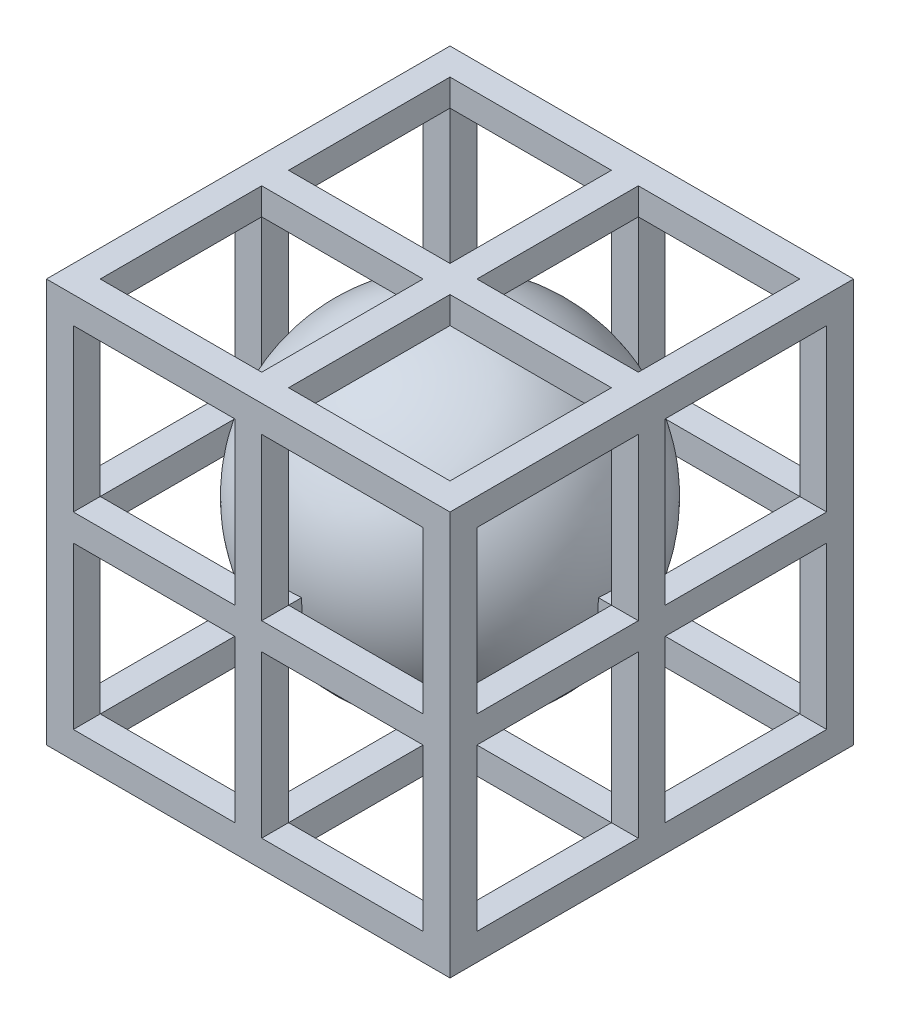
ISO-10303-21;
HEADER;
FILE_DESCRIPTION(('STEP AP214'),'2;1');
FILE_NAME('part.step','',(''),(''),'','','');
FILE_SCHEMA(('AUTOMOTIVE_DESIGN { 1 0 10303 214 1 1 1 1 }'));
ENDSEC;
DATA;
#1=APPLICATION_CONTEXT('core data for automotive mechanical design processes');
#2=APPLICATION_PROTOCOL_DEFINITION('international standard','automotive_design',2000,#1);
#3=PRODUCT_CONTEXT('',#1,'mechanical');
#4=PRODUCT('Part','Part','',(#3));
#5=PRODUCT_RELATED_PRODUCT_CATEGORY('part','',(#4));
#6=PRODUCT_DEFINITION_FORMATION('','',#4);
#7=PRODUCT_DEFINITION_CONTEXT('part definition',#1,'design');
#8=PRODUCT_DEFINITION('design','',#6,#7);
#9=PRODUCT_DEFINITION_SHAPE('','',#8);
#10=(LENGTH_UNIT() NAMED_UNIT(*) SI_UNIT(.MILLI.,.METRE.));
#11=(NAMED_UNIT(*) PLANE_ANGLE_UNIT() SI_UNIT($,.RADIAN.));
#12=(NAMED_UNIT(*) SI_UNIT($,.STERADIAN.) SOLID_ANGLE_UNIT());
#13=UNCERTAINTY_MEASURE_WITH_UNIT(LENGTH_MEASURE(1.E-05),#10,'distance_accuracy_value','');
#14=(GEOMETRIC_REPRESENTATION_CONTEXT(3) GLOBAL_UNCERTAINTY_ASSIGNED_CONTEXT((#13)) GLOBAL_UNIT_ASSIGNED_CONTEXT((#10,
#11,#12)) REPRESENTATION_CONTEXT('',''));
#15=CARTESIAN_POINT('',(0.,0.,0.));
#16=DIRECTION('',(0.,0.,1.));
#17=DIRECTION('',(1.,0.,0.));
#18=AXIS2_PLACEMENT_3D('',#15,#16,#17);
#19=CARTESIAN_POINT('',(11.2279649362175,30.,-26.289667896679));
#20=DIRECTION('',(-1.,0.,0.));
#21=DIRECTION('',(0.,0.,1.));
#22=AXIS2_PLACEMENT_3D('',#19,#20,#21);
#23=PLANE('',#22);
#24=CARTESIAN_POINT('',(11.2279649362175,16.,-13.289667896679));
#25=DIRECTION('',(-1.,0.,0.));
#26=DIRECTION('',(0.,0.,1.));
#27=AXIS2_PLACEMENT_3D('',#24,#25,#26);
#28=CIRCLE('',#27,12.0295751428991);
#29=CARTESIAN_POINT('',(11.2279649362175,14.,-1.42751471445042));
#30=VERTEX_POINT('',#29);
#31=CARTESIAN_POINT('',(11.2279649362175,16.,-1.26009275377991));
#32=VERTEX_POINT('',#31);
#33=EDGE_CURVE('E1604',#30,#32,#28,.T.);
#34=ORIENTED_EDGE('',*,*,#33,.F.);
#35=DIRECTION('',(0.,0.,-1.));
#36=VECTOR('',#35,1.);
#37=CARTESIAN_POINT('',(11.2279649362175,14.,-26.289667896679));
#38=LINE('',#37,#36);
#39=CARTESIAN_POINT('',(11.2279649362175,14.,-0.289667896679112));
#40=VERTEX_POINT('',#39);
#41=EDGE_CURVE('E1229',#40,#30,#38,.T.);
#42=ORIENTED_EDGE('',*,*,#41,.F.);
#43=DIRECTION('',(0.,-1.,0.));
#44=VECTOR('',#43,1.);
#45=CARTESIAN_POINT('',(11.2279649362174,30.,-0.289667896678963));
#46=LINE('',#45,#44);
#47=CARTESIAN_POINT('',(11.2279649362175,16.,-0.289667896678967));
#48=VERTEX_POINT('',#47);
#49=EDGE_CURVE('E899',#48,#40,#46,.T.);
#50=ORIENTED_EDGE('',*,*,#49,.F.);
#51=DIRECTION('',(0.,0.,1.));
#52=VECTOR('',#51,1.);
#53=CARTESIAN_POINT('',(11.2279649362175,16.,-26.289667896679));
#54=LINE('',#53,#52);
#55=EDGE_CURVE('E1287',#32,#48,#54,.T.);
#56=ORIENTED_EDGE('',*,*,#55,.F.);
#57=EDGE_LOOP('',(#34,#42,#50,#56));
#58=FACE_BOUND('',#57,.T.);
#59=ADVANCED_FACE('F34',(#58),#23,.T.);
#60=CARTESIAN_POINT('',(11.2279649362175,16.,-13.289667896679));
#61=DIRECTION('',(-1.,0.,0.));
#62=DIRECTION('',(0.,0.,1.));
#63=AXIS2_PLACEMENT_3D('',#60,#61,#62);
#64=CIRCLE('',#63,12.0295751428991);
#65=CARTESIAN_POINT('',(11.2279649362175,4.01206113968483,-14.2896678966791));
#66=VERTEX_POINT('',#65);
#67=CARTESIAN_POINT('',(11.2279649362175,4.01206113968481,-12.2896678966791));
#68=VERTEX_POINT('',#67);
#69=EDGE_CURVE('E1594',#66,#68,#64,.T.);
#70=ORIENTED_EDGE('',*,*,#69,.F.);
#71=DIRECTION('',(0.,1.,0.));
#72=VECTOR('',#71,1.);
#73=CARTESIAN_POINT('',(11.2279649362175,30.,-14.2896678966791));
#74=LINE('',#73,#72);
#75=CARTESIAN_POINT('',(11.2279649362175,2.,-14.289667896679));
#76=VERTEX_POINT('',#75);
#77=EDGE_CURVE('E1369',#76,#66,#74,.T.);
#78=ORIENTED_EDGE('',*,*,#77,.F.);
#79=DIRECTION('',(0.,0.,1.));
#80=VECTOR('',#79,1.);
#81=CARTESIAN_POINT('',(11.2279649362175,2.,-48.289667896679));
#82=LINE('',#81,#80);
#83=CARTESIAN_POINT('',(11.2279649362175,2.,-12.2896678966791));
#84=VERTEX_POINT('',#83);
#85=EDGE_CURVE('E1148',#76,#84,#82,.T.);
#86=ORIENTED_EDGE('',*,*,#85,.T.);
#87=DIRECTION('',(0.,-1.,0.));
#88=VECTOR('',#87,1.);
#89=CARTESIAN_POINT('',(11.2279649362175,30.,-12.2896678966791));
#90=LINE('',#89,#88);
#91=EDGE_CURVE('E1357',#68,#84,#90,.T.);
#92=ORIENTED_EDGE('',*,*,#91,.F.);
#93=EDGE_LOOP('',(#70,#78,#86,#92));
#94=FACE_BOUND('',#93,.T.);
#95=ADVANCED_FACE('F1781',(#94),#23,.T.);
#96=CARTESIAN_POINT('',(11.2279649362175,16.,-13.289667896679));
#97=DIRECTION('',(-1.,0.,0.));
#98=DIRECTION('',(0.,0.,1.));
#99=AXIS2_PLACEMENT_3D('',#96,#97,#98);
#100=CIRCLE('',#99,12.0295751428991);
#101=CARTESIAN_POINT('',(11.2279649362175,16.,-25.319243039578));
#102=VERTEX_POINT('',#101);
#103=CARTESIAN_POINT('',(11.2279649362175,14.,-25.1518210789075));
#104=VERTEX_POINT('',#103);
#105=EDGE_CURVE('E1584',#102,#104,#100,.T.);
#106=ORIENTED_EDGE('',*,*,#105,.F.);
#107=DIRECTION('',(0.,0.,1.));
#108=VECTOR('',#107,1.);
#109=CARTESIAN_POINT('',(11.2279649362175,16.,-26.289667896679));
#110=LINE('',#109,#108);
#111=CARTESIAN_POINT('',(11.2279649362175,16.,-26.289667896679));
#112=VERTEX_POINT('',#111);
#113=EDGE_CURVE('E1262',#112,#102,#110,.T.);
#114=ORIENTED_EDGE('',*,*,#113,.F.);
#115=DIRECTION('',(0.,-1.,0.));
#116=VECTOR('',#115,1.);
#117=CARTESIAN_POINT('',(11.2279649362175,30.,-26.289667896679));
#118=LINE('',#117,#116);
#119=CARTESIAN_POINT('',(11.2279649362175,14.,-26.2896678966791));
#120=VERTEX_POINT('',#119);
#121=EDGE_CURVE('E822',#112,#120,#118,.T.);
#122=ORIENTED_EDGE('',*,*,#121,.T.);
#123=DIRECTION('',(0.,0.,-1.));
#124=VECTOR('',#123,1.);
#125=CARTESIAN_POINT('',(11.2279649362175,14.,-26.289667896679));
#126=LINE('',#125,#124);
#127=EDGE_CURVE('E1244',#104,#120,#126,.T.);
#128=ORIENTED_EDGE('',*,*,#127,.F.);
#129=EDGE_LOOP('',(#106,#114,#122,#128));
#130=FACE_BOUND('',#129,.T.);
#131=ADVANCED_FACE('F1851',(#130),#23,.T.);
#132=CARTESIAN_POINT('',(13.2279649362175,30.,-12.289667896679));
#133=DIRECTION('',(1.,0.,0.));
#134=DIRECTION('',(0.,0.,-1.));
#135=AXIS2_PLACEMENT_3D('',#132,#133,#134);
#136=PLANE('',#135);
#137=CARTESIAN_POINT('',(13.2279649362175,16.,-13.289667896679));
#138=DIRECTION('',(1.,0.,0.));
#139=DIRECTION('',(0.,0.,-1.));
#140=AXIS2_PLACEMENT_3D('',#137,#138,#139);
#141=CIRCLE('',#140,12.0295751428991);
#142=CARTESIAN_POINT('',(13.2279649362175,16.,-1.26009275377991));
#143=VERTEX_POINT('',#142);
#144=CARTESIAN_POINT('',(13.2279649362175,14.,-1.42751471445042));
#145=VERTEX_POINT('',#144);
#146=EDGE_CURVE('E1606',#143,#145,#141,.T.);
#147=ORIENTED_EDGE('',*,*,#146,.F.);
#148=DIRECTION('',(0.,0.,-1.));
#149=VECTOR('',#148,1.);
#150=CARTESIAN_POINT('',(13.2279649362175,16.,-12.289667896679));
#151=LINE('',#150,#149);
#152=CARTESIAN_POINT('',(13.2279649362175,16.,-0.289667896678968));
#153=VERTEX_POINT('',#152);
#154=EDGE_CURVE('E762',#153,#143,#151,.T.);
#155=ORIENTED_EDGE('',*,*,#154,.F.);
#156=DIRECTION('',(0.,-1.,0.));
#157=VECTOR('',#156,1.);
#158=CARTESIAN_POINT('',(13.2279649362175,30.,-0.289667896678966));
#159=LINE('',#158,#157);
#160=CARTESIAN_POINT('',(13.2279649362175,14.,-0.289667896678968));
#161=VERTEX_POINT('',#160);
#162=EDGE_CURVE('E868',#153,#161,#159,.T.);
#163=ORIENTED_EDGE('',*,*,#162,.T.);
#164=DIRECTION('',(0.,0.,1.));
#165=VECTOR('',#164,1.);
#166=CARTESIAN_POINT('',(13.2279649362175,14.,-12.289667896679));
#167=LINE('',#166,#165);
#168=EDGE_CURVE('E746',#145,#161,#167,.T.);
#169=ORIENTED_EDGE('',*,*,#168,.F.);
#170=EDGE_LOOP('',(#147,#155,#163,#169));
#171=FACE_BOUND('',#170,.T.);
#172=ADVANCED_FACE('F2179',(#171),#136,.T.);
#173=CARTESIAN_POINT('',(13.2279649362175,16.,-13.289667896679));
#174=DIRECTION('',(1.,0.,0.));
#175=DIRECTION('',(0.,0.,-1.));
#176=AXIS2_PLACEMENT_3D('',#173,#174,#175);
#177=CIRCLE('',#176,12.0295751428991);
#178=CARTESIAN_POINT('',(13.2279649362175,4.01206113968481,-12.2896678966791));
#179=VERTEX_POINT('',#178);
#180=CARTESIAN_POINT('',(13.2279649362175,4.01206113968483,-14.2896678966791));
#181=VERTEX_POINT('',#180);
#182=EDGE_CURVE('E1596',#179,#181,#177,.T.);
#183=ORIENTED_EDGE('',*,*,#182,.F.);
#184=DIRECTION('',(0.,1.,0.));
#185=VECTOR('',#184,1.);
#186=CARTESIAN_POINT('',(13.2279649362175,30.,-12.2896678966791));
#187=LINE('',#186,#185);
#188=CARTESIAN_POINT('',(13.2279649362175,2.,-12.2896678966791));
#189=VERTEX_POINT('',#188);
#190=EDGE_CURVE('E1360',#189,#179,#187,.T.);
#191=ORIENTED_EDGE('',*,*,#190,.F.);
#192=DIRECTION('',(0.,0.,1.));
#193=VECTOR('',#192,1.);
#194=CARTESIAN_POINT('',(13.2279649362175,2.,-48.289667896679));
#195=LINE('',#194,#193);
#196=CARTESIAN_POINT('',(13.2279649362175,2.,-14.2896678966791));
#197=VERTEX_POINT('',#196);
#198=EDGE_CURVE('E1199',#197,#189,#195,.T.);
#199=ORIENTED_EDGE('',*,*,#198,.F.);
#200=DIRECTION('',(0.,-1.,0.));
#201=VECTOR('',#200,1.);
#202=CARTESIAN_POINT('',(13.2279649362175,30.,-14.2896678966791));
#203=LINE('',#202,#201);
#204=EDGE_CURVE('E1379',#181,#197,#203,.T.);
#205=ORIENTED_EDGE('',*,*,#204,.F.);
#206=EDGE_LOOP('',(#183,#191,#199,#205));
#207=FACE_BOUND('',#206,.T.);
#208=ADVANCED_FACE('F2569',(#207),#136,.T.);
#209=CARTESIAN_POINT('',(13.2279649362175,16.,-13.289667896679));
#210=DIRECTION('',(1.,0.,0.));
#211=DIRECTION('',(0.,0.,-1.));
#212=AXIS2_PLACEMENT_3D('',#209,#210,#211);
#213=CIRCLE('',#212,12.0295751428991);
#214=CARTESIAN_POINT('',(13.2279649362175,14.,-25.1518210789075));
#215=VERTEX_POINT('',#214);
#216=CARTESIAN_POINT('',(13.2279649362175,16.,-25.319243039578));
#217=VERTEX_POINT('',#216);
#218=EDGE_CURVE('E1586',#215,#217,#213,.T.);
#219=ORIENTED_EDGE('',*,*,#218,.F.);
#220=DIRECTION('',(0.,0.,1.));
#221=VECTOR('',#220,1.);
#222=CARTESIAN_POINT('',(13.2279649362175,14.,-12.289667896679));
#223=LINE('',#222,#221);
#224=CARTESIAN_POINT('',(13.2279649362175,14.,-26.2896678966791));
#225=VERTEX_POINT('',#224);
#226=EDGE_CURVE('E748',#225,#215,#223,.T.);
#227=ORIENTED_EDGE('',*,*,#226,.F.);
#228=DIRECTION('',(0.,-1.,0.));
#229=VECTOR('',#228,1.);
#230=CARTESIAN_POINT('',(13.2279649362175,30.,-26.289667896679));
#231=LINE('',#230,#229);
#232=CARTESIAN_POINT('',(13.2279649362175,16.,-26.289667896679));
#233=VERTEX_POINT('',#232);
#234=EDGE_CURVE('E935',#233,#225,#231,.T.);
#235=ORIENTED_EDGE('',*,*,#234,.F.);
#236=DIRECTION('',(0.,0.,-1.));
#237=VECTOR('',#236,1.);
#238=CARTESIAN_POINT('',(13.2279649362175,16.,-12.289667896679));
#239=LINE('',#238,#237);
#240=EDGE_CURVE('E759',#217,#233,#239,.T.);
#241=ORIENTED_EDGE('',*,*,#240,.F.);
#242=EDGE_LOOP('',(#219,#227,#235,#241));
#243=FACE_BOUND('',#242,.T.);
#244=ADVANCED_FACE('F2068',(#243),#136,.T.);
#245=CARTESIAN_POINT('',(11.2279649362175,30.,-14.289667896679));
#246=DIRECTION('',(0.,0.,-1.));
#247=DIRECTION('',(-1.,0.,0.));
#248=AXIS2_PLACEMENT_3D('',#245,#246,#247);
#249=PLANE('',#248);
#250=CARTESIAN_POINT('',(12.2279649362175,16.,-14.289667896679));
#251=DIRECTION('',(0.,0.,-1.));
#252=DIRECTION('',(-1.,0.,0.));
#253=AXIS2_PLACEMENT_3D('',#250,#251,#252);
#254=CIRCLE('',#253,12.0295751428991);
#255=CARTESIAN_POINT('',(0.36581175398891,14.,-14.289667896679));
#256=VERTEX_POINT('',#255);
#257=CARTESIAN_POINT('',(0.198389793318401,16.,-14.289667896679));
#258=VERTEX_POINT('',#257);
#259=EDGE_CURVE('E1548',#256,#258,#254,.T.);
#260=ORIENTED_EDGE('',*,*,#259,.F.);
#261=DIRECTION('',(1.,0.,0.));
#262=VECTOR('',#261,1.);
#263=CARTESIAN_POINT('',(11.2279649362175,14.,-14.289667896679));
#264=LINE('',#263,#262);
#265=CARTESIAN_POINT('',(-0.772035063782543,14.,-14.289667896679));
#266=VERTEX_POINT('',#265);
#267=EDGE_CURVE('E979',#266,#256,#264,.T.);
#268=ORIENTED_EDGE('',*,*,#267,.F.);
#269=DIRECTION('',(0.,-1.,0.));
#270=VECTOR('',#269,1.);
#271=CARTESIAN_POINT('',(-0.772035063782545,30.,-14.289667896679));
#272=LINE('',#271,#270);
#273=CARTESIAN_POINT('',(-0.772035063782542,16.,-14.289667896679));
#274=VERTEX_POINT('',#273);
#275=EDGE_CURVE('E812',#274,#266,#272,.T.);
#276=ORIENTED_EDGE('',*,*,#275,.F.);
#277=DIRECTION('',(-1.,0.,0.));
#278=VECTOR('',#277,1.);
#279=CARTESIAN_POINT('',(11.2279649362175,16.,-14.289667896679));
#280=LINE('',#279,#278);
#281=EDGE_CURVE('E1028',#258,#274,#280,.T.);
#282=ORIENTED_EDGE('',*,*,#281,.F.);
#283=EDGE_LOOP('',(#260,#268,#276,#282));
#284=FACE_BOUND('',#283,.T.);
#285=ADVANCED_FACE('F1737',(#284),#249,.T.);
#286=CARTESIAN_POINT('',(25.2279649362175,30.,-12.289667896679));
#287=DIRECTION('',(0.,0.,1.));
#288=DIRECTION('',(1.,0.,0.));
#289=AXIS2_PLACEMENT_3D('',#286,#287,#288);
#290=PLANE('',#289);
#291=CARTESIAN_POINT('',(12.2279649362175,16.,-12.289667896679));
#292=DIRECTION('',(0.,0.,1.));
#293=DIRECTION('',(1.,0.,0.));
#294=AXIS2_PLACEMENT_3D('',#291,#292,#293);
#295=CIRCLE('',#294,12.0295751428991);
#296=CARTESIAN_POINT('',(24.090118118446,14.,-12.289667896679));
#297=VERTEX_POINT('',#296);
#298=CARTESIAN_POINT('',(24.2575400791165,16.,-12.289667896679));
#299=VERTEX_POINT('',#298);
#300=EDGE_CURVE('E58',#297,#299,#295,.T.);
#301=ORIENTED_EDGE('',*,*,#300,.F.);
#302=DIRECTION('',(-1.,0.,0.));
#303=VECTOR('',#302,1.);
#304=CARTESIAN_POINT('',(25.2279649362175,14.,-12.289667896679));
#305=LINE('',#304,#303);
#306=CARTESIAN_POINT('',(25.2279649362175,14.,-12.2896678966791));
#307=VERTEX_POINT('',#306);
#308=EDGE_CURVE('E1085',#307,#297,#305,.T.);
#309=ORIENTED_EDGE('',*,*,#308,.F.);
#310=DIRECTION('',(0.,-1.,0.));
#311=VECTOR('',#310,1.);
#312=CARTESIAN_POINT('',(25.2279649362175,30.,-12.289667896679));
#313=LINE('',#312,#311);
#314=CARTESIAN_POINT('',(25.2279649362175,16.,-12.289667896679));
#315=VERTEX_POINT('',#314);
#316=EDGE_CURVE('E858',#315,#307,#313,.T.);
#317=ORIENTED_EDGE('',*,*,#316,.F.);
#318=DIRECTION('',(1.,0.,0.));
#319=VECTOR('',#318,1.);
#320=CARTESIAN_POINT('',(25.2279649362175,16.,-12.289667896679));
#321=LINE('',#320,#319);
#322=EDGE_CURVE('E1071',#299,#315,#321,.T.);
#323=ORIENTED_EDGE('',*,*,#322,.F.);
#324=EDGE_LOOP('',(#301,#309,#317,#323));
#325=FACE_BOUND('',#324,.T.);
#326=ADVANCED_FACE('F1992',(#325),#290,.T.);
#327=CARTESIAN_POINT('',(11.2279649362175,30.,-12.289667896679));
#328=DIRECTION('',(0.,0.,1.));
#329=DIRECTION('',(1.,0.,0.));
#330=AXIS2_PLACEMENT_3D('',#327,#328,#329);
#331=PLANE('',#330);
#332=CARTESIAN_POINT('',(12.2279649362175,16.,-12.289667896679));
#333=DIRECTION('',(0.,0.,1.));
#334=DIRECTION('',(1.,0.,0.));
#335=AXIS2_PLACEMENT_3D('',#332,#333,#334);
#336=CIRCLE('',#335,12.0295751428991);
#337=CARTESIAN_POINT('',(0.198389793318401,16.,-12.289667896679));
#338=VERTEX_POINT('',#337);
#339=CARTESIAN_POINT('',(0.36581175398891,14.,-12.289667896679));
#340=VERTEX_POINT('',#339);
#341=EDGE_CURVE('E1550',#338,#340,#336,.T.);
#342=ORIENTED_EDGE('',*,*,#341,.F.);
#343=DIRECTION('',(1.,0.,0.));
#344=VECTOR('',#343,1.);
#345=CARTESIAN_POINT('',(11.2279649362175,16.,-12.289667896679));
#346=LINE('',#345,#344);
#347=CARTESIAN_POINT('',(-0.772035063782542,16.,-12.289667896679));
#348=VERTEX_POINT('',#347);
#349=EDGE_CURVE('E775',#348,#338,#346,.T.);
#350=ORIENTED_EDGE('',*,*,#349,.F.);
#351=DIRECTION('',(0.,-1.,0.));
#352=VECTOR('',#351,1.);
#353=CARTESIAN_POINT('',(-0.772035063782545,30.,-12.289667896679));
#354=LINE('',#353,#352);
#355=CARTESIAN_POINT('',(-0.772035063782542,14.,-12.2896678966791));
#356=VERTEX_POINT('',#355);
#357=EDGE_CURVE('E909',#348,#356,#354,.T.);
#358=ORIENTED_EDGE('',*,*,#357,.T.);
#359=DIRECTION('',(-1.,0.,0.));
#360=VECTOR('',#359,1.);
#361=CARTESIAN_POINT('',(11.2279649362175,14.,-12.289667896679));
#362=LINE('',#361,#360);
#363=EDGE_CURVE('E768',#340,#356,#362,.T.);
#364=ORIENTED_EDGE('',*,*,#363,.F.);
#365=EDGE_LOOP('',(#342,#350,#358,#364));
#366=FACE_BOUND('',#365,.T.);
#367=ADVANCED_FACE('F1974',(#366),#331,.T.);
#368=CARTESIAN_POINT('',(25.2279649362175,30.,-14.289667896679));
#369=DIRECTION('',(0.,0.,-1.));
#370=DIRECTION('',(-1.,0.,0.));
#371=AXIS2_PLACEMENT_3D('',#368,#369,#370);
#372=PLANE('',#371);
#373=CARTESIAN_POINT('',(12.2279649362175,16.,-14.289667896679));
#374=DIRECTION('',(0.,0.,-1.));
#375=DIRECTION('',(-1.,0.,0.));
#376=AXIS2_PLACEMENT_3D('',#373,#374,#375);
#377=CIRCLE('',#376,12.0295751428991);
#378=CARTESIAN_POINT('',(24.2575400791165,16.,-14.289667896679));
#379=VERTEX_POINT('',#378);
#380=CARTESIAN_POINT('',(24.090118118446,14.,-14.289667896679));
#381=VERTEX_POINT('',#380);
#382=EDGE_CURVE('E1541',#379,#381,#377,.T.);
#383=ORIENTED_EDGE('',*,*,#382,.F.);
#384=DIRECTION('',(-1.,0.,0.));
#385=VECTOR('',#384,1.);
#386=CARTESIAN_POINT('',(25.2279649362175,16.,-14.289667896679));
#387=LINE('',#386,#385);
#388=CARTESIAN_POINT('',(25.2279649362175,16.,-14.289667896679));
#389=VERTEX_POINT('',#388);
#390=EDGE_CURVE('E1075',#389,#379,#387,.T.);
#391=ORIENTED_EDGE('',*,*,#390,.F.);
#392=DIRECTION('',(0.,-1.,0.));
#393=VECTOR('',#392,1.);
#394=CARTESIAN_POINT('',(25.2279649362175,30.,-14.289667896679));
#395=LINE('',#394,#393);
#396=CARTESIAN_POINT('',(25.2279649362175,14.,-14.2896678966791));
#397=VERTEX_POINT('',#396);
#398=EDGE_CURVE('E945',#389,#397,#395,.T.);
#399=ORIENTED_EDGE('',*,*,#398,.T.);
#400=DIRECTION('',(1.,0.,0.));
#401=VECTOR('',#400,1.);
#402=CARTESIAN_POINT('',(25.2279649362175,14.,-14.289667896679));
#403=LINE('',#402,#401);
#404=EDGE_CURVE('E1095',#381,#397,#403,.T.);
#405=ORIENTED_EDGE('',*,*,#404,.F.);
#406=EDGE_LOOP('',(#383,#391,#399,#405));
#407=FACE_BOUND('',#406,.T.);
#408=ADVANCED_FACE('F2044',(#407),#372,.T.);
#409=CARTESIAN_POINT('',(11.2279649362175,16.,-13.289667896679));
#410=DIRECTION('',(-1.,0.,0.));
#411=DIRECTION('',(0.,0.,1.));
#412=AXIS2_PLACEMENT_3D('',#409,#410,#411);
#413=CIRCLE('',#412,12.0295751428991);
#414=CARTESIAN_POINT('',(11.2279649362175,27.9879388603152,-12.289667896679));
#415=VERTEX_POINT('',#414);
#416=CARTESIAN_POINT('',(11.2279649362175,28.,-12.4466506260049));
#417=VERTEX_POINT('',#416);
#418=EDGE_CURVE('E1562',#415,#417,#413,.T.);
#419=ORIENTED_EDGE('',*,*,#418,.F.);
#420=DIRECTION('',(0.,-1.,0.));
#421=VECTOR('',#420,1.);
#422=CARTESIAN_POINT('',(11.2279649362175,30.,-12.289667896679));
#423=LINE('',#422,#421);
#424=CARTESIAN_POINT('',(11.2279649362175,28.,-12.289667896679));
#425=VERTEX_POINT('',#424);
#426=EDGE_CURVE('E1337',#425,#415,#423,.T.);
#427=ORIENTED_EDGE('',*,*,#426,.F.);
#428=DIRECTION('',(0.,0.,1.));
#429=VECTOR('',#428,1.);
#430=CARTESIAN_POINT('',(11.2279649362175,28.,-48.289667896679));
#431=LINE('',#430,#429);
#432=EDGE_CURVE('E1124',#417,#425,#431,.T.);
#433=ORIENTED_EDGE('',*,*,#432,.F.);
#434=EDGE_LOOP('',(#419,#427,#433));
#435=FACE_BOUND('',#434,.T.);
#436=ADVANCED_FACE('F2551',(#435),#23,.T.);
#437=CARTESIAN_POINT('',(11.2279649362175,28.,-14.132685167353));
#438=VERTEX_POINT('',#437);
#439=CARTESIAN_POINT('',(11.2279649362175,27.9879388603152,-14.289667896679));
#440=VERTEX_POINT('',#439);
#441=EDGE_CURVE('E1570',#438,#440,#413,.T.);
#442=ORIENTED_EDGE('',*,*,#441,.F.);
#443=CARTESIAN_POINT('',(11.2279649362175,28.,-14.289667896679));
#444=VERTEX_POINT('',#443);
#445=EDGE_CURVE('E1951',#444,#438,#431,.T.);
#446=ORIENTED_EDGE('',*,*,#445,.F.);
#447=DIRECTION('',(0.,1.,0.));
#448=VECTOR('',#447,1.);
#449=CARTESIAN_POINT('',(11.2279649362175,30.,-14.289667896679));
#450=LINE('',#449,#448);
#451=EDGE_CURVE('E1325',#440,#444,#450,.T.);
#452=ORIENTED_EDGE('',*,*,#451,.F.);
#453=EDGE_LOOP('',(#442,#446,#452));
#454=FACE_BOUND('',#453,.T.);
#455=ADVANCED_FACE('F1955',(#454),#23,.T.);
#456=CARTESIAN_POINT('',(13.2279649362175,16.,-13.289667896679));
#457=DIRECTION('',(1.,0.,0.));
#458=DIRECTION('',(0.,0.,-1.));
#459=AXIS2_PLACEMENT_3D('',#456,#457,#458);
#460=CIRCLE('',#459,12.0295751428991);
#461=CARTESIAN_POINT('',(13.2279649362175,27.9879388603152,-14.289667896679));
#462=VERTEX_POINT('',#461);
#463=CARTESIAN_POINT('',(13.2279649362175,28.,-14.132685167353));
#464=VERTEX_POINT('',#463);
#465=EDGE_CURVE('E1572',#462,#464,#460,.T.);
#466=ORIENTED_EDGE('',*,*,#465,.F.);
#467=DIRECTION('',(0.,-1.,0.));
#468=VECTOR('',#467,1.);
#469=CARTESIAN_POINT('',(13.2279649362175,30.,-14.289667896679));
#470=LINE('',#469,#468);
#471=CARTESIAN_POINT('',(13.2279649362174,28.,-14.289667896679));
#472=VERTEX_POINT('',#471);
#473=EDGE_CURVE('E1328',#472,#462,#470,.T.);
#474=ORIENTED_EDGE('',*,*,#473,.F.);
#475=DIRECTION('',(0.,0.,1.));
#476=VECTOR('',#475,1.);
#477=CARTESIAN_POINT('',(13.2279649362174,28.,-48.289667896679));
#478=LINE('',#477,#476);
#479=EDGE_CURVE('E2355',#472,#464,#478,.T.);
#480=ORIENTED_EDGE('',*,*,#479,.T.);
#481=EDGE_LOOP('',(#466,#474,#480));
#482=FACE_BOUND('',#481,.T.);
#483=ADVANCED_FACE('F2553',(#482),#136,.T.);
#484=CARTESIAN_POINT('',(13.2279649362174,28.,-12.4466506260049));
#485=VERTEX_POINT('',#484);
#486=CARTESIAN_POINT('',(13.2279649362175,27.9879388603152,-12.289667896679));
#487=VERTEX_POINT('',#486);
#488=EDGE_CURVE('E1566',#485,#487,#460,.T.);
#489=ORIENTED_EDGE('',*,*,#488,.F.);
#490=CARTESIAN_POINT('',(13.2279649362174,28.,-12.289667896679));
#491=VERTEX_POINT('',#490);
#492=EDGE_CURVE('E1185',#485,#491,#478,.T.);
#493=ORIENTED_EDGE('',*,*,#492,.T.);
#494=DIRECTION('',(0.,1.,0.));
#495=VECTOR('',#494,1.);
#496=CARTESIAN_POINT('',(13.2279649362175,30.,-12.289667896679));
#497=LINE('',#496,#495);
#498=EDGE_CURVE('E1347',#487,#491,#497,.T.);
#499=ORIENTED_EDGE('',*,*,#498,.F.);
#500=EDGE_LOOP('',(#489,#493,#499));
#501=FACE_BOUND('',#500,.T.);
#502=ADVANCED_FACE('F2354',(#501),#136,.T.);
#503=CARTESIAN_POINT('',(13.2279649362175,14.,-48.289667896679));
#504=DIRECTION('',(0.,1.,0.));
#505=DIRECTION('',(0.,0.,1.));
#506=AXIS2_PLACEMENT_3D('',#503,#504,#505);
#507=PLANE('',#506);
#508=ORIENTED_EDGE('',*,*,#308,.T.);
#509=CARTESIAN_POINT('',(12.2279649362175,14.,-13.289667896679));
#510=DIRECTION('',(0.,1.,0.));
#511=DIRECTION('',(0.,0.,1.));
#512=AXIS2_PLACEMENT_3D('',#509,#510,#511);
#513=CIRCLE('',#512,11.9042294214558);
#514=EDGE_CURVE('E1482',#297,#381,#513,.T.);
#515=ORIENTED_EDGE('',*,*,#514,.T.);
#516=ORIENTED_EDGE('',*,*,#404,.T.);
#517=DIRECTION('',(0.,0.,1.));
#518=VECTOR('',#517,1.);
#519=CARTESIAN_POINT('',(25.2279649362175,14.,-48.289667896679));
#520=LINE('',#519,#518);
#521=EDGE_CURVE('E1208',#397,#307,#520,.T.);
#522=ORIENTED_EDGE('',*,*,#521,.T.);
#523=EDGE_LOOP('',(#508,#515,#516,#522));
#524=FACE_BOUND('',#523,.T.);
#525=ADVANCED_FACE('F1996',(#524),#507,.F.);
#526=CARTESIAN_POINT('',(13.2279649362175,16.,-48.289667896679));
#527=DIRECTION('',(0.,-1.,0.));
#528=DIRECTION('',(0.,0.,-1.));
#529=AXIS2_PLACEMENT_3D('',#526,#527,#528);
#530=PLANE('',#529);
#531=ORIENTED_EDGE('',*,*,#390,.T.);
#532=CARTESIAN_POINT('',(12.2279649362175,16.,-13.289667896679));
#533=DIRECTION('',(0.,-1.,0.));
#534=DIRECTION('',(0.,0.,-1.));
#535=AXIS2_PLACEMENT_3D('',#532,#533,#534);
#536=CIRCLE('',#535,12.0710678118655);
#537=EDGE_CURVE('E1543',#379,#299,#536,.T.);
#538=ORIENTED_EDGE('',*,*,#537,.T.);
#539=ORIENTED_EDGE('',*,*,#322,.T.);
#540=DIRECTION('',(0.,0.,1.));
#541=VECTOR('',#540,1.);
#542=CARTESIAN_POINT('',(25.2279649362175,16.,-48.289667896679));
#543=LINE('',#542,#541);
#544=EDGE_CURVE('E1177',#389,#315,#543,.T.);
#545=ORIENTED_EDGE('',*,*,#544,.F.);
#546=EDGE_LOOP('',(#531,#538,#539,#545));
#547=FACE_BOUND('',#546,.T.);
#548=ADVANCED_FACE('F2047',(#547),#530,.F.);
#549=CARTESIAN_POINT('',(-0.772035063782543,16.,-48.289667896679));
#550=DIRECTION('',(0.,-1.,0.));
#551=DIRECTION('',(0.,0.,-1.));
#552=AXIS2_PLACEMENT_3D('',#549,#550,#551);
#553=PLANE('',#552);
#554=ORIENTED_EDGE('',*,*,#349,.T.);
#555=CARTESIAN_POINT('',(12.2279649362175,16.,-13.289667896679));
#556=DIRECTION('',(0.,-1.,0.));
#557=DIRECTION('',(0.,0.,-1.));
#558=AXIS2_PLACEMENT_3D('',#555,#556,#557);
#559=CIRCLE('',#558,12.0710678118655);
#560=EDGE_CURVE('E1545',#338,#258,#559,.T.);
#561=ORIENTED_EDGE('',*,*,#560,.T.);
#562=ORIENTED_EDGE('',*,*,#281,.T.);
#563=DIRECTION('',(0.,0.,1.));
#564=VECTOR('',#563,1.);
#565=CARTESIAN_POINT('',(-0.772035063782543,16.,-48.289667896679));
#566=LINE('',#565,#564);
#567=EDGE_CURVE('E1115',#274,#348,#566,.T.);
#568=ORIENTED_EDGE('',*,*,#567,.T.);
#569=EDGE_LOOP('',(#554,#561,#562,#568));
#570=FACE_BOUND('',#569,.T.);
#571=ADVANCED_FACE('F1971',(#570),#553,.F.);
#572=CARTESIAN_POINT('',(-0.772035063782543,14.,-48.289667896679));
#573=DIRECTION('',(0.,1.,0.));
#574=DIRECTION('',(0.,0.,1.));
#575=AXIS2_PLACEMENT_3D('',#572,#573,#574);
#576=PLANE('',#575);
#577=ORIENTED_EDGE('',*,*,#267,.T.);
#578=CARTESIAN_POINT('',(12.2279649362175,14.,-13.289667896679));
#579=DIRECTION('',(0.,1.,0.));
#580=DIRECTION('',(0.,0.,1.));
#581=AXIS2_PLACEMENT_3D('',#578,#579,#580);
#582=CIRCLE('',#581,11.9042294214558);
#583=EDGE_CURVE('E1552',#256,#340,#582,.T.);
#584=ORIENTED_EDGE('',*,*,#583,.T.);
#585=ORIENTED_EDGE('',*,*,#363,.T.);
#586=DIRECTION('',(0.,0.,1.));
#587=VECTOR('',#586,1.);
#588=CARTESIAN_POINT('',(-0.772035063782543,14.,-48.289667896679));
#589=LINE('',#588,#587);
#590=EDGE_CURVE('E1156',#266,#356,#589,.T.);
#591=ORIENTED_EDGE('',*,*,#590,.F.);
#592=EDGE_LOOP('',(#577,#584,#585,#591));
#593=FACE_BOUND('',#592,.T.);
#594=ADVANCED_FACE('F1740',(#593),#576,.F.);
#595=CARTESIAN_POINT('',(-22.7720350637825,16.,-0.289667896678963));
#596=DIRECTION('',(0.,-1.,0.));
#597=DIRECTION('',(0.,0.,-1.));
#598=AXIS2_PLACEMENT_3D('',#595,#596,#597);
#599=PLANE('',#598);
#600=ORIENTED_EDGE('',*,*,#154,.T.);
#601=CARTESIAN_POINT('',(12.2279649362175,16.,-13.289667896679));
#602=DIRECTION('',(0.,-1.,0.));
#603=DIRECTION('',(0.,0.,-1.));
#604=AXIS2_PLACEMENT_3D('',#601,#602,#603);
#605=CIRCLE('',#604,12.0710678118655);
#606=EDGE_CURVE('E1601',#143,#32,#605,.T.);
#607=ORIENTED_EDGE('',*,*,#606,.T.);
#608=ORIENTED_EDGE('',*,*,#55,.T.);
#609=DIRECTION('',(1.,0.,0.));
#610=VECTOR('',#609,1.);
#611=CARTESIAN_POINT('',(-22.7720350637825,16.,-0.289667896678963));
#612=LINE('',#611,#610);
#613=EDGE_CURVE('E1430',#48,#153,#612,.T.);
#614=ORIENTED_EDGE('',*,*,#613,.T.);
#615=EDGE_LOOP('',(#600,#607,#608,#614));
#616=FACE_BOUND('',#615,.T.);
#617=ADVANCED_FACE('F2181',(#616),#599,.F.);
#618=CARTESIAN_POINT('',(-22.7720350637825,28.,-12.289667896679));
#619=DIRECTION('',(0.,0.,-1.));
#620=DIRECTION('',(0.,1.,0.));
#621=AXIS2_PLACEMENT_3D('',#618,#619,#620);
#622=PLANE('',#621);
#623=DIRECTION('',(1.,0.,0.));
#624=VECTOR('',#623,1.);
#625=CARTESIAN_POINT('',(-22.7720350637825,28.,-12.289667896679));
#626=LINE('',#625,#624);
#627=CARTESIAN_POINT('',(13.0709822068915,28.,-12.289667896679));
#628=VERTEX_POINT('',#627);
#629=EDGE_CURVE('E1439',#628,#491,#626,.T.);
#630=ORIENTED_EDGE('',*,*,#629,.F.);
#631=CARTESIAN_POINT('',(12.2279649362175,16.,-12.289667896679));
#632=DIRECTION('',(0.,0.,-1.));
#633=DIRECTION('',(0.,1.,0.));
#634=AXIS2_PLACEMENT_3D('',#631,#632,#633);
#635=CIRCLE('',#634,12.0295751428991);
#636=EDGE_CURVE('E1558',#628,#487,#635,.T.);
#637=ORIENTED_EDGE('',*,*,#636,.T.);
#638=ORIENTED_EDGE('',*,*,#498,.T.);
#639=EDGE_LOOP('',(#630,#637,#638));
#640=FACE_BOUND('',#639,.T.);
#641=ADVANCED_FACE('F2350',(#640),#622,.F.);
#642=ORIENTED_EDGE('',*,*,#426,.T.);
#643=CARTESIAN_POINT('',(11.3849476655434,28.,-12.289667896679));
#644=VERTEX_POINT('',#643);
#645=EDGE_CURVE('E1559',#415,#644,#635,.T.);
#646=ORIENTED_EDGE('',*,*,#645,.T.);
#647=EDGE_CURVE('E2344',#425,#644,#626,.T.);
#648=ORIENTED_EDGE('',*,*,#647,.F.);
#649=EDGE_LOOP('',(#642,#646,#648));
#650=FACE_BOUND('',#649,.T.);
#651=ADVANCED_FACE('F2533',(#650),#622,.F.);
#652=CARTESIAN_POINT('',(-22.7720350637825,28.,-14.289667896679));
#653=DIRECTION('',(0.,0.,1.));
#654=DIRECTION('',(0.,-1.,0.));
#655=AXIS2_PLACEMENT_3D('',#652,#653,#654);
#656=PLANE('',#655);
#657=ORIENTED_EDGE('',*,*,#473,.T.);
#658=CARTESIAN_POINT('',(12.2279649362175,16.,-14.289667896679));
#659=DIRECTION('',(0.,0.,1.));
#660=DIRECTION('',(0.,-1.,0.));
#661=AXIS2_PLACEMENT_3D('',#658,#659,#660);
#662=CIRCLE('',#661,12.0295751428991);
#663=CARTESIAN_POINT('',(13.0709822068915,28.,-14.289667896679));
#664=VERTEX_POINT('',#663);
#665=EDGE_CURVE('E1574',#462,#664,#662,.T.);
#666=ORIENTED_EDGE('',*,*,#665,.T.);
#667=DIRECTION('',(1.,0.,0.));
#668=VECTOR('',#667,1.);
#669=CARTESIAN_POINT('',(-22.7720350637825,28.,-14.289667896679));
#670=LINE('',#669,#668);
#671=EDGE_CURVE('E1514',#664,#472,#670,.T.);
#672=ORIENTED_EDGE('',*,*,#671,.T.);
#673=EDGE_LOOP('',(#657,#666,#672));
#674=FACE_BOUND('',#673,.T.);
#675=ADVANCED_FACE('F2412',(#674),#656,.F.);
#676=CARTESIAN_POINT('',(11.3849476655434,28.,-14.289667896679));
#677=VERTEX_POINT('',#676);
#678=EDGE_CURVE('E2450',#444,#677,#670,.T.);
#679=ORIENTED_EDGE('',*,*,#678,.T.);
#680=EDGE_CURVE('E1575',#677,#440,#662,.T.);
#681=ORIENTED_EDGE('',*,*,#680,.T.);
#682=ORIENTED_EDGE('',*,*,#451,.T.);
#683=EDGE_LOOP('',(#679,#681,#682));
#684=FACE_BOUND('',#683,.T.);
#685=ADVANCED_FACE('F2416',(#684),#656,.F.);
#686=CARTESIAN_POINT('',(-22.7720350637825,16.,-14.289667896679));
#687=DIRECTION('',(0.,-1.,0.));
#688=DIRECTION('',(0.,0.,-1.));
#689=AXIS2_PLACEMENT_3D('',#686,#687,#688);
#690=PLANE('',#689);
#691=ORIENTED_EDGE('',*,*,#113,.T.);
#692=CARTESIAN_POINT('',(12.2279649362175,16.,-13.289667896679));
#693=DIRECTION('',(0.,-1.,0.));
#694=DIRECTION('',(0.,0.,-1.));
#695=AXIS2_PLACEMENT_3D('',#692,#693,#694);
#696=CIRCLE('',#695,12.0710678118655);
#697=EDGE_CURVE('E1581',#102,#217,#696,.T.);
#698=ORIENTED_EDGE('',*,*,#697,.T.);
#699=ORIENTED_EDGE('',*,*,#240,.T.);
#700=DIRECTION('',(1.,0.,0.));
#701=VECTOR('',#700,1.);
#702=CARTESIAN_POINT('',(-22.7720350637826,16.,-26.289667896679));
#703=LINE('',#702,#701);
#704=EDGE_CURVE('E1523',#112,#233,#703,.T.);
#705=ORIENTED_EDGE('',*,*,#704,.F.);
#706=EDGE_LOOP('',(#691,#698,#699,#705));
#707=FACE_BOUND('',#706,.T.);
#708=ADVANCED_FACE('F2402',(#707),#690,.F.);
#709=CARTESIAN_POINT('',(-22.7720350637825,14.,-14.2896678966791));
#710=DIRECTION('',(0.,0.,1.));
#711=DIRECTION('',(0.,-1.,0.));
#712=AXIS2_PLACEMENT_3D('',#709,#710,#711);
#713=PLANE('',#712);
#714=ORIENTED_EDGE('',*,*,#77,.T.);
#715=CARTESIAN_POINT('',(12.2279649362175,16.,-14.2896678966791));
#716=DIRECTION('',(0.,0.,1.));
#717=DIRECTION('',(0.,-1.,0.));
#718=AXIS2_PLACEMENT_3D('',#715,#716,#717);
#719=CIRCLE('',#718,12.029575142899);
#720=EDGE_CURVE('E1591',#66,#181,#719,.T.);
#721=ORIENTED_EDGE('',*,*,#720,.T.);
#722=ORIENTED_EDGE('',*,*,#204,.T.);
#723=DIRECTION('',(1.,0.,0.));
#724=VECTOR('',#723,1.);
#725=CARTESIAN_POINT('',(-22.7720350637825,2.,-14.2896678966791));
#726=LINE('',#725,#724);
#727=EDGE_CURVE('E1491',#76,#197,#726,.T.);
#728=ORIENTED_EDGE('',*,*,#727,.F.);
#729=EDGE_LOOP('',(#714,#721,#722,#728));
#730=FACE_BOUND('',#729,.T.);
#731=ADVANCED_FACE('F2415',(#730),#713,.F.);
#732=CARTESIAN_POINT('',(-22.7720350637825,14.,-14.2896678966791));
#733=DIRECTION('',(0.,1.,0.));
#734=DIRECTION('',(0.,0.,1.));
#735=AXIS2_PLACEMENT_3D('',#732,#733,#734);
#736=PLANE('',#735);
#737=ORIENTED_EDGE('',*,*,#226,.T.);
#738=CARTESIAN_POINT('',(12.2279649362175,14.,-13.289667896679));
#739=DIRECTION('',(0.,1.,0.));
#740=DIRECTION('',(0.,0.,1.));
#741=AXIS2_PLACEMENT_3D('',#738,#739,#740);
#742=CIRCLE('',#741,11.9042294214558);
#743=EDGE_CURVE('E1588',#215,#104,#742,.T.);
#744=ORIENTED_EDGE('',*,*,#743,.T.);
#745=ORIENTED_EDGE('',*,*,#127,.T.);
#746=DIRECTION('',(1.,0.,0.));
#747=VECTOR('',#746,1.);
#748=CARTESIAN_POINT('',(-22.7720350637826,14.,-26.2896678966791));
#749=LINE('',#748,#747);
#750=EDGE_CURVE('E1499',#120,#225,#749,.T.);
#751=ORIENTED_EDGE('',*,*,#750,.T.);
#752=EDGE_LOOP('',(#737,#744,#745,#751));
#753=FACE_BOUND('',#752,.T.);
#754=ADVANCED_FACE('F2071',(#753),#736,.F.);
#755=CARTESIAN_POINT('',(-22.7720350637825,14.,-12.2896678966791));
#756=DIRECTION('',(0.,0.,-1.));
#757=DIRECTION('',(0.,1.,0.));
#758=AXIS2_PLACEMENT_3D('',#755,#756,#757);
#759=PLANE('',#758);
#760=ORIENTED_EDGE('',*,*,#190,.T.);
#761=CARTESIAN_POINT('',(12.2279649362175,16.,-12.2896678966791));
#762=DIRECTION('',(0.,0.,-1.));
#763=DIRECTION('',(0.,1.,0.));
#764=AXIS2_PLACEMENT_3D('',#761,#762,#763);
#765=CIRCLE('',#764,12.0295751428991);
#766=EDGE_CURVE('E1598',#179,#68,#765,.T.);
#767=ORIENTED_EDGE('',*,*,#766,.T.);
#768=ORIENTED_EDGE('',*,*,#91,.T.);
#769=DIRECTION('',(1.,0.,0.));
#770=VECTOR('',#769,1.);
#771=CARTESIAN_POINT('',(-22.7720350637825,2.,-12.2896678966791));
#772=LINE('',#771,#770);
#773=EDGE_CURVE('E1467',#84,#189,#772,.T.);
#774=ORIENTED_EDGE('',*,*,#773,.T.);
#775=EDGE_LOOP('',(#760,#767,#768,#774));
#776=FACE_BOUND('',#775,.T.);
#777=ADVANCED_FACE('F2255',(#776),#759,.F.);
#778=CARTESIAN_POINT('',(-22.7720350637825,14.,-0.289667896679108));
#779=DIRECTION('',(0.,1.,0.));
#780=DIRECTION('',(0.,0.,1.));
#781=AXIS2_PLACEMENT_3D('',#778,#779,#780);
#782=PLANE('',#781);
#783=ORIENTED_EDGE('',*,*,#41,.T.);
#784=CARTESIAN_POINT('',(12.2279649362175,14.,-13.289667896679));
#785=DIRECTION('',(0.,1.,0.));
#786=DIRECTION('',(0.,0.,1.));
#787=AXIS2_PLACEMENT_3D('',#784,#785,#786);
#788=CIRCLE('',#787,11.9042294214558);
#789=EDGE_CURVE('E11',#30,#145,#788,.T.);
#790=ORIENTED_EDGE('',*,*,#789,.T.);
#791=ORIENTED_EDGE('',*,*,#168,.T.);
#792=DIRECTION('',(1.,0.,0.));
#793=VECTOR('',#792,1.);
#794=CARTESIAN_POINT('',(-22.7720350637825,14.,-0.289667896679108));
#795=LINE('',#794,#793);
#796=EDGE_CURVE('E1458',#40,#161,#795,.T.);
#797=ORIENTED_EDGE('',*,*,#796,.F.);
#798=EDGE_LOOP('',(#783,#790,#791,#797));
#799=FACE_BOUND('',#798,.T.);
#800=ADVANCED_FACE('F2249',(#799),#782,.F.);
#801=CARTESIAN_POINT('',(-0.772035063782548,30.,-26.289667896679));
#802=DIRECTION('',(1.,0.,0.));
#803=DIRECTION('',(0.,0.,-1.));
#804=AXIS2_PLACEMENT_3D('',#801,#802,#803);
#805=PLANE('',#804);
#806=DIRECTION('',(0.,0.,1.));
#807=VECTOR('',#806,1.);
#808=CARTESIAN_POINT('',(-0.772035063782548,14.,-26.289667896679));
#809=LINE('',#808,#807);
#810=CARTESIAN_POINT('',(-0.772035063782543,14.,-0.289667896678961));
#811=VERTEX_POINT('',#810);
#812=EDGE_CURVE('E1226',#356,#811,#809,.T.);
#813=ORIENTED_EDGE('',*,*,#812,.F.);
#814=ORIENTED_EDGE('',*,*,#357,.F.);
#815=DIRECTION('',(0.,0.,-1.));
#816=VECTOR('',#815,1.);
#817=CARTESIAN_POINT('',(-0.772035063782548,16.,-26.289667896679));
#818=LINE('',#817,#816);
#819=CARTESIAN_POINT('',(-0.772035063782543,16.,-0.289667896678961));
#820=VERTEX_POINT('',#819);
#821=EDGE_CURVE('E1282',#820,#348,#818,.T.);
#822=ORIENTED_EDGE('',*,*,#821,.F.);
#823=DIRECTION('',(0.,-1.,0.));
#824=VECTOR('',#823,1.);
#825=CARTESIAN_POINT('',(-0.772035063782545,30.,-0.289667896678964));
#826=LINE('',#825,#824);
#827=EDGE_CURVE('E894',#820,#811,#826,.T.);
#828=ORIENTED_EDGE('',*,*,#827,.T.);
#829=EDGE_LOOP('',(#813,#814,#822,#828));
#830=FACE_BOUND('',#829,.T.);
#831=ADVANCED_FACE('F1815',(#830),#805,.T.);
#832=DIRECTION('',(0.,1.,0.));
#833=VECTOR('',#832,1.);
#834=CARTESIAN_POINT('',(-0.772035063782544,30.,-12.2896678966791));
#835=LINE('',#834,#833);
#836=CARTESIAN_POINT('',(-0.772035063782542,2.,-12.2896678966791));
#837=VERTEX_POINT('',#836);
#838=EDGE_CURVE('E1351',#837,#356,#835,.T.);
#839=ORIENTED_EDGE('',*,*,#838,.F.);
#840=DIRECTION('',(0.,0.,1.));
#841=VECTOR('',#840,1.);
#842=CARTESIAN_POINT('',(-0.772035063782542,2.,-48.289667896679));
#843=LINE('',#842,#841);
#844=CARTESIAN_POINT('',(-0.772035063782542,2.,-14.2896678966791));
#845=VERTEX_POINT('',#844);
#846=EDGE_CURVE('E1143',#845,#837,#843,.T.);
#847=ORIENTED_EDGE('',*,*,#846,.F.);
#848=DIRECTION('',(0.,-1.,0.));
#849=VECTOR('',#848,1.);
#850=CARTESIAN_POINT('',(-0.772035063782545,30.,-14.2896678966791));
#851=LINE('',#850,#849);
#852=EDGE_CURVE('E1367',#266,#845,#851,.T.);
#853=ORIENTED_EDGE('',*,*,#852,.F.);
#854=ORIENTED_EDGE('',*,*,#590,.T.);
#855=EDGE_LOOP('',(#839,#847,#853,#854));
#856=FACE_BOUND('',#855,.T.);
#857=ADVANCED_FACE('F1800',(#856),#805,.T.);
#858=DIRECTION('',(0.,0.,-1.));
#859=VECTOR('',#858,1.);
#860=CARTESIAN_POINT('',(-0.772035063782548,1.99999999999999,-26.289667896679));
#861=LINE('',#860,#859);
#862=CARTESIAN_POINT('',(-0.772035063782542,2.,-0.289667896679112));
#863=VERTEX_POINT('',#862);
#864=EDGE_CURVE('E1293',#863,#837,#861,.T.);
#865=ORIENTED_EDGE('',*,*,#864,.F.);
#866=CARTESIAN_POINT('',(-0.772035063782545,0.,-0.289667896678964));
#867=VERTEX_POINT('',#866);
#868=EDGE_CURVE('E895',#863,#867,#826,.T.);
#869=ORIENTED_EDGE('',*,*,#868,.T.);
#870=DIRECTION('',(0.,0.,1.));
#871=VECTOR('',#870,1.);
#872=CARTESIAN_POINT('',(-0.772035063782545,0.,-12.289667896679));
#873=LINE('',#872,#871);
#874=CARTESIAN_POINT('',(-0.772035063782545,0.,-12.289667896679));
#875=VERTEX_POINT('',#874);
#876=EDGE_CURVE('E921',#875,#867,#873,.T.);
#877=ORIENTED_EDGE('',*,*,#876,.F.);
#878=EDGE_CURVE('E910',#837,#875,#354,.T.);
#879=ORIENTED_EDGE('',*,*,#878,.F.);
#880=EDGE_LOOP('',(#865,#869,#877,#879));
#881=FACE_BOUND('',#880,.T.);
#882=ADVANCED_FACE('F1826',(#881),#805,.T.);
#883=DIRECTION('',(0.,0.,1.));
#884=VECTOR('',#883,1.);
#885=CARTESIAN_POINT('',(-0.772035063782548,14.,-26.289667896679));
#886=LINE('',#885,#884);
#887=CARTESIAN_POINT('',(-0.772035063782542,14.,-26.2896678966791));
#888=VERTEX_POINT('',#887);
#889=EDGE_CURVE('E1238',#888,#266,#886,.T.);
#890=ORIENTED_EDGE('',*,*,#889,.F.);
#891=DIRECTION('',(0.,-1.,0.));
#892=VECTOR('',#891,1.);
#893=CARTESIAN_POINT('',(-0.772035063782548,30.,-26.289667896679));
#894=LINE('',#893,#892);
#895=CARTESIAN_POINT('',(-0.772035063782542,16.,-26.289667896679));
#896=VERTEX_POINT('',#895);
#897=EDGE_CURVE('E827',#896,#888,#894,.T.);
#898=ORIENTED_EDGE('',*,*,#897,.F.);
#899=DIRECTION('',(0.,0.,-1.));
#900=VECTOR('',#899,1.);
#901=CARTESIAN_POINT('',(-0.772035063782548,16.,-26.289667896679));
#902=LINE('',#901,#900);
#903=EDGE_CURVE('E1260',#274,#896,#902,.T.);
#904=ORIENTED_EDGE('',*,*,#903,.F.);
#905=ORIENTED_EDGE('',*,*,#275,.T.);
#906=EDGE_LOOP('',(#890,#898,#904,#905));
#907=FACE_BOUND('',#906,.T.);
#908=ADVANCED_FACE('F1730',(#907),#805,.T.);
#909=DIRECTION('',(0.,1.,0.));
#910=VECTOR('',#909,1.);
#911=CARTESIAN_POINT('',(-0.772035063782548,30.,-26.2896678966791));
#912=LINE('',#911,#910);
#913=CARTESIAN_POINT('',(-0.772035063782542,2.,-26.2896678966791));
#914=VERTEX_POINT('',#913);
#915=EDGE_CURVE('E1418',#914,#888,#912,.T.);
#916=ORIENTED_EDGE('',*,*,#915,.F.);
#917=CARTESIAN_POINT('',(-0.772035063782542,2.,-28.289667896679));
#918=VERTEX_POINT('',#917);
#919=EDGE_CURVE('E1145',#918,#914,#843,.T.);
#920=ORIENTED_EDGE('',*,*,#919,.F.);
#921=DIRECTION('',(0.,-1.,0.));
#922=VECTOR('',#921,1.);
#923=CARTESIAN_POINT('',(-0.772035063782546,30.,-28.289667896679));
#924=LINE('',#923,#922);
#925=CARTESIAN_POINT('',(-0.772035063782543,14.,-28.289667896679));
#926=VERTEX_POINT('',#925);
#927=EDGE_CURVE('E965',#926,#918,#924,.T.);
#928=ORIENTED_EDGE('',*,*,#927,.F.);
#929=EDGE_CURVE('E1157',#926,#888,#589,.T.);
#930=ORIENTED_EDGE('',*,*,#929,.T.);
#931=EDGE_LOOP('',(#916,#920,#928,#930));
#932=FACE_BOUND('',#931,.T.);
#933=ADVANCED_FACE('F1752',(#932),#805,.T.);
#934=DIRECTION('',(0.,0.,-1.));
#935=VECTOR('',#934,1.);
#936=CARTESIAN_POINT('',(-0.772035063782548,1.99999999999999,-26.289667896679));
#937=LINE('',#936,#935);
#938=EDGE_CURVE('E1306',#845,#914,#937,.T.);
#939=ORIENTED_EDGE('',*,*,#938,.F.);
#940=CARTESIAN_POINT('',(-0.772035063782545,0.,-14.289667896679));
#941=VERTEX_POINT('',#940);
#942=EDGE_CURVE('E813',#845,#941,#272,.T.);
#943=ORIENTED_EDGE('',*,*,#942,.T.);
#944=DIRECTION('',(0.,0.,1.));
#945=VECTOR('',#944,1.);
#946=CARTESIAN_POINT('',(-0.772035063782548,0.,-26.289667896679));
#947=LINE('',#946,#945);
#948=CARTESIAN_POINT('',(-0.772035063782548,0.,-26.289667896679));
#949=VERTEX_POINT('',#948);
#950=EDGE_CURVE('E839',#949,#941,#947,.T.);
#951=ORIENTED_EDGE('',*,*,#950,.F.);
#952=EDGE_CURVE('E828',#914,#949,#894,.T.);
#953=ORIENTED_EDGE('',*,*,#952,.F.);
#954=EDGE_LOOP('',(#939,#943,#951,#953));
#955=FACE_BOUND('',#954,.T.);
#956=ADVANCED_FACE('F1724',(#955),#805,.T.);
#957=DIRECTION('',(0.,0.,1.));
#958=VECTOR('',#957,1.);
#959=CARTESIAN_POINT('',(-0.772035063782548,28.,-26.289667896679));
#960=LINE('',#959,#958);
#961=CARTESIAN_POINT('',(-0.772035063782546,28.,-26.289667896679));
#962=VERTEX_POINT('',#961);
#963=CARTESIAN_POINT('',(-0.772035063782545,28.,-14.289667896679));
#964=VERTEX_POINT('',#963);
#965=EDGE_CURVE('E1250',#962,#964,#960,.T.);
#966=ORIENTED_EDGE('',*,*,#965,.F.);
#967=CARTESIAN_POINT('',(-0.772035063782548,30.,-26.289667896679));
#968=VERTEX_POINT('',#967);
#969=EDGE_CURVE('E824',#968,#962,#894,.T.);
#970=ORIENTED_EDGE('',*,*,#969,.F.);
#971=DIRECTION('',(0.,0.,1.));
#972=VECTOR('',#971,1.);
#973=CARTESIAN_POINT('',(-0.772035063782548,30.,-26.289667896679));
#974=LINE('',#973,#972);
#975=CARTESIAN_POINT('',(-0.772035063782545,30.,-14.289667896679));
#976=VERTEX_POINT('',#975);
#977=EDGE_CURVE('E832',#968,#976,#974,.T.);
#978=ORIENTED_EDGE('',*,*,#977,.T.);
#979=EDGE_CURVE('E802',#976,#964,#272,.T.);
#980=ORIENTED_EDGE('',*,*,#979,.T.);
#981=EDGE_LOOP('',(#966,#970,#978,#980));
#982=FACE_BOUND('',#981,.T.);
#983=ADVANCED_FACE('F1934',(#982),#805,.T.);
#984=DIRECTION('',(0.,1.,0.));
#985=VECTOR('',#984,1.);
#986=CARTESIAN_POINT('',(-0.772035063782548,30.,-26.289667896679));
#987=LINE('',#986,#985);
#988=EDGE_CURVE('E1407',#896,#962,#987,.T.);
#989=ORIENTED_EDGE('',*,*,#988,.F.);
#990=CARTESIAN_POINT('',(-0.772035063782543,16.,-28.289667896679));
#991=VERTEX_POINT('',#990);
#992=EDGE_CURVE('E1117',#991,#896,#566,.T.);
#993=ORIENTED_EDGE('',*,*,#992,.F.);
#994=DIRECTION('',(0.,-1.,0.));
#995=VECTOR('',#994,1.);
#996=CARTESIAN_POINT('',(-0.772035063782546,30.,-28.289667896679));
#997=LINE('',#996,#995);
#998=CARTESIAN_POINT('',(-0.772035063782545,28.,-28.289667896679));
#999=VERTEX_POINT('',#998);
#1000=EDGE_CURVE('E1004',#999,#991,#997,.T.);
#1001=ORIENTED_EDGE('',*,*,#1000,.F.);
#1002=DIRECTION('',(0.,0.,1.));
#1003=VECTOR('',#1002,1.);
#1004=CARTESIAN_POINT('',(-0.772035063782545,28.,-48.289667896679));
#1005=LINE('',#1004,#1003);
#1006=EDGE_CURVE('E1111',#999,#962,#1005,.T.);
#1007=ORIENTED_EDGE('',*,*,#1006,.T.);
#1008=EDGE_LOOP('',(#989,#993,#1001,#1007));
#1009=FACE_BOUND('',#1008,.T.);
#1010=ADVANCED_FACE('F1922',(#1009),#805,.T.);
#1011=DIRECTION('',(0.,-1.,0.));
#1012=VECTOR('',#1011,1.);
#1013=CARTESIAN_POINT('',(-0.77203506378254,30.,-0.289667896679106));
#1014=LINE('',#1013,#1012);
#1015=EDGE_CURVE('E1383',#811,#863,#1014,.T.);
#1016=ORIENTED_EDGE('',*,*,#1015,.F.);
#1017=CARTESIAN_POINT('',(-0.772035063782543,14.,1.71033210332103));
#1018=VERTEX_POINT('',#1017);
#1019=EDGE_CURVE('E1154',#811,#1018,#589,.T.);
#1020=ORIENTED_EDGE('',*,*,#1019,.T.);
#1021=DIRECTION('',(0.,-1.,0.));
#1022=VECTOR('',#1021,1.);
#1023=CARTESIAN_POINT('',(-0.772035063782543,14.,1.71033210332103));
#1024=LINE('',#1023,#1022);
#1025=CARTESIAN_POINT('',(-0.772035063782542,2.,1.71033210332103));
#1026=VERTEX_POINT('',#1025);
#1027=EDGE_CURVE('E1166',#1018,#1026,#1024,.T.);
#1028=ORIENTED_EDGE('',*,*,#1027,.T.);
#1029=EDGE_CURVE('E1140',#863,#1026,#843,.T.);
#1030=ORIENTED_EDGE('',*,*,#1029,.F.);
#1031=EDGE_LOOP('',(#1016,#1020,#1028,#1030));
#1032=FACE_BOUND('',#1031,.T.);
#1033=ADVANCED_FACE('F3795',(#1032),#805,.T.);
#1034=DIRECTION('',(0.,-1.,0.));
#1035=VECTOR('',#1034,1.);
#1036=CARTESIAN_POINT('',(-0.77203506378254,30.,-0.289667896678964));
#1037=LINE('',#1036,#1035);
#1038=CARTESIAN_POINT('',(-0.772035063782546,28.,-0.289667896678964));
#1039=VERTEX_POINT('',#1038);
#1040=EDGE_CURVE('E1394',#1039,#820,#1037,.T.);
#1041=ORIENTED_EDGE('',*,*,#1040,.F.);
#1042=CARTESIAN_POINT('',(-0.772035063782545,28.,1.71033210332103));
#1043=VERTEX_POINT('',#1042);
#1044=EDGE_CURVE('E1126',#1039,#1043,#1005,.T.);
#1045=ORIENTED_EDGE('',*,*,#1044,.T.);
#1046=DIRECTION('',(0.,-1.,0.));
#1047=VECTOR('',#1046,1.);
#1048=CARTESIAN_POINT('',(-0.772035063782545,28.,1.71033210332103));
#1049=LINE('',#1048,#1047);
#1050=CARTESIAN_POINT('',(-0.772035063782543,16.,1.71033210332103));
#1051=VERTEX_POINT('',#1050);
#1052=EDGE_CURVE('E1137',#1043,#1051,#1049,.T.);
#1053=ORIENTED_EDGE('',*,*,#1052,.T.);
#1054=EDGE_CURVE('E1112',#820,#1051,#566,.T.);
#1055=ORIENTED_EDGE('',*,*,#1054,.F.);
#1056=EDGE_LOOP('',(#1041,#1045,#1053,#1055));
#1057=FACE_BOUND('',#1056,.T.);
#1058=ADVANCED_FACE('F2334',(#1057),#805,.T.);
#1059=DIRECTION('',(0.,0.,1.));
#1060=VECTOR('',#1059,1.);
#1061=CARTESIAN_POINT('',(-0.772035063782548,28.,-26.289667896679));
#1062=LINE('',#1061,#1060);
#1063=CARTESIAN_POINT('',(-0.772035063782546,28.,-12.289667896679));
#1064=VERTEX_POINT('',#1063);
#1065=EDGE_CURVE('E1272',#1064,#1039,#1062,.T.);
#1066=ORIENTED_EDGE('',*,*,#1065,.F.);
#1067=CARTESIAN_POINT('',(-0.772035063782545,30.,-12.289667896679));
#1068=VERTEX_POINT('',#1067);
#1069=EDGE_CURVE('E906',#1068,#1064,#354,.T.);
#1070=ORIENTED_EDGE('',*,*,#1069,.F.);
#1071=DIRECTION('',(0.,0.,1.));
#1072=VECTOR('',#1071,1.);
#1073=CARTESIAN_POINT('',(-0.772035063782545,30.,-12.289667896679));
#1074=LINE('',#1073,#1072);
#1075=CARTESIAN_POINT('',(-0.772035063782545,30.,-0.289667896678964));
#1076=VERTEX_POINT('',#1075);
#1077=EDGE_CURVE('E914',#1068,#1076,#1074,.T.);
#1078=ORIENTED_EDGE('',*,*,#1077,.T.);
#1079=EDGE_CURVE('E883',#1076,#1039,#826,.T.);
#1080=ORIENTED_EDGE('',*,*,#1079,.T.);
#1081=EDGE_LOOP('',(#1066,#1070,#1078,#1080));
#1082=FACE_BOUND('',#1081,.T.);
#1083=ADVANCED_FACE('F1901',(#1082),#805,.T.);
#1084=DIRECTION('',(0.,0.,1.));
#1085=VECTOR('',#1084,1.);
#1086=CARTESIAN_POINT('',(11.2279649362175,1.99999999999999,-26.289667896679));
#1087=LINE('',#1086,#1085);
#1088=CARTESIAN_POINT('',(11.2279649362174,2.,-0.289667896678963));
#1089=VERTEX_POINT('',#1088);
#1090=EDGE_CURVE('E1295',#84,#1089,#1087,.T.);
#1091=ORIENTED_EDGE('',*,*,#1090,.F.);
#1092=DIRECTION('',(0.,-1.,0.));
#1093=VECTOR('',#1092,1.);
#1094=CARTESIAN_POINT('',(11.2279649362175,30.,-12.289667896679));
#1095=LINE('',#1094,#1093);
#1096=CARTESIAN_POINT('',(11.2279649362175,0.,-12.289667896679));
#1097=VERTEX_POINT('',#1096);
#1098=EDGE_CURVE('E905',#84,#1097,#1095,.T.);
#1099=ORIENTED_EDGE('',*,*,#1098,.T.);
#1100=DIRECTION('',(0.,0.,-1.));
#1101=VECTOR('',#1100,1.);
#1102=CARTESIAN_POINT('',(11.2279649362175,0.,-12.289667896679));
#1103=LINE('',#1102,#1101);
#1104=CARTESIAN_POINT('',(11.2279649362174,0.,-0.289667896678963));
#1105=VERTEX_POINT('',#1104);
#1106=EDGE_CURVE('E915',#1105,#1097,#1103,.T.);
#1107=ORIENTED_EDGE('',*,*,#1106,.F.);
#1108=EDGE_CURVE('E900',#1089,#1105,#46,.T.);
#1109=ORIENTED_EDGE('',*,*,#1108,.F.);
#1110=EDGE_LOOP('',(#1091,#1099,#1107,#1109));
#1111=FACE_BOUND('',#1110,.T.);
#1112=ADVANCED_FACE('F1791',(#1111),#23,.T.);
#1113=DIRECTION('',(0.,-1.,0.));
#1114=VECTOR('',#1113,1.);
#1115=CARTESIAN_POINT('',(11.2279649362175,30.,-26.2896678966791));
#1116=LINE('',#1115,#1114);
#1117=CARTESIAN_POINT('',(11.2279649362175,2.,-26.2896678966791));
#1118=VERTEX_POINT('',#1117);
#1119=EDGE_CURVE('E1420',#120,#1118,#1116,.T.);
#1120=ORIENTED_EDGE('',*,*,#1119,.F.);
#1121=DIRECTION('',(0.,0.,1.));
#1122=VECTOR('',#1121,1.);
#1123=CARTESIAN_POINT('',(11.2279649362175,14.,-48.289667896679));
#1124=LINE('',#1123,#1122);
#1125=CARTESIAN_POINT('',(11.2279649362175,14.,-28.289667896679));
#1126=VERTEX_POINT('',#1125);
#1127=EDGE_CURVE('E1153',#1126,#120,#1124,.T.);
#1128=ORIENTED_EDGE('',*,*,#1127,.F.);
#1129=DIRECTION('',(0.,1.,0.));
#1130=VECTOR('',#1129,1.);
#1131=CARTESIAN_POINT('',(11.2279649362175,30.,-28.289667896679));
#1132=LINE('',#1131,#1130);
#1133=CARTESIAN_POINT('',(11.2279649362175,2.,-28.289667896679));
#1134=VERTEX_POINT('',#1133);
#1135=EDGE_CURVE('E989',#1134,#1126,#1132,.T.);
#1136=ORIENTED_EDGE('',*,*,#1135,.F.);
#1137=EDGE_CURVE('E1149',#1134,#1118,#82,.T.);
#1138=ORIENTED_EDGE('',*,*,#1137,.T.);
#1139=EDGE_LOOP('',(#1120,#1128,#1136,#1138));
#1140=FACE_BOUND('',#1139,.T.);
#1141=ADVANCED_FACE('F1771',(#1140),#23,.T.);
#1142=DIRECTION('',(0.,0.,1.));
#1143=VECTOR('',#1142,1.);
#1144=CARTESIAN_POINT('',(11.2279649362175,1.99999999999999,-26.289667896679));
#1145=LINE('',#1144,#1143);
#1146=EDGE_CURVE('E1308',#1118,#76,#1145,.T.);
#1147=ORIENTED_EDGE('',*,*,#1146,.F.);
#1148=CARTESIAN_POINT('',(11.2279649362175,0.,-26.289667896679));
#1149=VERTEX_POINT('',#1148);
#1150=EDGE_CURVE('E823',#1118,#1149,#118,.T.);
#1151=ORIENTED_EDGE('',*,*,#1150,.T.);
#1152=DIRECTION('',(0.,0.,-1.));
#1153=VECTOR('',#1152,1.);
#1154=CARTESIAN_POINT('',(11.2279649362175,0.,-26.289667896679));
#1155=LINE('',#1154,#1153);
#1156=CARTESIAN_POINT('',(11.2279649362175,0.,-14.289667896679));
#1157=VERTEX_POINT('',#1156);
#1158=EDGE_CURVE('E833',#1157,#1149,#1155,.T.);
#1159=ORIENTED_EDGE('',*,*,#1158,.F.);
#1160=DIRECTION('',(0.,-1.,0.));
#1161=VECTOR('',#1160,1.);
#1162=CARTESIAN_POINT('',(11.2279649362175,30.,-14.289667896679));
#1163=LINE('',#1162,#1161);
#1164=EDGE_CURVE('E818',#76,#1157,#1163,.T.);
#1165=ORIENTED_EDGE('',*,*,#1164,.F.);
#1166=EDGE_LOOP('',(#1147,#1151,#1159,#1165));
#1167=FACE_BOUND('',#1166,.T.);
#1168=ADVANCED_FACE('F1714',(#1167),#23,.T.);
#1169=DIRECTION('',(0.,0.,-1.));
#1170=VECTOR('',#1169,1.);
#1171=CARTESIAN_POINT('',(11.2279649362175,28.,-26.289667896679));
#1172=LINE('',#1171,#1170);
#1173=CARTESIAN_POINT('',(11.2279649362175,28.,-26.289667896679));
#1174=VERTEX_POINT('',#1173);
#1175=EDGE_CURVE('E1253',#444,#1174,#1172,.T.);
#1176=ORIENTED_EDGE('',*,*,#1175,.F.);
#1177=CARTESIAN_POINT('',(11.2279649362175,30.,-14.289667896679));
#1178=VERTEX_POINT('',#1177);
#1179=EDGE_CURVE('E814',#1178,#444,#1163,.T.);
#1180=ORIENTED_EDGE('',*,*,#1179,.F.);
#1181=DIRECTION('',(0.,0.,-1.));
#1182=VECTOR('',#1181,1.);
#1183=CARTESIAN_POINT('',(11.2279649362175,30.,-26.289667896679));
#1184=LINE('',#1183,#1182);
#1185=CARTESIAN_POINT('',(11.2279649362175,30.,-26.289667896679));
#1186=VERTEX_POINT('',#1185);
#1187=EDGE_CURVE('E845',#1178,#1186,#1184,.T.);
#1188=ORIENTED_EDGE('',*,*,#1187,.T.);
#1189=EDGE_CURVE('E819',#1186,#1174,#118,.T.);
#1190=ORIENTED_EDGE('',*,*,#1189,.T.);
#1191=EDGE_LOOP('',(#1176,#1180,#1188,#1190));
#1192=FACE_BOUND('',#1191,.T.);
#1193=ADVANCED_FACE('F1945',(#1192),#23,.T.);
#1194=DIRECTION('',(0.,-1.,0.));
#1195=VECTOR('',#1194,1.);
#1196=CARTESIAN_POINT('',(11.2279649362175,30.,-26.289667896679));
#1197=LINE('',#1196,#1195);
#1198=EDGE_CURVE('E1409',#1174,#112,#1197,.T.);
#1199=ORIENTED_EDGE('',*,*,#1198,.F.);
#1200=CARTESIAN_POINT('',(11.2279649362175,28.,-28.289667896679));
#1201=VERTEX_POINT('',#1200);
#1202=EDGE_CURVE('E1125',#1201,#1174,#431,.T.);
#1203=ORIENTED_EDGE('',*,*,#1202,.F.);
#1204=DIRECTION('',(0.,1.,0.));
#1205=VECTOR('',#1204,1.);
#1206=CARTESIAN_POINT('',(11.2279649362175,30.,-28.289667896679));
#1207=LINE('',#1206,#1205);
#1208=CARTESIAN_POINT('',(11.2279649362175,16.,-28.289667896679));
#1209=VERTEX_POINT('',#1208);
#1210=EDGE_CURVE('E1019',#1209,#1201,#1207,.T.);
#1211=ORIENTED_EDGE('',*,*,#1210,.F.);
#1212=DIRECTION('',(0.,0.,1.));
#1213=VECTOR('',#1212,1.);
#1214=CARTESIAN_POINT('',(11.2279649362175,16.,-48.289667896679));
#1215=LINE('',#1214,#1213);
#1216=EDGE_CURVE('E1121',#1209,#112,#1215,.T.);
#1217=ORIENTED_EDGE('',*,*,#1216,.T.);
#1218=EDGE_LOOP('',(#1199,#1203,#1211,#1217));
#1219=FACE_BOUND('',#1218,.T.);
#1220=ADVANCED_FACE('F1962',(#1219),#23,.T.);
#1221=DIRECTION('',(0.,1.,0.));
#1222=VECTOR('',#1221,1.);
#1223=CARTESIAN_POINT('',(11.2279649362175,30.,-0.28966789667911));
#1224=LINE('',#1223,#1222);
#1225=EDGE_CURVE('E1385',#1089,#40,#1224,.T.);
#1226=ORIENTED_EDGE('',*,*,#1225,.F.);
#1227=CARTESIAN_POINT('',(11.2279649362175,2.,1.71033210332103));
#1228=VERTEX_POINT('',#1227);
#1229=EDGE_CURVE('E1146',#1089,#1228,#82,.T.);
#1230=ORIENTED_EDGE('',*,*,#1229,.T.);
#1231=DIRECTION('',(0.,1.,0.));
#1232=VECTOR('',#1231,1.);
#1233=CARTESIAN_POINT('',(11.2279649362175,14.,1.71033210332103));
#1234=LINE('',#1233,#1232);
#1235=CARTESIAN_POINT('',(11.2279649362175,14.,1.71033210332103));
#1236=VERTEX_POINT('',#1235);
#1237=EDGE_CURVE('E1160',#1228,#1236,#1234,.T.);
#1238=ORIENTED_EDGE('',*,*,#1237,.T.);
#1239=EDGE_CURVE('E1150',#40,#1236,#1124,.T.);
#1240=ORIENTED_EDGE('',*,*,#1239,.F.);
#1241=EDGE_LOOP('',(#1226,#1230,#1238,#1240));
#1242=FACE_BOUND('',#1241,.T.);
#1243=ADVANCED_FACE('F1869',(#1242),#23,.T.);
#1244=DIRECTION('',(0.,1.,0.));
#1245=VECTOR('',#1244,1.);
#1246=CARTESIAN_POINT('',(11.2279649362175,30.,-0.289667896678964));
#1247=LINE('',#1246,#1245);
#1248=CARTESIAN_POINT('',(11.2279649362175,28.,-0.289667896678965));
#1249=VERTEX_POINT('',#1248);
#1250=EDGE_CURVE('E1397',#48,#1249,#1247,.T.);
#1251=ORIENTED_EDGE('',*,*,#1250,.F.);
#1252=CARTESIAN_POINT('',(11.2279649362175,16.,1.71033210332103));
#1253=VERTEX_POINT('',#1252);
#1254=EDGE_CURVE('E1118',#48,#1253,#1215,.T.);
#1255=ORIENTED_EDGE('',*,*,#1254,.T.);
#1256=DIRECTION('',(0.,1.,0.));
#1257=VECTOR('',#1256,1.);
#1258=CARTESIAN_POINT('',(11.2279649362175,28.,1.71033210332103));
#1259=LINE('',#1258,#1257);
#1260=CARTESIAN_POINT('',(11.2279649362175,28.,1.71033210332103));
#1261=VERTEX_POINT('',#1260);
#1262=EDGE_CURVE('E1131',#1253,#1261,#1259,.T.);
#1263=ORIENTED_EDGE('',*,*,#1262,.T.);
#1264=EDGE_CURVE('E1122',#1249,#1261,#431,.T.);
#1265=ORIENTED_EDGE('',*,*,#1264,.F.);
#1266=EDGE_LOOP('',(#1251,#1255,#1263,#1265));
#1267=FACE_BOUND('',#1266,.T.);
#1268=ADVANCED_FACE('F1859',(#1267),#23,.T.);
#1269=DIRECTION('',(0.,0.,-1.));
#1270=VECTOR('',#1269,1.);
#1271=CARTESIAN_POINT('',(11.2279649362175,28.,-26.289667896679));
#1272=LINE('',#1271,#1270);
#1273=EDGE_CURVE('E1274',#1249,#425,#1272,.T.);
#1274=ORIENTED_EDGE('',*,*,#1273,.F.);
#1275=CARTESIAN_POINT('',(11.2279649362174,30.,-0.289667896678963));
#1276=VERTEX_POINT('',#1275);
#1277=EDGE_CURVE('E896',#1276,#1249,#46,.T.);
#1278=ORIENTED_EDGE('',*,*,#1277,.F.);
#1279=DIRECTION('',(0.,0.,-1.));
#1280=VECTOR('',#1279,1.);
#1281=CARTESIAN_POINT('',(11.2279649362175,30.,-12.289667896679));
#1282=LINE('',#1281,#1280);
#1283=CARTESIAN_POINT('',(11.2279649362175,30.,-12.289667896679));
#1284=VERTEX_POINT('',#1283);
#1285=EDGE_CURVE('E927',#1276,#1284,#1282,.T.);
#1286=ORIENTED_EDGE('',*,*,#1285,.T.);
#1287=EDGE_CURVE('E901',#1284,#425,#1095,.T.);
#1288=ORIENTED_EDGE('',*,*,#1287,.T.);
#1289=EDGE_LOOP('',(#1274,#1278,#1286,#1288));
#1290=FACE_BOUND('',#1289,.T.);
#1291=ADVANCED_FACE('F1847',(#1290),#23,.T.);
#1292=CARTESIAN_POINT('',(25.2279649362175,30.,-12.289667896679));
#1293=DIRECTION('',(-1.,0.,0.));
#1294=DIRECTION('',(0.,0.,1.));
#1295=AXIS2_PLACEMENT_3D('',#1292,#1293,#1294);
#1296=PLANE('',#1295);
#1297=DIRECTION('',(0.,0.,-1.));
#1298=VECTOR('',#1297,1.);
#1299=CARTESIAN_POINT('',(25.2279649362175,14.,-12.289667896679));
#1300=LINE('',#1299,#1298);
#1301=CARTESIAN_POINT('',(25.2279649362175,14.,-0.289667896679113));
#1302=VERTEX_POINT('',#1301);
#1303=EDGE_CURVE('E1233',#1302,#307,#1300,.T.);
#1304=ORIENTED_EDGE('',*,*,#1303,.F.);
#1305=DIRECTION('',(0.,-1.,0.));
#1306=VECTOR('',#1305,1.);
#1307=CARTESIAN_POINT('',(25.2279649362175,30.,-0.289667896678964));
#1308=LINE('',#1307,#1306);
#1309=CARTESIAN_POINT('',(25.2279649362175,16.,-0.289667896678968));
#1310=VERTEX_POINT('',#1309);
#1311=EDGE_CURVE('E853',#1310,#1302,#1308,.T.);
#1312=ORIENTED_EDGE('',*,*,#1311,.F.);
#1313=DIRECTION('',(0.,0.,1.));
#1314=VECTOR('',#1313,1.);
#1315=CARTESIAN_POINT('',(25.2279649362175,16.,-12.289667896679));
#1316=LINE('',#1315,#1314);
#1317=EDGE_CURVE('E1288',#315,#1310,#1316,.T.);
#1318=ORIENTED_EDGE('',*,*,#1317,.F.);
#1319=ORIENTED_EDGE('',*,*,#316,.T.);
#1320=EDGE_LOOP('',(#1304,#1312,#1318,#1319));
#1321=FACE_BOUND('',#1320,.T.);
#1322=ADVANCED_FACE('F1858',(#1321),#1296,.T.);
#1323=DIRECTION('',(0.,-1.,0.));
#1324=VECTOR('',#1323,1.);
#1325=CARTESIAN_POINT('',(25.2279649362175,30.,-12.2896678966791));
#1326=LINE('',#1325,#1324);
#1327=CARTESIAN_POINT('',(25.2279649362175,2.,-12.2896678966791));
#1328=VERTEX_POINT('',#1327);
#1329=EDGE_CURVE('E1358',#307,#1328,#1326,.T.);
#1330=ORIENTED_EDGE('',*,*,#1329,.F.);
#1331=ORIENTED_EDGE('',*,*,#521,.F.);
#1332=DIRECTION('',(0.,1.,0.));
#1333=VECTOR('',#1332,1.);
#1334=CARTESIAN_POINT('',(25.2279649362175,30.,-14.2896678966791));
#1335=LINE('',#1334,#1333);
#1336=CARTESIAN_POINT('',(25.2279649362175,2.,-14.289667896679));
#1337=VERTEX_POINT('',#1336);
#1338=EDGE_CURVE('E1373',#1337,#397,#1335,.T.);
#1339=ORIENTED_EDGE('',*,*,#1338,.F.);
#1340=DIRECTION('',(0.,0.,1.));
#1341=VECTOR('',#1340,1.);
#1342=CARTESIAN_POINT('',(25.2279649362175,2.,-48.289667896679));
#1343=LINE('',#1342,#1341);
#1344=EDGE_CURVE('E1204',#1337,#1328,#1343,.T.);
#1345=ORIENTED_EDGE('',*,*,#1344,.T.);
#1346=EDGE_LOOP('',(#1330,#1331,#1339,#1345));
#1347=FACE_BOUND('',#1346,.T.);
#1348=ADVANCED_FACE('F1865',(#1347),#1296,.T.);
#1349=DIRECTION('',(0.,0.,1.));
#1350=VECTOR('',#1349,1.);
#1351=CARTESIAN_POINT('',(25.2279649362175,1.99999999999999,-12.289667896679));
#1352=LINE('',#1351,#1350);
#1353=CARTESIAN_POINT('',(25.2279649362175,2.,-0.289667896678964));
#1354=VERTEX_POINT('',#1353);
#1355=EDGE_CURVE('E1298',#1328,#1354,#1352,.T.);
#1356=ORIENTED_EDGE('',*,*,#1355,.F.);
#1357=CARTESIAN_POINT('',(25.2279649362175,0.,-12.289667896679));
#1358=VERTEX_POINT('',#1357);
#1359=EDGE_CURVE('E859',#1328,#1358,#313,.T.);
#1360=ORIENTED_EDGE('',*,*,#1359,.T.);
#1361=DIRECTION('',(0.,0.,-1.));
#1362=VECTOR('',#1361,1.);
#1363=CARTESIAN_POINT('',(25.2279649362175,0.,-12.289667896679));
#1364=LINE('',#1363,#1362);
#1365=CARTESIAN_POINT('',(25.2279649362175,0.,-0.289667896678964));
#1366=VERTEX_POINT('',#1365);
#1367=EDGE_CURVE('E877',#1366,#1358,#1364,.T.);
#1368=ORIENTED_EDGE('',*,*,#1367,.F.);
#1369=EDGE_CURVE('E854',#1354,#1366,#1308,.T.);
#1370=ORIENTED_EDGE('',*,*,#1369,.F.);
#1371=EDGE_LOOP('',(#1356,#1360,#1368,#1370));
#1372=FACE_BOUND('',#1371,.T.);
#1373=ADVANCED_FACE('F2147',(#1372),#1296,.T.);
#1374=DIRECTION('',(0.,0.,-1.));
#1375=VECTOR('',#1374,1.);
#1376=CARTESIAN_POINT('',(25.2279649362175,14.,-12.289667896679));
#1377=LINE('',#1376,#1375);
#1378=CARTESIAN_POINT('',(25.2279649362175,14.,-26.2896678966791));
#1379=VERTEX_POINT('',#1378);
#1380=EDGE_CURVE('E1245',#397,#1379,#1377,.T.);
#1381=ORIENTED_EDGE('',*,*,#1380,.F.);
#1382=ORIENTED_EDGE('',*,*,#398,.F.);
#1383=DIRECTION('',(0.,0.,1.));
#1384=VECTOR('',#1383,1.);
#1385=CARTESIAN_POINT('',(25.2279649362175,16.,-12.289667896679));
#1386=LINE('',#1385,#1384);
#1387=CARTESIAN_POINT('',(25.2279649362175,16.,-26.289667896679));
#1388=VERTEX_POINT('',#1387);
#1389=EDGE_CURVE('E1266',#1388,#389,#1386,.T.);
#1390=ORIENTED_EDGE('',*,*,#1389,.F.);
#1391=DIRECTION('',(0.,-1.,0.));
#1392=VECTOR('',#1391,1.);
#1393=CARTESIAN_POINT('',(25.2279649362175,30.,-26.289667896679));
#1394=LINE('',#1393,#1392);
#1395=EDGE_CURVE('E950',#1388,#1379,#1394,.T.);
#1396=ORIENTED_EDGE('',*,*,#1395,.T.);
#1397=EDGE_LOOP('',(#1381,#1382,#1390,#1396));
#1398=FACE_BOUND('',#1397,.T.);
#1399=ADVANCED_FACE('F2022',(#1398),#1296,.T.);
#1400=DIRECTION('',(0.,-1.,0.));
#1401=VECTOR('',#1400,1.);
#1402=CARTESIAN_POINT('',(25.2279649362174,30.,-26.2896678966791));
#1403=LINE('',#1402,#1401);
#1404=CARTESIAN_POINT('',(25.2279649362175,2.,-26.2896678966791));
#1405=VERTEX_POINT('',#1404);
#1406=EDGE_CURVE('E1422',#1379,#1405,#1403,.T.);
#1407=ORIENTED_EDGE('',*,*,#1406,.F.);
#1408=CARTESIAN_POINT('',(25.2279649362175,14.,-28.289667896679));
#1409=VERTEX_POINT('',#1408);
#1410=EDGE_CURVE('E1209',#1409,#1379,#520,.T.);
#1411=ORIENTED_EDGE('',*,*,#1410,.F.);
#1412=DIRECTION('',(0.,1.,0.));
#1413=VECTOR('',#1412,1.);
#1414=CARTESIAN_POINT('',(25.2279649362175,30.,-28.289667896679));
#1415=LINE('',#1414,#1413);
#1416=CARTESIAN_POINT('',(25.2279649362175,2.,-28.289667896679));
#1417=VERTEX_POINT('',#1416);
#1418=EDGE_CURVE('E1044',#1417,#1409,#1415,.T.);
#1419=ORIENTED_EDGE('',*,*,#1418,.F.);
#1420=EDGE_CURVE('E1205',#1417,#1405,#1343,.T.);
#1421=ORIENTED_EDGE('',*,*,#1420,.T.);
#1422=EDGE_LOOP('',(#1407,#1411,#1419,#1421));
#1423=FACE_BOUND('',#1422,.T.);
#1424=ADVANCED_FACE('F2289',(#1423),#1296,.T.);
#1425=DIRECTION('',(0.,0.,1.));
#1426=VECTOR('',#1425,1.);
#1427=CARTESIAN_POINT('',(25.2279649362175,1.99999999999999,-12.289667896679));
#1428=LINE('',#1427,#1426);
#1429=EDGE_CURVE('E1311',#1405,#1337,#1428,.T.);
#1430=ORIENTED_EDGE('',*,*,#1429,.F.);
#1431=CARTESIAN_POINT('',(25.2279649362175,0.,-26.289667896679));
#1432=VERTEX_POINT('',#1431);
#1433=EDGE_CURVE('E951',#1405,#1432,#1394,.T.);
#1434=ORIENTED_EDGE('',*,*,#1433,.T.);
#1435=DIRECTION('',(0.,0.,-1.));
#1436=VECTOR('',#1435,1.);
#1437=CARTESIAN_POINT('',(25.2279649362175,0.,-26.289667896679));
#1438=LINE('',#1437,#1436);
#1439=CARTESIAN_POINT('',(25.2279649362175,0.,-14.289667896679));
#1440=VERTEX_POINT('',#1439);
#1441=EDGE_CURVE('E952',#1440,#1432,#1438,.T.);
#1442=ORIENTED_EDGE('',*,*,#1441,.F.);
#1443=EDGE_CURVE('E946',#1337,#1440,#395,.T.);
#1444=ORIENTED_EDGE('',*,*,#1443,.F.);
#1445=EDGE_LOOP('',(#1430,#1434,#1442,#1444));
#1446=FACE_BOUND('',#1445,.T.);
#1447=ADVANCED_FACE('F2029',(#1446),#1296,.T.);
#1448=DIRECTION('',(0.,0.,-1.));
#1449=VECTOR('',#1448,1.);
#1450=CARTESIAN_POINT('',(25.2279649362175,28.,-12.289667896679));
#1451=LINE('',#1450,#1449);
#1452=CARTESIAN_POINT('',(25.2279649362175,28.,-14.289667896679));
#1453=VERTEX_POINT('',#1452);
#1454=CARTESIAN_POINT('',(25.2279649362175,28.,-26.289667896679));
#1455=VERTEX_POINT('',#1454);
#1456=EDGE_CURVE('E1255',#1453,#1455,#1451,.T.);
#1457=ORIENTED_EDGE('',*,*,#1456,.F.);
#1458=CARTESIAN_POINT('',(25.2279649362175,30.,-14.289667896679));
#1459=VERTEX_POINT('',#1458);
#1460=EDGE_CURVE('E942',#1459,#1453,#395,.T.);
#1461=ORIENTED_EDGE('',*,*,#1460,.F.);
#1462=DIRECTION('',(0.,0.,-1.));
#1463=VECTOR('',#1462,1.);
#1464=CARTESIAN_POINT('',(25.2279649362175,30.,-26.289667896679));
#1465=LINE('',#1464,#1463);
#1466=CARTESIAN_POINT('',(25.2279649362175,30.,-26.289667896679));
#1467=VERTEX_POINT('',#1466);
#1468=EDGE_CURVE('E966',#1459,#1467,#1465,.T.);
#1469=ORIENTED_EDGE('',*,*,#1468,.T.);
#1470=EDGE_CURVE('E947',#1467,#1455,#1394,.T.);
#1471=ORIENTED_EDGE('',*,*,#1470,.T.);
#1472=EDGE_LOOP('',(#1457,#1461,#1469,#1471));
#1473=FACE_BOUND('',#1472,.T.);
#1474=ADVANCED_FACE('F2382',(#1473),#1296,.T.);
#1475=DIRECTION('',(0.,-1.,0.));
#1476=VECTOR('',#1475,1.);
#1477=CARTESIAN_POINT('',(25.2279649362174,30.,-26.289667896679));
#1478=LINE('',#1477,#1476);
#1479=EDGE_CURVE('E1411',#1455,#1388,#1478,.T.);
#1480=ORIENTED_EDGE('',*,*,#1479,.F.);
#1481=DIRECTION('',(0.,0.,1.));
#1482=VECTOR('',#1481,1.);
#1483=CARTESIAN_POINT('',(25.2279649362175,28.,-48.289667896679));
#1484=LINE('',#1483,#1482);
#1485=CARTESIAN_POINT('',(25.2279649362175,28.,-28.289667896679));
#1486=VERTEX_POINT('',#1485);
#1487=EDGE_CURVE('E1182',#1486,#1455,#1484,.T.);
#1488=ORIENTED_EDGE('',*,*,#1487,.F.);
#1489=DIRECTION('',(0.,1.,0.));
#1490=VECTOR('',#1489,1.);
#1491=CARTESIAN_POINT('',(25.2279649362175,30.,-28.289667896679));
#1492=LINE('',#1491,#1490);
#1493=CARTESIAN_POINT('',(25.2279649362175,16.,-28.289667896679));
#1494=VERTEX_POINT('',#1493);
#1495=EDGE_CURVE('E1038',#1494,#1486,#1492,.T.);
#1496=ORIENTED_EDGE('',*,*,#1495,.F.);
#1497=EDGE_CURVE('E1178',#1494,#1388,#543,.T.);
#1498=ORIENTED_EDGE('',*,*,#1497,.T.);
#1499=EDGE_LOOP('',(#1480,#1488,#1496,#1498));
#1500=FACE_BOUND('',#1499,.T.);
#1501=ADVANCED_FACE('F2057',(#1500),#1296,.T.);
#1502=DIRECTION('',(0.,1.,0.));
#1503=VECTOR('',#1502,1.);
#1504=CARTESIAN_POINT('',(25.2279649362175,30.,-0.289667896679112));
#1505=LINE('',#1504,#1503);
#1506=EDGE_CURVE('E1387',#1354,#1302,#1505,.T.);
#1507=ORIENTED_EDGE('',*,*,#1506,.F.);
#1508=CARTESIAN_POINT('',(25.2279649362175,2.,1.71033210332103));
#1509=VERTEX_POINT('',#1508);
#1510=EDGE_CURVE('E1202',#1354,#1509,#1343,.T.);
#1511=ORIENTED_EDGE('',*,*,#1510,.T.);
#1512=DIRECTION('',(0.,1.,0.));
#1513=VECTOR('',#1512,1.);
#1514=CARTESIAN_POINT('',(25.2279649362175,14.,1.71033210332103));
#1515=LINE('',#1514,#1513);
#1516=CARTESIAN_POINT('',(25.2279649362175,14.,1.71033210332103));
#1517=VERTEX_POINT('',#1516);
#1518=EDGE_CURVE('E1215',#1509,#1517,#1515,.T.);
#1519=ORIENTED_EDGE('',*,*,#1518,.T.);
#1520=EDGE_CURVE('E1206',#1302,#1517,#520,.T.);
#1521=ORIENTED_EDGE('',*,*,#1520,.F.);
#1522=EDGE_LOOP('',(#1507,#1511,#1519,#1521));
#1523=FACE_BOUND('',#1522,.T.);
#1524=ADVANCED_FACE('F3511',(#1523),#1296,.T.);
#1525=DIRECTION('',(0.,1.,0.));
#1526=VECTOR('',#1525,1.);
#1527=CARTESIAN_POINT('',(25.2279649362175,30.,-0.289667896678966));
#1528=LINE('',#1527,#1526);
#1529=CARTESIAN_POINT('',(25.2279649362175,28.,-0.289667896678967));
#1530=VERTEX_POINT('',#1529);
#1531=EDGE_CURVE('E1399',#1310,#1530,#1528,.T.);
#1532=ORIENTED_EDGE('',*,*,#1531,.F.);
#1533=CARTESIAN_POINT('',(25.2279649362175,16.,1.71033210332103));
#1534=VERTEX_POINT('',#1533);
#1535=EDGE_CURVE('E1175',#1310,#1534,#543,.T.);
#1536=ORIENTED_EDGE('',*,*,#1535,.T.);
#1537=DIRECTION('',(0.,1.,0.));
#1538=VECTOR('',#1537,1.);
#1539=CARTESIAN_POINT('',(25.2279649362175,28.,1.71033210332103));
#1540=LINE('',#1539,#1538);
#1541=CARTESIAN_POINT('',(25.2279649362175,28.,1.71033210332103));
#1542=VERTEX_POINT('',#1541);
#1543=EDGE_CURVE('E1188',#1534,#1542,#1540,.T.);
#1544=ORIENTED_EDGE('',*,*,#1543,.T.);
#1545=EDGE_CURVE('E1179',#1530,#1542,#1484,.T.);
#1546=ORIENTED_EDGE('',*,*,#1545,.F.);
#1547=EDGE_LOOP('',(#1532,#1536,#1544,#1546));
#1548=FACE_BOUND('',#1547,.T.);
#1549=ADVANCED_FACE('F2164',(#1548),#1296,.T.);
#1550=DIRECTION('',(0.,0.,-1.));
#1551=VECTOR('',#1550,1.);
#1552=CARTESIAN_POINT('',(25.2279649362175,28.,-12.289667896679));
#1553=LINE('',#1552,#1551);
#1554=CARTESIAN_POINT('',(25.2279649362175,28.,-12.289667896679));
#1555=VERTEX_POINT('',#1554);
#1556=EDGE_CURVE('E1277',#1530,#1555,#1553,.T.);
#1557=ORIENTED_EDGE('',*,*,#1556,.F.);
#1558=CARTESIAN_POINT('',(25.2279649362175,30.,-0.289667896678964));
#1559=VERTEX_POINT('',#1558);
#1560=EDGE_CURVE('E842',#1559,#1530,#1308,.T.);
#1561=ORIENTED_EDGE('',*,*,#1560,.F.);
#1562=DIRECTION('',(0.,0.,-1.));
#1563=VECTOR('',#1562,1.);
#1564=CARTESIAN_POINT('',(25.2279649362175,30.,-12.289667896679));
#1565=LINE('',#1564,#1563);
#1566=CARTESIAN_POINT('',(25.2279649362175,30.,-12.289667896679));
#1567=VERTEX_POINT('',#1566);
#1568=EDGE_CURVE('E889',#1559,#1567,#1565,.T.);
#1569=ORIENTED_EDGE('',*,*,#1568,.T.);
#1570=EDGE_CURVE('E855',#1567,#1555,#313,.T.);
#1571=ORIENTED_EDGE('',*,*,#1570,.T.);
#1572=EDGE_LOOP('',(#1557,#1561,#1569,#1571));
#1573=FACE_BOUND('',#1572,.T.);
#1574=ADVANCED_FACE('F2209',(#1573),#1296,.T.);
#1575=DIRECTION('',(0.,0.,-1.));
#1576=VECTOR('',#1575,1.);
#1577=CARTESIAN_POINT('',(13.2279649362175,1.99999999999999,-12.289667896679));
#1578=LINE('',#1577,#1576);
#1579=CARTESIAN_POINT('',(13.2279649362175,2.,-0.289667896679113));
#1580=VERTEX_POINT('',#1579);
#1581=EDGE_CURVE('E1301',#1580,#189,#1578,.T.);
#1582=ORIENTED_EDGE('',*,*,#1581,.F.);
#1583=CARTESIAN_POINT('',(13.2279649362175,0.,-0.289667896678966));
#1584=VERTEX_POINT('',#1583);
#1585=EDGE_CURVE('E869',#1580,#1584,#159,.T.);
#1586=ORIENTED_EDGE('',*,*,#1585,.T.);
#1587=DIRECTION('',(0.,0.,1.));
#1588=VECTOR('',#1587,1.);
#1589=CARTESIAN_POINT('',(13.2279649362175,0.,-12.289667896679));
#1590=LINE('',#1589,#1588);
#1591=CARTESIAN_POINT('',(13.2279649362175,0.,-12.289667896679));
#1592=VERTEX_POINT('',#1591);
#1593=EDGE_CURVE('E870',#1592,#1584,#1590,.T.);
#1594=ORIENTED_EDGE('',*,*,#1593,.F.);
#1595=DIRECTION('',(0.,-1.,0.));
#1596=VECTOR('',#1595,1.);
#1597=CARTESIAN_POINT('',(13.2279649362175,30.,-12.289667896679));
#1598=LINE('',#1597,#1596);
#1599=EDGE_CURVE('E864',#189,#1592,#1598,.T.);
#1600=ORIENTED_EDGE('',*,*,#1599,.F.);
#1601=EDGE_LOOP('',(#1582,#1586,#1594,#1600));
#1602=FACE_BOUND('',#1601,.T.);
#1603=ADVANCED_FACE('F2139',(#1602),#136,.T.);
#1604=DIRECTION('',(0.,1.,0.));
#1605=VECTOR('',#1604,1.);
#1606=CARTESIAN_POINT('',(13.2279649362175,30.,-26.2896678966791));
#1607=LINE('',#1606,#1605);
#1608=CARTESIAN_POINT('',(13.2279649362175,2.,-26.2896678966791));
#1609=VERTEX_POINT('',#1608);
#1610=EDGE_CURVE('E1424',#1609,#225,#1607,.T.);
#1611=ORIENTED_EDGE('',*,*,#1610,.F.);
#1612=CARTESIAN_POINT('',(13.2279649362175,2.,-28.289667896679));
#1613=VERTEX_POINT('',#1612);
#1614=EDGE_CURVE('E1201',#1613,#1609,#195,.T.);
#1615=ORIENTED_EDGE('',*,*,#1614,.F.);
#1616=DIRECTION('',(0.,-1.,0.));
#1617=VECTOR('',#1616,1.);
#1618=CARTESIAN_POINT('',(13.2279649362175,30.,-28.289667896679));
#1619=LINE('',#1618,#1617);
#1620=CARTESIAN_POINT('',(13.2279649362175,14.,-28.289667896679));
#1621=VERTEX_POINT('',#1620);
#1622=EDGE_CURVE('E1041',#1621,#1613,#1619,.T.);
#1623=ORIENTED_EDGE('',*,*,#1622,.F.);
#1624=DIRECTION('',(0.,0.,1.));
#1625=VECTOR('',#1624,1.);
#1626=CARTESIAN_POINT('',(13.2279649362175,14.,-48.289667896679));
#1627=LINE('',#1626,#1625);
#1628=EDGE_CURVE('E1168',#1621,#225,#1627,.T.);
#1629=ORIENTED_EDGE('',*,*,#1628,.T.);
#1630=EDGE_LOOP('',(#1611,#1615,#1623,#1629));
#1631=FACE_BOUND('',#1630,.T.);
#1632=ADVANCED_FACE('F2098',(#1631),#136,.T.);
#1633=DIRECTION('',(0.,0.,-1.));
#1634=VECTOR('',#1633,1.);
#1635=CARTESIAN_POINT('',(13.2279649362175,1.99999999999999,-12.289667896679));
#1636=LINE('',#1635,#1634);
#1637=EDGE_CURVE('E1314',#197,#1609,#1636,.T.);
#1638=ORIENTED_EDGE('',*,*,#1637,.F.);
#1639=DIRECTION('',(0.,-1.,0.));
#1640=VECTOR('',#1639,1.);
#1641=CARTESIAN_POINT('',(13.2279649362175,30.,-14.289667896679));
#1642=LINE('',#1641,#1640);
#1643=CARTESIAN_POINT('',(13.2279649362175,0.,-14.289667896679));
#1644=VERTEX_POINT('',#1643);
#1645=EDGE_CURVE('E941',#197,#1644,#1642,.T.);
#1646=ORIENTED_EDGE('',*,*,#1645,.T.);
#1647=DIRECTION('',(0.,0.,1.));
#1648=VECTOR('',#1647,1.);
#1649=CARTESIAN_POINT('',(13.2279649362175,0.,-26.289667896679));
#1650=LINE('',#1649,#1648);
#1651=CARTESIAN_POINT('',(13.2279649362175,0.,-26.289667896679));
#1652=VERTEX_POINT('',#1651);
#1653=EDGE_CURVE('E959',#1652,#1644,#1650,.T.);
#1654=ORIENTED_EDGE('',*,*,#1653,.F.);
#1655=EDGE_CURVE('E936',#1609,#1652,#231,.T.);
#1656=ORIENTED_EDGE('',*,*,#1655,.F.);
#1657=EDGE_LOOP('',(#1638,#1646,#1654,#1656));
#1658=FACE_BOUND('',#1657,.T.);
#1659=ADVANCED_FACE('F2104',(#1658),#136,.T.);
#1660=DIRECTION('',(0.,0.,1.));
#1661=VECTOR('',#1660,1.);
#1662=CARTESIAN_POINT('',(13.2279649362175,28.,-12.289667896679));
#1663=LINE('',#1662,#1661);
#1664=CARTESIAN_POINT('',(13.2279649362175,28.,-26.289667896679));
#1665=VERTEX_POINT('',#1664);
#1666=EDGE_CURVE('E753',#1665,#472,#1663,.T.);
#1667=ORIENTED_EDGE('',*,*,#1666,.F.);
#1668=CARTESIAN_POINT('',(13.2279649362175,30.,-26.289667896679));
#1669=VERTEX_POINT('',#1668);
#1670=EDGE_CURVE('E924',#1669,#1665,#231,.T.);
#1671=ORIENTED_EDGE('',*,*,#1670,.F.);
#1672=DIRECTION('',(0.,0.,1.));
#1673=VECTOR('',#1672,1.);
#1674=CARTESIAN_POINT('',(13.2279649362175,30.,-26.289667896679));
#1675=LINE('',#1674,#1673);
#1676=CARTESIAN_POINT('',(13.2279649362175,30.,-14.289667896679));
#1677=VERTEX_POINT('',#1676);
#1678=EDGE_CURVE('E971',#1669,#1677,#1675,.T.);
#1679=ORIENTED_EDGE('',*,*,#1678,.T.);
#1680=EDGE_CURVE('E937',#1677,#472,#1642,.T.);
#1681=ORIENTED_EDGE('',*,*,#1680,.T.);
#1682=EDGE_LOOP('',(#1667,#1671,#1679,#1681));
#1683=FACE_BOUND('',#1682,.T.);
#1684=ADVANCED_FACE('F2375',(#1683),#136,.T.);
#1685=DIRECTION('',(0.,1.,0.));
#1686=VECTOR('',#1685,1.);
#1687=CARTESIAN_POINT('',(13.2279649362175,30.,-26.289667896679));
#1688=LINE('',#1687,#1686);
#1689=EDGE_CURVE('E1413',#233,#1665,#1688,.T.);
#1690=ORIENTED_EDGE('',*,*,#1689,.F.);
#1691=DIRECTION('',(0.,0.,1.));
#1692=VECTOR('',#1691,1.);
#1693=CARTESIAN_POINT('',(13.2279649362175,16.,-48.289667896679));
#1694=LINE('',#1693,#1692);
#1695=CARTESIAN_POINT('',(13.2279649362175,16.,-28.289667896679));
#1696=VERTEX_POINT('',#1695);
#1697=EDGE_CURVE('E1174',#1696,#233,#1694,.T.);
#1698=ORIENTED_EDGE('',*,*,#1697,.F.);
#1699=DIRECTION('',(0.,-1.,0.));
#1700=VECTOR('',#1699,1.);
#1701=CARTESIAN_POINT('',(13.2279649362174,30.,-28.289667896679));
#1702=LINE('',#1701,#1700);
#1703=CARTESIAN_POINT('',(13.2279649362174,28.,-28.289667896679));
#1704=VERTEX_POINT('',#1703);
#1705=EDGE_CURVE('E1035',#1704,#1696,#1702,.T.);
#1706=ORIENTED_EDGE('',*,*,#1705,.F.);
#1707=EDGE_CURVE('E1139',#1704,#1665,#478,.T.);
#1708=ORIENTED_EDGE('',*,*,#1707,.T.);
#1709=EDGE_LOOP('',(#1690,#1698,#1706,#1708));
#1710=FACE_BOUND('',#1709,.T.);
#1711=ADVANCED_FACE('F2364',(#1710),#136,.T.);
#1712=DIRECTION('',(0.,-1.,0.));
#1713=VECTOR('',#1712,1.);
#1714=CARTESIAN_POINT('',(13.2279649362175,30.,-0.28966789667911));
#1715=LINE('',#1714,#1713);
#1716=EDGE_CURVE('E1389',#161,#1580,#1715,.T.);
#1717=ORIENTED_EDGE('',*,*,#1716,.F.);
#1718=CARTESIAN_POINT('',(13.2279649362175,14.,1.71033210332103));
#1719=VERTEX_POINT('',#1718);
#1720=EDGE_CURVE('E1210',#161,#1719,#1627,.T.);
#1721=ORIENTED_EDGE('',*,*,#1720,.T.);
#1722=DIRECTION('',(0.,-1.,0.));
#1723=VECTOR('',#1722,1.);
#1724=CARTESIAN_POINT('',(13.2279649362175,14.,1.71033210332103));
#1725=LINE('',#1724,#1723);
#1726=CARTESIAN_POINT('',(13.2279649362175,2.,1.71033210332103));
#1727=VERTEX_POINT('',#1726);
#1728=EDGE_CURVE('E1221',#1719,#1727,#1725,.T.);
#1729=ORIENTED_EDGE('',*,*,#1728,.T.);
#1730=EDGE_CURVE('E1196',#1580,#1727,#195,.T.);
#1731=ORIENTED_EDGE('',*,*,#1730,.F.);
#1732=EDGE_LOOP('',(#1717,#1721,#1729,#1731));
#1733=FACE_BOUND('',#1732,.T.);
#1734=ADVANCED_FACE('F2600',(#1733),#136,.T.);
#1735=DIRECTION('',(0.,-1.,0.));
#1736=VECTOR('',#1735,1.);
#1737=CARTESIAN_POINT('',(13.2279649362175,30.,-0.289667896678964));
#1738=LINE('',#1737,#1736);
#1739=CARTESIAN_POINT('',(13.2279649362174,28.,-0.289667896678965));
#1740=VERTEX_POINT('',#1739);
#1741=EDGE_CURVE('E1401',#1740,#153,#1738,.T.);
#1742=ORIENTED_EDGE('',*,*,#1741,.F.);
#1743=CARTESIAN_POINT('',(13.2279649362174,28.,1.71033210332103));
#1744=VERTEX_POINT('',#1743);
#1745=EDGE_CURVE('E1183',#1740,#1744,#478,.T.);
#1746=ORIENTED_EDGE('',*,*,#1745,.T.);
#1747=DIRECTION('',(0.,-1.,0.));
#1748=VECTOR('',#1747,1.);
#1749=CARTESIAN_POINT('',(13.2279649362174,28.,1.71033210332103));
#1750=LINE('',#1749,#1748);
#1751=CARTESIAN_POINT('',(13.2279649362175,16.,1.71033210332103));
#1752=VERTEX_POINT('',#1751);
#1753=EDGE_CURVE('E1194',#1744,#1752,#1750,.T.);
#1754=ORIENTED_EDGE('',*,*,#1753,.T.);
#1755=EDGE_CURVE('E1169',#153,#1752,#1694,.T.);
#1756=ORIENTED_EDGE('',*,*,#1755,.F.);
#1757=EDGE_LOOP('',(#1742,#1746,#1754,#1756));
#1758=FACE_BOUND('',#1757,.T.);
#1759=ADVANCED_FACE('F2190',(#1758),#136,.T.);
#1760=DIRECTION('',(0.,0.,1.));
#1761=VECTOR('',#1760,1.);
#1762=CARTESIAN_POINT('',(13.2279649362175,28.,-12.289667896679));
#1763=LINE('',#1762,#1761);
#1764=EDGE_CURVE('E760',#491,#1740,#1763,.T.);
#1765=ORIENTED_EDGE('',*,*,#1764,.F.);
#1766=CARTESIAN_POINT('',(13.2279649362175,30.,-12.289667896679));
#1767=VERTEX_POINT('',#1766);
#1768=EDGE_CURVE('E860',#1767,#491,#1598,.T.);
#1769=ORIENTED_EDGE('',*,*,#1768,.F.);
#1770=DIRECTION('',(0.,0.,1.));
#1771=VECTOR('',#1770,1.);
#1772=CARTESIAN_POINT('',(13.2279649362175,30.,-12.289667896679));
#1773=LINE('',#1772,#1771);
#1774=CARTESIAN_POINT('',(13.2279649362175,30.,-0.289667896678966));
#1775=VERTEX_POINT('',#1774);
#1776=EDGE_CURVE('E884',#1767,#1775,#1773,.T.);
#1777=ORIENTED_EDGE('',*,*,#1776,.T.);
#1778=EDGE_CURVE('E865',#1775,#1740,#159,.T.);
#1779=ORIENTED_EDGE('',*,*,#1778,.T.);
#1780=EDGE_LOOP('',(#1765,#1769,#1777,#1779));
#1781=FACE_BOUND('',#1780,.T.);
#1782=ADVANCED_FACE('F2203',(#1781),#136,.T.);
#1783=DIRECTION('',(1.,0.,0.));
#1784=VECTOR('',#1783,1.);
#1785=CARTESIAN_POINT('',(11.2279649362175,28.,-14.289667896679));
#1786=LINE('',#1785,#1784);
#1787=EDGE_CURVE('E1010',#964,#444,#1786,.T.);
#1788=ORIENTED_EDGE('',*,*,#1787,.F.);
#1789=ORIENTED_EDGE('',*,*,#979,.F.);
#1790=DIRECTION('',(1.,0.,0.));
#1791=VECTOR('',#1790,1.);
#1792=CARTESIAN_POINT('',(11.2279649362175,30.,-14.289667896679));
#1793=LINE('',#1792,#1791);
#1794=EDGE_CURVE('E848',#976,#1178,#1793,.T.);
#1795=ORIENTED_EDGE('',*,*,#1794,.T.);
#1796=ORIENTED_EDGE('',*,*,#1179,.T.);
#1797=EDGE_LOOP('',(#1788,#1789,#1795,#1796));
#1798=FACE_BOUND('',#1797,.T.);
#1799=ADVANCED_FACE('F1942',(#1798),#249,.T.);
#1800=CARTESIAN_POINT('',(-0.772035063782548,30.,-26.289667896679));
#1801=DIRECTION('',(0.,0.,1.));
#1802=DIRECTION('',(1.,0.,0.));
#1803=AXIS2_PLACEMENT_3D('',#1800,#1801,#1802);
#1804=PLANE('',#1803);
#1805=DIRECTION('',(-1.,0.,0.));
#1806=VECTOR('',#1805,1.);
#1807=CARTESIAN_POINT('',(-0.772035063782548,14.,-26.289667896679));
#1808=LINE('',#1807,#1806);
#1809=EDGE_CURVE('E983',#120,#888,#1808,.T.);
#1810=ORIENTED_EDGE('',*,*,#1809,.F.);
#1811=ORIENTED_EDGE('',*,*,#121,.F.);
#1812=DIRECTION('',(1.,0.,0.));
#1813=VECTOR('',#1812,1.);
#1814=CARTESIAN_POINT('',(-0.772035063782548,16.,-26.289667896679));
#1815=LINE('',#1814,#1813);
#1816=EDGE_CURVE('E1029',#896,#112,#1815,.T.);
#1817=ORIENTED_EDGE('',*,*,#1816,.F.);
#1818=ORIENTED_EDGE('',*,*,#897,.T.);
#1819=EDGE_LOOP('',(#1810,#1811,#1817,#1818));
#1820=FACE_BOUND('',#1819,.T.);
#1821=ADVANCED_FACE('F1759',(#1820),#1804,.T.);
#1822=DIRECTION('',(-1.,0.,0.));
#1823=VECTOR('',#1822,1.);
#1824=CARTESIAN_POINT('',(-0.772035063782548,28.,-26.289667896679));
#1825=LINE('',#1824,#1823);
#1826=EDGE_CURVE('E1013',#1174,#962,#1825,.T.);
#1827=ORIENTED_EDGE('',*,*,#1826,.F.);
#1828=ORIENTED_EDGE('',*,*,#1189,.F.);
#1829=DIRECTION('',(-1.,0.,0.));
#1830=VECTOR('',#1829,1.);
#1831=CARTESIAN_POINT('',(-0.772035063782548,30.,-26.289667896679));
#1832=LINE('',#1831,#1830);
#1833=EDGE_CURVE('E843',#1186,#968,#1832,.T.);
#1834=ORIENTED_EDGE('',*,*,#1833,.T.);
#1835=ORIENTED_EDGE('',*,*,#969,.T.);
#1836=EDGE_LOOP('',(#1827,#1828,#1834,#1835));
#1837=FACE_BOUND('',#1836,.T.);
#1838=ADVANCED_FACE('F1929',(#1837),#1804,.T.);
#1839=CARTESIAN_POINT('',(13.2279649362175,30.,-0.289667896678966));
#1840=DIRECTION('',(0.,0.,-1.));
#1841=DIRECTION('',(-1.,0.,0.));
#1842=AXIS2_PLACEMENT_3D('',#1839,#1840,#1841);
#1843=PLANE('',#1842);
#1844=DIRECTION('',(1.,0.,0.));
#1845=VECTOR('',#1844,1.);
#1846=CARTESIAN_POINT('',(13.2279649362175,28.,-0.289667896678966));
#1847=LINE('',#1846,#1845);
#1848=EDGE_CURVE('E1050',#1740,#1530,#1847,.T.);
#1849=ORIENTED_EDGE('',*,*,#1848,.F.);
#1850=ORIENTED_EDGE('',*,*,#1778,.F.);
#1851=DIRECTION('',(1.,0.,0.));
#1852=VECTOR('',#1851,1.);
#1853=CARTESIAN_POINT('',(13.2279649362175,30.,-0.289667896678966));
#1854=LINE('',#1853,#1852);
#1855=EDGE_CURVE('E873',#1775,#1559,#1854,.T.);
#1856=ORIENTED_EDGE('',*,*,#1855,.T.);
#1857=ORIENTED_EDGE('',*,*,#1560,.T.);
#1858=EDGE_LOOP('',(#1849,#1850,#1856,#1857));
#1859=FACE_BOUND('',#1858,.T.);
#1860=ADVANCED_FACE('F2198',(#1859),#1843,.T.);
#1861=DIRECTION('',(-1.,0.,0.));
#1862=VECTOR('',#1861,1.);
#1863=CARTESIAN_POINT('',(13.2279649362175,16.,-0.289667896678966));
#1864=LINE('',#1863,#1862);
#1865=EDGE_CURVE('E1065',#1310,#153,#1864,.T.);
#1866=ORIENTED_EDGE('',*,*,#1865,.F.);
#1867=ORIENTED_EDGE('',*,*,#1311,.T.);
#1868=DIRECTION('',(1.,0.,0.));
#1869=VECTOR('',#1868,1.);
#1870=CARTESIAN_POINT('',(13.2279649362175,14.,-0.289667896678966));
#1871=LINE('',#1870,#1869);
#1872=EDGE_CURVE('E1082',#161,#1302,#1871,.T.);
#1873=ORIENTED_EDGE('',*,*,#1872,.F.);
#1874=ORIENTED_EDGE('',*,*,#162,.F.);
#1875=EDGE_LOOP('',(#1866,#1867,#1873,#1874));
#1876=FACE_BOUND('',#1875,.T.);
#1877=ADVANCED_FACE('F2173',(#1876),#1843,.T.);
#1878=DIRECTION('',(-1.,0.,0.));
#1879=VECTOR('',#1878,1.);
#1880=CARTESIAN_POINT('',(25.2279649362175,28.,-12.289667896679));
#1881=LINE('',#1880,#1879);
#1882=EDGE_CURVE('E1053',#1555,#491,#1881,.T.);
#1883=ORIENTED_EDGE('',*,*,#1882,.F.);
#1884=ORIENTED_EDGE('',*,*,#1570,.F.);
#1885=DIRECTION('',(-1.,0.,0.));
#1886=VECTOR('',#1885,1.);
#1887=CARTESIAN_POINT('',(25.2279649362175,30.,-12.289667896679));
#1888=LINE('',#1887,#1886);
#1889=EDGE_CURVE('E886',#1567,#1767,#1888,.T.);
#1890=ORIENTED_EDGE('',*,*,#1889,.T.);
#1891=ORIENTED_EDGE('',*,*,#1768,.T.);
#1892=EDGE_LOOP('',(#1883,#1884,#1890,#1891));
#1893=FACE_BOUND('',#1892,.T.);
#1894=ADVANCED_FACE('F2227',(#1893),#290,.T.);
#1895=CARTESIAN_POINT('',(-0.772035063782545,30.,-0.289667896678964));
#1896=DIRECTION('',(0.,0.,-1.));
#1897=DIRECTION('',(-1.,0.,0.));
#1898=AXIS2_PLACEMENT_3D('',#1895,#1896,#1897);
#1899=PLANE('',#1898);
#1900=DIRECTION('',(1.,0.,0.));
#1901=VECTOR('',#1900,1.);
#1902=CARTESIAN_POINT('',(-0.772035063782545,14.,-0.289667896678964));
#1903=LINE('',#1902,#1901);
#1904=EDGE_CURVE('E986',#811,#40,#1903,.T.);
#1905=ORIENTED_EDGE('',*,*,#1904,.F.);
#1906=ORIENTED_EDGE('',*,*,#827,.F.);
#1907=DIRECTION('',(-1.,0.,0.));
#1908=VECTOR('',#1907,1.);
#1909=CARTESIAN_POINT('',(-0.772035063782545,16.,-0.289667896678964));
#1910=LINE('',#1909,#1908);
#1911=EDGE_CURVE('E1032',#48,#820,#1910,.T.);
#1912=ORIENTED_EDGE('',*,*,#1911,.F.);
#1913=ORIENTED_EDGE('',*,*,#49,.T.);
#1914=EDGE_LOOP('',(#1905,#1906,#1912,#1913));
#1915=FACE_BOUND('',#1914,.T.);
#1916=ADVANCED_FACE('F2229',(#1915),#1899,.T.);
#1917=DIRECTION('',(1.,0.,0.));
#1918=VECTOR('',#1917,1.);
#1919=CARTESIAN_POINT('',(-0.772035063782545,28.,-0.289667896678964));
#1920=LINE('',#1919,#1918);
#1921=EDGE_CURVE('E1016',#1039,#1249,#1920,.T.);
#1922=ORIENTED_EDGE('',*,*,#1921,.F.);
#1923=ORIENTED_EDGE('',*,*,#1079,.F.);
#1924=DIRECTION('',(1.,0.,0.));
#1925=VECTOR('',#1924,1.);
#1926=CARTESIAN_POINT('',(-0.772035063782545,30.,-0.289667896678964));
#1927=LINE('',#1926,#1925);
#1928=EDGE_CURVE('E930',#1076,#1276,#1927,.T.);
#1929=ORIENTED_EDGE('',*,*,#1928,.T.);
#1930=ORIENTED_EDGE('',*,*,#1277,.T.);
#1931=EDGE_LOOP('',(#1922,#1923,#1929,#1930));
#1932=FACE_BOUND('',#1931,.T.);
#1933=ADVANCED_FACE('F1889',(#1932),#1899,.T.);
#1934=DIRECTION('',(-1.,0.,0.));
#1935=VECTOR('',#1934,1.);
#1936=CARTESIAN_POINT('',(11.2279649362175,28.,-12.289667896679));
#1937=LINE('',#1936,#1935);
#1938=EDGE_CURVE('E772',#425,#1064,#1937,.T.);
#1939=ORIENTED_EDGE('',*,*,#1938,.F.);
#1940=ORIENTED_EDGE('',*,*,#1287,.F.);
#1941=DIRECTION('',(-1.,0.,0.));
#1942=VECTOR('',#1941,1.);
#1943=CARTESIAN_POINT('',(11.2279649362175,30.,-12.289667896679));
#1944=LINE('',#1943,#1942);
#1945=EDGE_CURVE('E925',#1284,#1068,#1944,.T.);
#1946=ORIENTED_EDGE('',*,*,#1945,.T.);
#1947=ORIENTED_EDGE('',*,*,#1069,.T.);
#1948=EDGE_LOOP('',(#1939,#1940,#1946,#1947));
#1949=FACE_BOUND('',#1948,.T.);
#1950=ADVANCED_FACE('F1898',(#1949),#331,.T.);
#1951=CARTESIAN_POINT('',(13.2279649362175,30.,-26.289667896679));
#1952=DIRECTION('',(0.,0.,1.));
#1953=DIRECTION('',(1.,0.,0.));
#1954=AXIS2_PLACEMENT_3D('',#1951,#1952,#1953);
#1955=PLANE('',#1954);
#1956=DIRECTION('',(-1.,0.,0.));
#1957=VECTOR('',#1956,1.);
#1958=CARTESIAN_POINT('',(13.2279649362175,28.,-26.289667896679));
#1959=LINE('',#1958,#1957);
#1960=EDGE_CURVE('E1056',#1455,#1665,#1959,.T.);
#1961=ORIENTED_EDGE('',*,*,#1960,.F.);
#1962=ORIENTED_EDGE('',*,*,#1470,.F.);
#1963=DIRECTION('',(-1.,0.,0.));
#1964=VECTOR('',#1963,1.);
#1965=CARTESIAN_POINT('',(13.2279649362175,30.,-26.289667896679));
#1966=LINE('',#1965,#1964);
#1967=EDGE_CURVE('E955',#1467,#1669,#1966,.T.);
#1968=ORIENTED_EDGE('',*,*,#1967,.T.);
#1969=ORIENTED_EDGE('',*,*,#1670,.T.);
#1970=EDGE_LOOP('',(#1961,#1962,#1968,#1969));
#1971=FACE_BOUND('',#1970,.T.);
#1972=ADVANCED_FACE('F2369',(#1971),#1955,.T.);
#1973=DIRECTION('',(1.,0.,0.));
#1974=VECTOR('',#1973,1.);
#1975=CARTESIAN_POINT('',(13.2279649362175,16.,-26.289667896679));
#1976=LINE('',#1975,#1974);
#1977=EDGE_CURVE('E1072',#233,#1388,#1976,.T.);
#1978=ORIENTED_EDGE('',*,*,#1977,.F.);
#1979=ORIENTED_EDGE('',*,*,#234,.T.);
#1980=DIRECTION('',(-1.,0.,0.));
#1981=VECTOR('',#1980,1.);
#1982=CARTESIAN_POINT('',(13.2279649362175,14.,-26.289667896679));
#1983=LINE('',#1982,#1981);
#1984=EDGE_CURVE('E1089',#1379,#225,#1983,.T.);
#1985=ORIENTED_EDGE('',*,*,#1984,.F.);
#1986=ORIENTED_EDGE('',*,*,#1395,.F.);
#1987=EDGE_LOOP('',(#1978,#1979,#1985,#1986));
#1988=FACE_BOUND('',#1987,.T.);
#1989=ADVANCED_FACE('F2017',(#1988),#1955,.T.);
#1990=DIRECTION('',(1.,0.,0.));
#1991=VECTOR('',#1990,1.);
#1992=CARTESIAN_POINT('',(25.2279649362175,28.,-14.289667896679));
#1993=LINE('',#1992,#1991);
#1994=EDGE_CURVE('E1059',#472,#1453,#1993,.T.);
#1995=ORIENTED_EDGE('',*,*,#1994,.F.);
#1996=ORIENTED_EDGE('',*,*,#1680,.F.);
#1997=DIRECTION('',(1.,0.,0.));
#1998=VECTOR('',#1997,1.);
#1999=CARTESIAN_POINT('',(25.2279649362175,30.,-14.289667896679));
#2000=LINE('',#1999,#1998);
#2001=EDGE_CURVE('E968',#1677,#1459,#2000,.T.);
#2002=ORIENTED_EDGE('',*,*,#2001,.T.);
#2003=ORIENTED_EDGE('',*,*,#1460,.T.);
#2004=EDGE_LOOP('',(#1995,#1996,#2002,#2003));
#2005=FACE_BOUND('',#2004,.T.);
#2006=ADVANCED_FACE('F1840',(#2005),#372,.T.);
#2007=CARTESIAN_POINT('',(0.,30.,0.));
#2008=DIRECTION('',(0.,1.,0.));
#2009=DIRECTION('',(0.,0.,1.));
#2010=AXIS2_PLACEMENT_3D('',#2007,#2008,#2009);
#2011=PLANE('',#2010);
#2012=DIRECTION('',(0.,0.,1.));
#2013=VECTOR('',#2012,1.);
#2014=CARTESIAN_POINT('',(-2.77203506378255,30.,-28.289667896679));
#2015=LINE('',#2014,#2013);
#2016=CARTESIAN_POINT('',(-2.77203506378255,30.,-28.289667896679));
#2017=VERTEX_POINT('',#2016);
#2018=CARTESIAN_POINT('',(-2.77203506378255,30.,1.71033210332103));
#2019=VERTEX_POINT('',#2018);
#2020=EDGE_CURVE('E794',#2017,#2019,#2015,.T.);
#2021=ORIENTED_EDGE('',*,*,#2020,.T.);
#2022=DIRECTION('',(1.,0.,0.));
#2023=VECTOR('',#2022,1.);
#2024=CARTESIAN_POINT('',(-2.77203506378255,30.,1.71033210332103));
#2025=LINE('',#2024,#2023);
#2026=CARTESIAN_POINT('',(27.2279649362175,30.,1.71033210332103));
#2027=VERTEX_POINT('',#2026);
#2028=EDGE_CURVE('E806',#2019,#2027,#2025,.T.);
#2029=ORIENTED_EDGE('',*,*,#2028,.T.);
#2030=DIRECTION('',(0.,0.,-1.));
#2031=VECTOR('',#2030,1.);
#2032=CARTESIAN_POINT('',(27.2279649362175,30.,-28.289667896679));
#2033=LINE('',#2032,#2031);
#2034=CARTESIAN_POINT('',(27.2279649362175,30.,-28.289667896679));
#2035=VERTEX_POINT('',#2034);
#2036=EDGE_CURVE('E804',#2027,#2035,#2033,.T.);
#2037=ORIENTED_EDGE('',*,*,#2036,.T.);
#2038=DIRECTION('',(-1.,0.,0.));
#2039=VECTOR('',#2038,1.);
#2040=CARTESIAN_POINT('',(-2.77203506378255,30.,-28.289667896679));
#2041=LINE('',#2040,#2039);
#2042=EDGE_CURVE('E791',#2035,#2017,#2041,.T.);
#2043=ORIENTED_EDGE('',*,*,#2042,.T.);
#2044=EDGE_LOOP('',(#2021,#2029,#2037,#2043));
#2045=FACE_BOUND('',#2044,.T.);
#2046=ORIENTED_EDGE('',*,*,#1794,.F.);
#2047=ORIENTED_EDGE('',*,*,#977,.F.);
#2048=ORIENTED_EDGE('',*,*,#1833,.F.);
#2049=ORIENTED_EDGE('',*,*,#1187,.F.);
#2050=EDGE_LOOP('',(#2046,#2047,#2048,#2049));
#2051=FACE_BOUND('',#2050,.T.);
#2052=ORIENTED_EDGE('',*,*,#1568,.F.);
#2053=ORIENTED_EDGE('',*,*,#1855,.F.);
#2054=ORIENTED_EDGE('',*,*,#1776,.F.);
#2055=ORIENTED_EDGE('',*,*,#1889,.F.);
#2056=EDGE_LOOP('',(#2052,#2053,#2054,#2055));
#2057=FACE_BOUND('',#2056,.T.);
#2058=ORIENTED_EDGE('',*,*,#1928,.F.);
#2059=ORIENTED_EDGE('',*,*,#1077,.F.);
#2060=ORIENTED_EDGE('',*,*,#1945,.F.);
#2061=ORIENTED_EDGE('',*,*,#1285,.F.);
#2062=EDGE_LOOP('',(#2058,#2059,#2060,#2061));
#2063=FACE_BOUND('',#2062,.T.);
#2064=ORIENTED_EDGE('',*,*,#1678,.F.);
#2065=ORIENTED_EDGE('',*,*,#1967,.F.);
#2066=ORIENTED_EDGE('',*,*,#1468,.F.);
#2067=ORIENTED_EDGE('',*,*,#2001,.F.);
#2068=EDGE_LOOP('',(#2064,#2065,#2066,#2067));
#2069=FACE_BOUND('',#2068,.T.);
#2070=ADVANCED_FACE('F1832',(#2045,#2051,#2057,#2063,#2069),#2011,.T.);
#2071=CARTESIAN_POINT('',(0.,0.,0.));
#2072=DIRECTION('',(0.,1.,0.));
#2073=DIRECTION('',(0.,0.,1.));
#2074=AXIS2_PLACEMENT_3D('',#2071,#2072,#2073);
#2075=PLANE('',#2074);
#2076=ORIENTED_EDGE('',*,*,#876,.T.);
#2077=DIRECTION('',(1.,0.,0.));
#2078=VECTOR('',#2077,1.);
#2079=CARTESIAN_POINT('',(-0.772035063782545,0.,-0.289667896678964));
#2080=LINE('',#2079,#2078);
#2081=EDGE_CURVE('E918',#867,#1105,#2080,.T.);
#2082=ORIENTED_EDGE('',*,*,#2081,.T.);
#2083=ORIENTED_EDGE('',*,*,#1106,.T.);
#2084=DIRECTION('',(-1.,0.,0.));
#2085=VECTOR('',#2084,1.);
#2086=CARTESIAN_POINT('',(11.2279649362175,0.,-12.289667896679));
#2087=LINE('',#2086,#2085);
#2088=EDGE_CURVE('E911',#1097,#875,#2087,.T.);
#2089=ORIENTED_EDGE('',*,*,#2088,.T.);
#2090=EDGE_LOOP('',(#2076,#2082,#2083,#2089));
#2091=FACE_BOUND('',#2090,.T.);
#2092=ORIENTED_EDGE('',*,*,#950,.T.);
#2093=DIRECTION('',(1.,0.,0.));
#2094=VECTOR('',#2093,1.);
#2095=CARTESIAN_POINT('',(11.2279649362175,0.,-14.289667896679));
#2096=LINE('',#2095,#2094);
#2097=EDGE_CURVE('E836',#941,#1157,#2096,.T.);
#2098=ORIENTED_EDGE('',*,*,#2097,.T.);
#2099=ORIENTED_EDGE('',*,*,#1158,.T.);
#2100=DIRECTION('',(-1.,0.,0.));
#2101=VECTOR('',#2100,1.);
#2102=CARTESIAN_POINT('',(-0.772035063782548,0.,-26.289667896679));
#2103=LINE('',#2102,#2101);
#2104=EDGE_CURVE('E829',#1149,#949,#2103,.T.);
#2105=ORIENTED_EDGE('',*,*,#2104,.T.);
#2106=EDGE_LOOP('',(#2092,#2098,#2099,#2105));
#2107=FACE_BOUND('',#2106,.T.);
#2108=DIRECTION('',(0.,0.,1.));
#2109=VECTOR('',#2108,1.);
#2110=CARTESIAN_POINT('',(-2.77203506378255,0.,-28.289667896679));
#2111=LINE('',#2110,#2109);
#2112=CARTESIAN_POINT('',(-2.77203506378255,0.,-28.289667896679));
#2113=VERTEX_POINT('',#2112);
#2114=CARTESIAN_POINT('',(-2.77203506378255,0.,1.71033210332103));
#2115=VERTEX_POINT('',#2114);
#2116=EDGE_CURVE('E799',#2113,#2115,#2111,.T.);
#2117=ORIENTED_EDGE('',*,*,#2116,.F.);
#2118=DIRECTION('',(-1.,0.,0.));
#2119=VECTOR('',#2118,1.);
#2120=CARTESIAN_POINT('',(-2.77203506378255,0.,-28.289667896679));
#2121=LINE('',#2120,#2119);
#2122=CARTESIAN_POINT('',(27.2279649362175,0.,-28.289667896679));
#2123=VERTEX_POINT('',#2122);
#2124=EDGE_CURVE('E792',#2123,#2113,#2121,.T.);
#2125=ORIENTED_EDGE('',*,*,#2124,.F.);
#2126=DIRECTION('',(0.,0.,-1.));
#2127=VECTOR('',#2126,1.);
#2128=CARTESIAN_POINT('',(27.2279649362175,0.,-28.289667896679));
#2129=LINE('',#2128,#2127);
#2130=CARTESIAN_POINT('',(27.2279649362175,0.,1.71033210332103));
#2131=VERTEX_POINT('',#2130);
#2132=EDGE_CURVE('E795',#2131,#2123,#2129,.T.);
#2133=ORIENTED_EDGE('',*,*,#2132,.F.);
#2134=DIRECTION('',(1.,0.,0.));
#2135=VECTOR('',#2134,1.);
#2136=CARTESIAN_POINT('',(-2.77203506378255,0.,1.71033210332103));
#2137=LINE('',#2136,#2135);
#2138=EDGE_CURVE('E797',#2115,#2131,#2137,.T.);
#2139=ORIENTED_EDGE('',*,*,#2138,.F.);
#2140=EDGE_LOOP('',(#2117,#2125,#2133,#2139));
#2141=FACE_BOUND('',#2140,.T.);
#2142=DIRECTION('',(1.,0.,0.));
#2143=VECTOR('',#2142,1.);
#2144=CARTESIAN_POINT('',(13.2279649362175,0.,-0.289667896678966));
#2145=LINE('',#2144,#2143);
#2146=EDGE_CURVE('E880',#1584,#1366,#2145,.T.);
#2147=ORIENTED_EDGE('',*,*,#2146,.T.);
#2148=ORIENTED_EDGE('',*,*,#1367,.T.);
#2149=DIRECTION('',(-1.,0.,0.));
#2150=VECTOR('',#2149,1.);
#2151=CARTESIAN_POINT('',(25.2279649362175,0.,-12.289667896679));
#2152=LINE('',#2151,#2150);
#2153=EDGE_CURVE('E874',#1358,#1592,#2152,.T.);
#2154=ORIENTED_EDGE('',*,*,#2153,.T.);
#2155=ORIENTED_EDGE('',*,*,#1593,.T.);
#2156=EDGE_LOOP('',(#2147,#2148,#2154,#2155));
#2157=FACE_BOUND('',#2156,.T.);
#2158=DIRECTION('',(-1.,0.,0.));
#2159=VECTOR('',#2158,1.);
#2160=CARTESIAN_POINT('',(13.2279649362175,0.,-26.289667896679));
#2161=LINE('',#2160,#2159);
#2162=EDGE_CURVE('E962',#1432,#1652,#2161,.T.);
#2163=ORIENTED_EDGE('',*,*,#2162,.T.);
#2164=ORIENTED_EDGE('',*,*,#1653,.T.);
#2165=DIRECTION('',(1.,0.,0.));
#2166=VECTOR('',#2165,1.);
#2167=CARTESIAN_POINT('',(25.2279649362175,0.,-14.289667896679));
#2168=LINE('',#2167,#2166);
#2169=EDGE_CURVE('E956',#1644,#1440,#2168,.T.);
#2170=ORIENTED_EDGE('',*,*,#2169,.T.);
#2171=ORIENTED_EDGE('',*,*,#1441,.T.);
#2172=EDGE_LOOP('',(#2163,#2164,#2170,#2171));
#2173=FACE_BOUND('',#2172,.T.);
#2174=ADVANCED_FACE('F1718',(#2091,#2107,#2141,#2157,#2173),#2075,.F.);
#2175=CARTESIAN_POINT('',(-2.77203506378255,30.,-28.289667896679));
#2176=DIRECTION('',(1.,0.,0.));
#2177=DIRECTION('',(0.,0.,-1.));
#2178=AXIS2_PLACEMENT_3D('',#2175,#2176,#2177);
#2179=PLANE('',#2178);
#2180=DIRECTION('',(0.,1.,0.));
#2181=VECTOR('',#2180,1.);
#2182=CARTESIAN_POINT('',(-2.77203506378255,30.,-12.2896678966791));
#2183=LINE('',#2182,#2181);
#2184=CARTESIAN_POINT('',(-2.77203506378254,2.,-12.2896678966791));
#2185=VERTEX_POINT('',#2184);
#2186=CARTESIAN_POINT('',(-2.77203506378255,14.,-12.2896678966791));
#2187=VERTEX_POINT('',#2186);
#2188=EDGE_CURVE('E1348',#2185,#2187,#2183,.T.);
#2189=ORIENTED_EDGE('',*,*,#2188,.T.);
#2190=DIRECTION('',(0.,0.,1.));
#2191=VECTOR('',#2190,1.);
#2192=CARTESIAN_POINT('',(-2.77203506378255,14.,-28.289667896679));
#2193=LINE('',#2192,#2191);
#2194=CARTESIAN_POINT('',(-2.77203506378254,14.,-0.28966789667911));
#2195=VERTEX_POINT('',#2194);
#2196=EDGE_CURVE('E1223',#2187,#2195,#2193,.T.);
#2197=ORIENTED_EDGE('',*,*,#2196,.T.);
#2198=DIRECTION('',(0.,-1.,0.));
#2199=VECTOR('',#2198,1.);
#2200=CARTESIAN_POINT('',(-2.77203506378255,30.,-0.289667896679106));
#2201=LINE('',#2200,#2199);
#2202=CARTESIAN_POINT('',(-2.77203506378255,2.,-0.28966789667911));
#2203=VERTEX_POINT('',#2202);
#2204=EDGE_CURVE('E1380',#2195,#2203,#2201,.T.);
#2205=ORIENTED_EDGE('',*,*,#2204,.T.);
#2206=DIRECTION('',(0.,0.,-1.));
#2207=VECTOR('',#2206,1.);
#2208=CARTESIAN_POINT('',(-2.77203506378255,1.99999999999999,-28.289667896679));
#2209=LINE('',#2208,#2207);
#2210=EDGE_CURVE('E1290',#2203,#2185,#2209,.T.);
#2211=ORIENTED_EDGE('',*,*,#2210,.T.);
#2212=EDGE_LOOP('',(#2189,#2197,#2205,#2211));
#2213=FACE_BOUND('',#2212,.T.);
#2214=DIRECTION('',(0.,1.,0.));
#2215=VECTOR('',#2214,1.);
#2216=CARTESIAN_POINT('',(-2.77203506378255,30.,-26.2896678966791));
#2217=LINE('',#2216,#2215);
#2218=CARTESIAN_POINT('',(-2.77203506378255,2.,-26.2896678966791));
#2219=VERTEX_POINT('',#2218);
#2220=CARTESIAN_POINT('',(-2.77203506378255,14.,-26.2896678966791));
#2221=VERTEX_POINT('',#2220);
#2222=EDGE_CURVE('E1415',#2219,#2221,#2217,.T.);
#2223=ORIENTED_EDGE('',*,*,#2222,.T.);
#2224=DIRECTION('',(0.,0.,1.));
#2225=VECTOR('',#2224,1.);
#2226=CARTESIAN_POINT('',(-2.77203506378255,14.,-28.289667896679));
#2227=LINE('',#2226,#2225);
#2228=CARTESIAN_POINT('',(-2.77203506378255,14.,-14.2896678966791));
#2229=VERTEX_POINT('',#2228);
#2230=EDGE_CURVE('E1235',#2221,#2229,#2227,.T.);
#2231=ORIENTED_EDGE('',*,*,#2230,.T.);
#2232=DIRECTION('',(0.,-1.,0.));
#2233=VECTOR('',#2232,1.);
#2234=CARTESIAN_POINT('',(-2.77203506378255,30.,-14.2896678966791));
#2235=LINE('',#2234,#2233);
#2236=CARTESIAN_POINT('',(-2.77203506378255,2.,-14.2896678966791));
#2237=VERTEX_POINT('',#2236);
#2238=EDGE_CURVE('E1364',#2229,#2237,#2235,.T.);
#2239=ORIENTED_EDGE('',*,*,#2238,.T.);
#2240=DIRECTION('',(0.,0.,-1.));
#2241=VECTOR('',#2240,1.);
#2242=CARTESIAN_POINT('',(-2.77203506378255,1.99999999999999,-28.289667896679));
#2243=LINE('',#2242,#2241);
#2244=EDGE_CURVE('E1303',#2237,#2219,#2243,.T.);
#2245=ORIENTED_EDGE('',*,*,#2244,.T.);
#2246=EDGE_LOOP('',(#2223,#2231,#2239,#2245));
#2247=FACE_BOUND('',#2246,.T.);
#2248=DIRECTION('',(0.,1.,0.));
#2249=VECTOR('',#2248,1.);
#2250=CARTESIAN_POINT('',(-2.77203506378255,30.,-26.289667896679));
#2251=LINE('',#2250,#2249);
#2252=CARTESIAN_POINT('',(-2.77203506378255,16.,-26.289667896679));
#2253=VERTEX_POINT('',#2252);
#2254=CARTESIAN_POINT('',(-2.77203506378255,28.,-26.289667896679));
#2255=VERTEX_POINT('',#2254);
#2256=EDGE_CURVE('E1404',#2253,#2255,#2251,.T.);
#2257=ORIENTED_EDGE('',*,*,#2256,.T.);
#2258=DIRECTION('',(0.,0.,1.));
#2259=VECTOR('',#2258,1.);
#2260=CARTESIAN_POINT('',(-2.77203506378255,28.,-28.289667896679));
#2261=LINE('',#2260,#2259);
#2262=CARTESIAN_POINT('',(-2.77203506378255,28.,-14.289667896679));
#2263=VERTEX_POINT('',#2262);
#2264=EDGE_CURVE('E1247',#2255,#2263,#2261,.T.);
#2265=ORIENTED_EDGE('',*,*,#2264,.T.);
#2266=DIRECTION('',(0.,-1.,0.));
#2267=VECTOR('',#2266,1.);
#2268=CARTESIAN_POINT('',(-2.77203506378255,30.,-14.289667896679));
#2269=LINE('',#2268,#2267);
#2270=CARTESIAN_POINT('',(-2.77203506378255,16.,-14.289667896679));
#2271=VERTEX_POINT('',#2270);
#2272=EDGE_CURVE('E1316',#2263,#2271,#2269,.T.);
#2273=ORIENTED_EDGE('',*,*,#2272,.T.);
#2274=DIRECTION('',(0.,0.,-1.));
#2275=VECTOR('',#2274,1.);
#2276=CARTESIAN_POINT('',(-2.77203506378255,16.,-28.289667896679));
#2277=LINE('',#2276,#2275);
#2278=EDGE_CURVE('E1257',#2271,#2253,#2277,.T.);
#2279=ORIENTED_EDGE('',*,*,#2278,.T.);
#2280=EDGE_LOOP('',(#2257,#2265,#2273,#2279));
#2281=FACE_BOUND('',#2280,.T.);
#2282=DIRECTION('',(0.,0.,1.));
#2283=VECTOR('',#2282,1.);
#2284=CARTESIAN_POINT('',(-2.77203506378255,28.,-28.289667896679));
#2285=LINE('',#2284,#2283);
#2286=CARTESIAN_POINT('',(-2.77203506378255,28.,-12.289667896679));
#2287=VERTEX_POINT('',#2286);
#2288=CARTESIAN_POINT('',(-2.77203506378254,28.,-0.289667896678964));
#2289=VERTEX_POINT('',#2288);
#2290=EDGE_CURVE('E1269',#2287,#2289,#2285,.T.);
#2291=ORIENTED_EDGE('',*,*,#2290,.T.);
#2292=DIRECTION('',(0.,-1.,0.));
#2293=VECTOR('',#2292,1.);
#2294=CARTESIAN_POINT('',(-2.77203506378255,30.,-0.289667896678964));
#2295=LINE('',#2294,#2293);
#2296=CARTESIAN_POINT('',(-2.77203506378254,16.,-0.289667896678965));
#2297=VERTEX_POINT('',#2296);
#2298=EDGE_CURVE('E1391',#2289,#2297,#2295,.T.);
#2299=ORIENTED_EDGE('',*,*,#2298,.T.);
#2300=DIRECTION('',(0.,0.,-1.));
#2301=VECTOR('',#2300,1.);
#2302=CARTESIAN_POINT('',(-2.77203506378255,16.,-28.289667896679));
#2303=LINE('',#2302,#2301);
#2304=CARTESIAN_POINT('',(-2.77203506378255,16.,-12.289667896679));
#2305=VERTEX_POINT('',#2304);
#2306=EDGE_CURVE('E1279',#2297,#2305,#2303,.T.);
#2307=ORIENTED_EDGE('',*,*,#2306,.T.);
#2308=DIRECTION('',(0.,1.,0.));
#2309=VECTOR('',#2308,1.);
#2310=CARTESIAN_POINT('',(-2.77203506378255,30.,-12.289667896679));
#2311=LINE('',#2310,#2309);
#2312=EDGE_CURVE('E1332',#2305,#2287,#2311,.T.);
#2313=ORIENTED_EDGE('',*,*,#2312,.T.);
#2314=EDGE_LOOP('',(#2291,#2299,#2307,#2313));
#2315=FACE_BOUND('',#2314,.T.);
#2316=ORIENTED_EDGE('',*,*,#2116,.T.);
#2317=DIRECTION('',(0.,-1.,0.));
#2318=VECTOR('',#2317,1.);
#2319=CARTESIAN_POINT('',(-2.77203506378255,30.,1.71033210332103));
#2320=LINE('',#2319,#2318);
#2321=EDGE_CURVE('E779',#2019,#2115,#2320,.T.);
#2322=ORIENTED_EDGE('',*,*,#2321,.F.);
#2323=ORIENTED_EDGE('',*,*,#2020,.F.);
#2324=DIRECTION('',(0.,-1.,0.));
#2325=VECTOR('',#2324,1.);
#2326=CARTESIAN_POINT('',(-2.77203506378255,30.,-28.289667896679));
#2327=LINE('',#2326,#2325);
#2328=EDGE_CURVE('E788',#2017,#2113,#2327,.T.);
#2329=ORIENTED_EDGE('',*,*,#2328,.T.);
#2330=EDGE_LOOP('',(#2316,#2322,#2323,#2329));
#2331=FACE_BOUND('',#2330,.T.);
#2332=ADVANCED_FACE('F36',(#2213,#2247,#2281,#2315,#2331),#2179,.F.);
#2333=CARTESIAN_POINT('',(-2.77203506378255,30.,1.71033210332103));
#2334=DIRECTION('',(0.,0.,-1.));
#2335=DIRECTION('',(-1.,0.,0.));
#2336=AXIS2_PLACEMENT_3D('',#2333,#2334,#2335);
#2337=PLANE('',#2336);
#2338=DIRECTION('',(1.,0.,0.));
#2339=VECTOR('',#2338,1.);
#2340=CARTESIAN_POINT('',(13.2279649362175,16.,1.71033210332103));
#2341=LINE('',#2340,#2339);
#2342=EDGE_CURVE('E1191',#1752,#1534,#2341,.T.);
#2343=ORIENTED_EDGE('',*,*,#2342,.F.);
#2344=ORIENTED_EDGE('',*,*,#1753,.F.);
#2345=DIRECTION('',(-1.,0.,0.));
#2346=VECTOR('',#2345,1.);
#2347=CARTESIAN_POINT('',(13.2279649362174,28.,1.71033210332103));
#2348=LINE('',#2347,#2346);
#2349=EDGE_CURVE('E1173',#1542,#1744,#2348,.T.);
#2350=ORIENTED_EDGE('',*,*,#2349,.F.);
#2351=ORIENTED_EDGE('',*,*,#1543,.F.);
#2352=EDGE_LOOP('',(#2343,#2344,#2350,#2351));
#2353=FACE_BOUND('',#2352,.T.);
#2354=DIRECTION('',(1.,0.,0.));
#2355=VECTOR('',#2354,1.);
#2356=CARTESIAN_POINT('',(-0.772035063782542,2.,1.71033210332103));
#2357=LINE('',#2356,#2355);
#2358=EDGE_CURVE('E1163',#1026,#1228,#2357,.T.);
#2359=ORIENTED_EDGE('',*,*,#2358,.F.);
#2360=ORIENTED_EDGE('',*,*,#1027,.F.);
#2361=DIRECTION('',(-1.,0.,0.));
#2362=VECTOR('',#2361,1.);
#2363=CARTESIAN_POINT('',(-0.772035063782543,14.,1.71033210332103));
#2364=LINE('',#2363,#2362);
#2365=EDGE_CURVE('E1144',#1236,#1018,#2364,.T.);
#2366=ORIENTED_EDGE('',*,*,#2365,.F.);
#2367=ORIENTED_EDGE('',*,*,#1237,.F.);
#2368=EDGE_LOOP('',(#2359,#2360,#2366,#2367));
#2369=FACE_BOUND('',#2368,.T.);
#2370=DIRECTION('',(1.,0.,0.));
#2371=VECTOR('',#2370,1.);
#2372=CARTESIAN_POINT('',(13.2279649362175,2.,1.71033210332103));
#2373=LINE('',#2372,#2371);
#2374=EDGE_CURVE('E1218',#1727,#1509,#2373,.T.);
#2375=ORIENTED_EDGE('',*,*,#2374,.F.);
#2376=ORIENTED_EDGE('',*,*,#1728,.F.);
#2377=DIRECTION('',(-1.,0.,0.));
#2378=VECTOR('',#2377,1.);
#2379=CARTESIAN_POINT('',(13.2279649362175,14.,1.71033210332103));
#2380=LINE('',#2379,#2378);
#2381=EDGE_CURVE('E1200',#1517,#1719,#2380,.T.);
#2382=ORIENTED_EDGE('',*,*,#2381,.F.);
#2383=ORIENTED_EDGE('',*,*,#1518,.F.);
#2384=EDGE_LOOP('',(#2375,#2376,#2382,#2383));
#2385=FACE_BOUND('',#2384,.T.);
#2386=DIRECTION('',(1.,0.,0.));
#2387=VECTOR('',#2386,1.);
#2388=CARTESIAN_POINT('',(-0.772035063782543,16.,1.71033210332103));
#2389=LINE('',#2388,#2387);
#2390=EDGE_CURVE('E1134',#1051,#1253,#2389,.T.);
#2391=ORIENTED_EDGE('',*,*,#2390,.F.);
#2392=ORIENTED_EDGE('',*,*,#1052,.F.);
#2393=DIRECTION('',(-1.,0.,0.));
#2394=VECTOR('',#2393,1.);
#2395=CARTESIAN_POINT('',(-0.772035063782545,28.,1.71033210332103));
#2396=LINE('',#2395,#2394);
#2397=EDGE_CURVE('E1116',#1261,#1043,#2396,.T.);
#2398=ORIENTED_EDGE('',*,*,#2397,.F.);
#2399=ORIENTED_EDGE('',*,*,#1262,.F.);
#2400=EDGE_LOOP('',(#2391,#2392,#2398,#2399));
#2401=FACE_BOUND('',#2400,.T.);
#2402=ORIENTED_EDGE('',*,*,#2138,.T.);
#2403=DIRECTION('',(0.,-1.,0.));
#2404=VECTOR('',#2403,1.);
#2405=CARTESIAN_POINT('',(27.2279649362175,30.,1.71033210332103));
#2406=LINE('',#2405,#2404);
#2407=EDGE_CURVE('E782',#2027,#2131,#2406,.T.);
#2408=ORIENTED_EDGE('',*,*,#2407,.F.);
#2409=ORIENTED_EDGE('',*,*,#2028,.F.);
#2410=ORIENTED_EDGE('',*,*,#2321,.T.);
#2411=EDGE_LOOP('',(#2402,#2408,#2409,#2410));
#2412=FACE_BOUND('',#2411,.T.);
#2413=ADVANCED_FACE('F1838',(#2353,#2369,#2385,#2401,#2412),#2337,.F.);
#2414=CARTESIAN_POINT('',(27.2279649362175,30.,-28.289667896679));
#2415=DIRECTION('',(-1.,0.,0.));
#2416=DIRECTION('',(0.,0.,1.));
#2417=AXIS2_PLACEMENT_3D('',#2414,#2415,#2416);
#2418=PLANE('',#2417);
#2419=DIRECTION('',(0.,-1.,0.));
#2420=VECTOR('',#2419,1.);
#2421=CARTESIAN_POINT('',(27.2279649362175,14.,-0.289667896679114));
#2422=LINE('',#2421,#2420);
#2423=CARTESIAN_POINT('',(27.2279649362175,14.,-0.289667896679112));
#2424=VERTEX_POINT('',#2423);
#2425=CARTESIAN_POINT('',(27.2279649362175,2.,-0.289667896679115));
#2426=VERTEX_POINT('',#2425);
#2427=EDGE_CURVE('E1477',#2424,#2426,#2422,.T.);
#2428=ORIENTED_EDGE('',*,*,#2427,.F.);
#2429=DIRECTION('',(0.,0.,1.));
#2430=VECTOR('',#2429,1.);
#2431=CARTESIAN_POINT('',(27.2279649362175,14.,-0.289667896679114));
#2432=LINE('',#2431,#2430);
#2433=CARTESIAN_POINT('',(27.2279649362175,14.,-12.2896678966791));
#2434=VERTEX_POINT('',#2433);
#2435=EDGE_CURVE('E1480',#2434,#2424,#2432,.T.);
#2436=ORIENTED_EDGE('',*,*,#2435,.F.);
#2437=DIRECTION('',(0.,1.,0.));
#2438=VECTOR('',#2437,1.);
#2439=CARTESIAN_POINT('',(27.2279649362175,14.,-12.2896678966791));
#2440=LINE('',#2439,#2438);
#2441=CARTESIAN_POINT('',(27.2279649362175,2.,-12.2896678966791));
#2442=VERTEX_POINT('',#2441);
#2443=EDGE_CURVE('E1459',#2442,#2434,#2440,.T.);
#2444=ORIENTED_EDGE('',*,*,#2443,.F.);
#2445=DIRECTION('',(0.,0.,-1.));
#2446=VECTOR('',#2445,1.);
#2447=CARTESIAN_POINT('',(27.2279649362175,2.,-0.289667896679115));
#2448=LINE('',#2447,#2446);
#2449=EDGE_CURVE('E1474',#2426,#2442,#2448,.T.);
#2450=ORIENTED_EDGE('',*,*,#2449,.F.);
#2451=EDGE_LOOP('',(#2428,#2436,#2444,#2450));
#2452=FACE_BOUND('',#2451,.T.);
#2453=DIRECTION('',(0.,-1.,0.));
#2454=VECTOR('',#2453,1.);
#2455=CARTESIAN_POINT('',(27.2279649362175,14.,-14.2896678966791));
#2456=LINE('',#2455,#2454);
#2457=CARTESIAN_POINT('',(27.2279649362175,14.,-14.2896678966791));
#2458=VERTEX_POINT('',#2457);
#2459=CARTESIAN_POINT('',(27.2279649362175,2.,-14.2896678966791));
#2460=VERTEX_POINT('',#2459);
#2461=EDGE_CURVE('E1506',#2458,#2460,#2456,.T.);
#2462=ORIENTED_EDGE('',*,*,#2461,.F.);
#2463=DIRECTION('',(0.,0.,1.));
#2464=VECTOR('',#2463,1.);
#2465=CARTESIAN_POINT('',(27.2279649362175,14.,-14.2896678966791));
#2466=LINE('',#2465,#2464);
#2467=CARTESIAN_POINT('',(27.2279649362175,14.,-26.2896678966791));
#2468=VERTEX_POINT('',#2467);
#2469=EDGE_CURVE('E1509',#2468,#2458,#2466,.T.);
#2470=ORIENTED_EDGE('',*,*,#2469,.F.);
#2471=DIRECTION('',(0.,1.,0.));
#2472=VECTOR('',#2471,1.);
#2473=CARTESIAN_POINT('',(27.2279649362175,14.,-26.2896678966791));
#2474=LINE('',#2473,#2472);
#2475=CARTESIAN_POINT('',(27.2279649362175,2.,-26.2896678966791));
#2476=VERTEX_POINT('',#2475);
#2477=EDGE_CURVE('E1487',#2476,#2468,#2474,.T.);
#2478=ORIENTED_EDGE('',*,*,#2477,.F.);
#2479=DIRECTION('',(0.,0.,-1.));
#2480=VECTOR('',#2479,1.);
#2481=CARTESIAN_POINT('',(27.2279649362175,2.,-14.2896678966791));
#2482=LINE('',#2481,#2480);
#2483=EDGE_CURVE('E1503',#2460,#2476,#2482,.T.);
#2484=ORIENTED_EDGE('',*,*,#2483,.F.);
#2485=EDGE_LOOP('',(#2462,#2470,#2478,#2484));
#2486=FACE_BOUND('',#2485,.T.);
#2487=DIRECTION('',(0.,-1.,0.));
#2488=VECTOR('',#2487,1.);
#2489=CARTESIAN_POINT('',(27.2279649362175,28.,-14.289667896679));
#2490=LINE('',#2489,#2488);
#2491=CARTESIAN_POINT('',(27.2279649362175,28.,-14.289667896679));
#2492=VERTEX_POINT('',#2491);
#2493=CARTESIAN_POINT('',(27.2279649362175,16.,-14.289667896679));
#2494=VERTEX_POINT('',#2493);
#2495=EDGE_CURVE('E1533',#2492,#2494,#2490,.T.);
#2496=ORIENTED_EDGE('',*,*,#2495,.F.);
#2497=DIRECTION('',(0.,0.,1.));
#2498=VECTOR('',#2497,1.);
#2499=CARTESIAN_POINT('',(27.2279649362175,28.,-14.289667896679));
#2500=LINE('',#2499,#2498);
#2501=CARTESIAN_POINT('',(27.2279649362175,28.,-26.289667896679));
#2502=VERTEX_POINT('',#2501);
#2503=EDGE_CURVE('E1536',#2502,#2492,#2500,.T.);
#2504=ORIENTED_EDGE('',*,*,#2503,.F.);
#2505=DIRECTION('',(0.,1.,0.));
#2506=VECTOR('',#2505,1.);
#2507=CARTESIAN_POINT('',(27.2279649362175,28.,-26.289667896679));
#2508=LINE('',#2507,#2506);
#2509=CARTESIAN_POINT('',(27.2279649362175,16.,-26.289667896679));
#2510=VERTEX_POINT('',#2509);
#2511=EDGE_CURVE('E1515',#2510,#2502,#2508,.T.);
#2512=ORIENTED_EDGE('',*,*,#2511,.F.);
#2513=DIRECTION('',(0.,0.,-1.));
#2514=VECTOR('',#2513,1.);
#2515=CARTESIAN_POINT('',(27.2279649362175,16.,-14.289667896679));
#2516=LINE('',#2515,#2514);
#2517=EDGE_CURVE('E1530',#2494,#2510,#2516,.T.);
#2518=ORIENTED_EDGE('',*,*,#2517,.F.);
#2519=EDGE_LOOP('',(#2496,#2504,#2512,#2518));
#2520=FACE_BOUND('',#2519,.T.);
#2521=DIRECTION('',(0.,0.,-1.));
#2522=VECTOR('',#2521,1.);
#2523=CARTESIAN_POINT('',(27.2279649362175,16.,-0.289667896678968));
#2524=LINE('',#2523,#2522);
#2525=CARTESIAN_POINT('',(27.2279649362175,16.,-0.289667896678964));
#2526=VERTEX_POINT('',#2525);
#2527=CARTESIAN_POINT('',(27.2279649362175,16.,-12.289667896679));
#2528=VERTEX_POINT('',#2527);
#2529=EDGE_CURVE('E1449',#2526,#2528,#2524,.T.);
#2530=ORIENTED_EDGE('',*,*,#2529,.F.);
#2531=DIRECTION('',(0.,-1.,0.));
#2532=VECTOR('',#2531,1.);
#2533=CARTESIAN_POINT('',(27.2279649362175,28.,-0.289667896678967));
#2534=LINE('',#2533,#2532);
#2535=CARTESIAN_POINT('',(27.2279649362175,28.,-0.289667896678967));
#2536=VERTEX_POINT('',#2535);
#2537=EDGE_CURVE('E1452',#2536,#2526,#2534,.T.);
#2538=ORIENTED_EDGE('',*,*,#2537,.F.);
#2539=DIRECTION('',(0.,0.,1.));
#2540=VECTOR('',#2539,1.);
#2541=CARTESIAN_POINT('',(27.2279649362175,28.,-0.289667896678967));
#2542=LINE('',#2541,#2540);
#2543=CARTESIAN_POINT('',(27.2279649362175,28.,-12.289667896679));
#2544=VERTEX_POINT('',#2543);
#2545=EDGE_CURVE('E1431',#2544,#2536,#2542,.T.);
#2546=ORIENTED_EDGE('',*,*,#2545,.F.);
#2547=DIRECTION('',(0.,1.,0.));
#2548=VECTOR('',#2547,1.);
#2549=CARTESIAN_POINT('',(27.2279649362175,28.,-12.289667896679));
#2550=LINE('',#2549,#2548);
#2551=EDGE_CURVE('E1446',#2528,#2544,#2550,.T.);
#2552=ORIENTED_EDGE('',*,*,#2551,.F.);
#2553=EDGE_LOOP('',(#2530,#2538,#2546,#2552));
#2554=FACE_BOUND('',#2553,.T.);
#2555=ORIENTED_EDGE('',*,*,#2132,.T.);
#2556=DIRECTION('',(0.,-1.,0.));
#2557=VECTOR('',#2556,1.);
#2558=CARTESIAN_POINT('',(27.2279649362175,30.,-28.289667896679));
#2559=LINE('',#2558,#2557);
#2560=EDGE_CURVE('E785',#2035,#2123,#2559,.T.);
#2561=ORIENTED_EDGE('',*,*,#2560,.F.);
#2562=ORIENTED_EDGE('',*,*,#2036,.F.);
#2563=ORIENTED_EDGE('',*,*,#2407,.T.);
#2564=EDGE_LOOP('',(#2555,#2561,#2562,#2563));
#2565=FACE_BOUND('',#2564,.T.);
#2566=ADVANCED_FACE('F2292',(#2452,#2486,#2520,#2554,#2565),#2418,.F.);
#2567=CARTESIAN_POINT('',(-2.77203506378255,30.,-28.289667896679));
#2568=DIRECTION('',(0.,0.,1.));
#2569=DIRECTION('',(1.,0.,0.));
#2570=AXIS2_PLACEMENT_3D('',#2567,#2568,#2569);
#2571=PLANE('',#2570);
#2572=DIRECTION('',(-1.,0.,0.));
#2573=VECTOR('',#2572,1.);
#2574=CARTESIAN_POINT('',(-2.77203506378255,28.,-28.289667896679));
#2575=LINE('',#2574,#2573);
#2576=EDGE_CURVE('E1047',#1486,#1704,#2575,.T.);
#2577=ORIENTED_EDGE('',*,*,#2576,.T.);
#2578=ORIENTED_EDGE('',*,*,#1705,.T.);
#2579=DIRECTION('',(1.,0.,0.));
#2580=VECTOR('',#2579,1.);
#2581=CARTESIAN_POINT('',(-2.77203506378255,16.,-28.289667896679));
#2582=LINE('',#2581,#2580);
#2583=EDGE_CURVE('E1062',#1696,#1494,#2582,.T.);
#2584=ORIENTED_EDGE('',*,*,#2583,.T.);
#2585=ORIENTED_EDGE('',*,*,#1495,.T.);
#2586=EDGE_LOOP('',(#2577,#2578,#2584,#2585));
#2587=FACE_BOUND('',#2586,.T.);
#2588=DIRECTION('',(-1.,0.,0.));
#2589=VECTOR('',#2588,1.);
#2590=CARTESIAN_POINT('',(-2.77203506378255,14.,-28.289667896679));
#2591=LINE('',#2590,#2589);
#2592=EDGE_CURVE('E976',#1126,#926,#2591,.T.);
#2593=ORIENTED_EDGE('',*,*,#2592,.T.);
#2594=ORIENTED_EDGE('',*,*,#927,.T.);
#2595=DIRECTION('',(1.,0.,0.));
#2596=VECTOR('',#2595,1.);
#2597=CARTESIAN_POINT('',(-2.77203506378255,2.,-28.289667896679));
#2598=LINE('',#2597,#2596);
#2599=EDGE_CURVE('E992',#918,#1134,#2598,.T.);
#2600=ORIENTED_EDGE('',*,*,#2599,.T.);
#2601=ORIENTED_EDGE('',*,*,#1135,.T.);
#2602=EDGE_LOOP('',(#2593,#2594,#2600,#2601));
#2603=FACE_BOUND('',#2602,.T.);
#2604=DIRECTION('',(-1.,0.,0.));
#2605=VECTOR('',#2604,1.);
#2606=CARTESIAN_POINT('',(-2.77203506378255,14.,-28.289667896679));
#2607=LINE('',#2606,#2605);
#2608=EDGE_CURVE('E1079',#1409,#1621,#2607,.T.);
#2609=ORIENTED_EDGE('',*,*,#2608,.T.);
#2610=ORIENTED_EDGE('',*,*,#1622,.T.);
#2611=DIRECTION('',(1.,0.,0.));
#2612=VECTOR('',#2611,1.);
#2613=CARTESIAN_POINT('',(-2.77203506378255,2.,-28.289667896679));
#2614=LINE('',#2613,#2612);
#2615=EDGE_CURVE('E1096',#1613,#1417,#2614,.T.);
#2616=ORIENTED_EDGE('',*,*,#2615,.T.);
#2617=ORIENTED_EDGE('',*,*,#1418,.T.);
#2618=EDGE_LOOP('',(#2609,#2610,#2616,#2617));
#2619=FACE_BOUND('',#2618,.T.);
#2620=DIRECTION('',(-1.,0.,0.));
#2621=VECTOR('',#2620,1.);
#2622=CARTESIAN_POINT('',(-2.77203506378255,28.,-28.289667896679));
#2623=LINE('',#2622,#2621);
#2624=EDGE_CURVE('E1007',#1201,#999,#2623,.T.);
#2625=ORIENTED_EDGE('',*,*,#2624,.T.);
#2626=ORIENTED_EDGE('',*,*,#1000,.T.);
#2627=DIRECTION('',(1.,0.,0.));
#2628=VECTOR('',#2627,1.);
#2629=CARTESIAN_POINT('',(-2.77203506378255,16.,-28.289667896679));
#2630=LINE('',#2629,#2628);
#2631=EDGE_CURVE('E1022',#991,#1209,#2630,.T.);
#2632=ORIENTED_EDGE('',*,*,#2631,.T.);
#2633=ORIENTED_EDGE('',*,*,#1210,.T.);
#2634=EDGE_LOOP('',(#2625,#2626,#2632,#2633));
#2635=FACE_BOUND('',#2634,.T.);
#2636=ORIENTED_EDGE('',*,*,#2124,.T.);
#2637=ORIENTED_EDGE('',*,*,#2328,.F.);
#2638=ORIENTED_EDGE('',*,*,#2042,.F.);
#2639=ORIENTED_EDGE('',*,*,#2560,.T.);
#2640=EDGE_LOOP('',(#2636,#2637,#2638,#2639));
#2641=FACE_BOUND('',#2640,.T.);
#2642=ADVANCED_FACE('F1965',(#2587,#2603,#2619,#2635,#2641),#2571,.F.);
#2643=DIRECTION('',(0.,-1.,0.));
#2644=VECTOR('',#2643,1.);
#2645=CARTESIAN_POINT('',(-0.772035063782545,30.,-14.289667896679));
#2646=LINE('',#2645,#2644);
#2647=EDGE_CURVE('E1319',#964,#274,#2646,.T.);
#2648=ORIENTED_EDGE('',*,*,#2647,.F.);
#2649=EDGE_CURVE('E1128',#964,#1064,#1005,.T.);
#2650=ORIENTED_EDGE('',*,*,#2649,.T.);
#2651=DIRECTION('',(0.,1.,0.));
#2652=VECTOR('',#2651,1.);
#2653=CARTESIAN_POINT('',(-0.772035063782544,30.,-12.289667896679));
#2654=LINE('',#2653,#2652);
#2655=EDGE_CURVE('E1335',#348,#1064,#2654,.T.);
#2656=ORIENTED_EDGE('',*,*,#2655,.F.);
#2657=ORIENTED_EDGE('',*,*,#567,.F.);
#2658=EDGE_LOOP('',(#2648,#2650,#2656,#2657));
#2659=FACE_BOUND('',#2658,.T.);
#2660=ADVANCED_FACE('F1916',(#2659),#805,.T.);
#2661=DIRECTION('',(-1.,0.,0.));
#2662=VECTOR('',#2661,1.);
#2663=CARTESIAN_POINT('',(11.2279649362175,2.,-14.289667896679));
#2664=LINE('',#2663,#2662);
#2665=EDGE_CURVE('E995',#76,#845,#2664,.T.);
#2666=ORIENTED_EDGE('',*,*,#2665,.F.);
#2667=ORIENTED_EDGE('',*,*,#1164,.T.);
#2668=ORIENTED_EDGE('',*,*,#2097,.F.);
#2669=ORIENTED_EDGE('',*,*,#942,.F.);
#2670=EDGE_LOOP('',(#2666,#2667,#2668,#2669));
#2671=FACE_BOUND('',#2670,.T.);
#2672=ADVANCED_FACE('F1710',(#2671),#249,.T.);
#2673=DIRECTION('',(1.,0.,0.));
#2674=VECTOR('',#2673,1.);
#2675=CARTESIAN_POINT('',(-0.772035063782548,2.,-26.289667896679));
#2676=LINE('',#2675,#2674);
#2677=EDGE_CURVE('E998',#914,#1118,#2676,.T.);
#2678=ORIENTED_EDGE('',*,*,#2677,.F.);
#2679=ORIENTED_EDGE('',*,*,#952,.T.);
#2680=ORIENTED_EDGE('',*,*,#2104,.F.);
#2681=ORIENTED_EDGE('',*,*,#1150,.F.);
#2682=EDGE_LOOP('',(#2678,#2679,#2680,#2681));
#2683=FACE_BOUND('',#2682,.T.);
#2684=ADVANCED_FACE('F1764',(#2683),#1804,.T.);
#2685=DIRECTION('',(-1.,0.,0.));
#2686=VECTOR('',#2685,1.);
#2687=CARTESIAN_POINT('',(13.2279649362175,2.,-0.289667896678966));
#2688=LINE('',#2687,#2686);
#2689=EDGE_CURVE('E1099',#1354,#1580,#2688,.T.);
#2690=ORIENTED_EDGE('',*,*,#2689,.F.);
#2691=ORIENTED_EDGE('',*,*,#1369,.T.);
#2692=ORIENTED_EDGE('',*,*,#2146,.F.);
#2693=ORIENTED_EDGE('',*,*,#1585,.F.);
#2694=EDGE_LOOP('',(#2690,#2691,#2692,#2693));
#2695=FACE_BOUND('',#2694,.T.);
#2696=ADVANCED_FACE('F2237',(#2695),#1843,.T.);
#2697=DIRECTION('',(0.,1.,0.));
#2698=VECTOR('',#2697,1.);
#2699=CARTESIAN_POINT('',(25.2279649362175,30.,-14.289667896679));
#2700=LINE('',#2699,#2698);
#2701=EDGE_CURVE('E1326',#389,#1453,#2700,.T.);
#2702=ORIENTED_EDGE('',*,*,#2701,.F.);
#2703=ORIENTED_EDGE('',*,*,#544,.T.);
#2704=DIRECTION('',(0.,-1.,0.));
#2705=VECTOR('',#2704,1.);
#2706=CARTESIAN_POINT('',(25.2279649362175,30.,-12.289667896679));
#2707=LINE('',#2706,#2705);
#2708=EDGE_CURVE('E1341',#1555,#315,#2707,.T.);
#2709=ORIENTED_EDGE('',*,*,#2708,.F.);
#2710=EDGE_CURVE('E1181',#1453,#1555,#1484,.T.);
#2711=ORIENTED_EDGE('',*,*,#2710,.F.);
#2712=EDGE_LOOP('',(#2702,#2703,#2709,#2711));
#2713=FACE_BOUND('',#2712,.T.);
#2714=ADVANCED_FACE('F1868',(#2713),#1296,.T.);
#2715=DIRECTION('',(1.,0.,0.));
#2716=VECTOR('',#2715,1.);
#2717=CARTESIAN_POINT('',(25.2279649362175,2.,-12.289667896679));
#2718=LINE('',#2717,#2716);
#2719=EDGE_CURVE('E1102',#189,#1328,#2718,.T.);
#2720=ORIENTED_EDGE('',*,*,#2719,.F.);
#2721=ORIENTED_EDGE('',*,*,#1599,.T.);
#2722=ORIENTED_EDGE('',*,*,#2153,.F.);
#2723=ORIENTED_EDGE('',*,*,#1359,.F.);
#2724=EDGE_LOOP('',(#2720,#2721,#2722,#2723));
#2725=FACE_BOUND('',#2724,.T.);
#2726=ADVANCED_FACE('F2135',(#2725),#290,.T.);
#2727=DIRECTION('',(-1.,0.,0.));
#2728=VECTOR('',#2727,1.);
#2729=CARTESIAN_POINT('',(-0.772035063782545,2.,-0.289667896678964));
#2730=LINE('',#2729,#2728);
#2731=EDGE_CURVE('E1001',#1089,#863,#2730,.T.);
#2732=ORIENTED_EDGE('',*,*,#2731,.F.);
#2733=ORIENTED_EDGE('',*,*,#1108,.T.);
#2734=ORIENTED_EDGE('',*,*,#2081,.F.);
#2735=ORIENTED_EDGE('',*,*,#868,.F.);
#2736=EDGE_LOOP('',(#2732,#2733,#2734,#2735));
#2737=FACE_BOUND('',#2736,.T.);
#2738=ADVANCED_FACE('F1829',(#2737),#1899,.T.);
#2739=DIRECTION('',(1.,0.,0.));
#2740=VECTOR('',#2739,1.);
#2741=CARTESIAN_POINT('',(11.2279649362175,2.,-12.289667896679));
#2742=LINE('',#2741,#2740);
#2743=EDGE_CURVE('E769',#837,#84,#2742,.T.);
#2744=ORIENTED_EDGE('',*,*,#2743,.F.);
#2745=ORIENTED_EDGE('',*,*,#878,.T.);
#2746=ORIENTED_EDGE('',*,*,#2088,.F.);
#2747=ORIENTED_EDGE('',*,*,#1098,.F.);
#2748=EDGE_LOOP('',(#2744,#2745,#2746,#2747));
#2749=FACE_BOUND('',#2748,.T.);
#2750=ADVANCED_FACE('F1786',(#2749),#331,.T.);
#2751=DIRECTION('',(1.,0.,0.));
#2752=VECTOR('',#2751,1.);
#2753=CARTESIAN_POINT('',(13.2279649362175,2.,-26.289667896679));
#2754=LINE('',#2753,#2752);
#2755=EDGE_CURVE('E1105',#1609,#1405,#2754,.T.);
#2756=ORIENTED_EDGE('',*,*,#2755,.F.);
#2757=ORIENTED_EDGE('',*,*,#1655,.T.);
#2758=ORIENTED_EDGE('',*,*,#2162,.F.);
#2759=ORIENTED_EDGE('',*,*,#1433,.F.);
#2760=EDGE_LOOP('',(#2756,#2757,#2758,#2759));
#2761=FACE_BOUND('',#2760,.T.);
#2762=ADVANCED_FACE('F2033',(#2761),#1955,.T.);
#2763=DIRECTION('',(-1.,0.,0.));
#2764=VECTOR('',#2763,1.);
#2765=CARTESIAN_POINT('',(25.2279649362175,2.,-14.289667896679));
#2766=LINE('',#2765,#2764);
#2767=EDGE_CURVE('E1108',#1337,#197,#2766,.T.);
#2768=ORIENTED_EDGE('',*,*,#2767,.F.);
#2769=ORIENTED_EDGE('',*,*,#1443,.T.);
#2770=ORIENTED_EDGE('',*,*,#2169,.F.);
#2771=ORIENTED_EDGE('',*,*,#1645,.F.);
#2772=EDGE_LOOP('',(#2768,#2769,#2770,#2771));
#2773=FACE_BOUND('',#2772,.T.);
#2774=ADVANCED_FACE('F2041',(#2773),#372,.T.);
#2775=CARTESIAN_POINT('',(13.2279649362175,2.,-48.289667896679));
#2776=DIRECTION('',(0.,-1.,0.));
#2777=DIRECTION('',(0.,0.,-1.));
#2778=AXIS2_PLACEMENT_3D('',#2775,#2776,#2777);
#2779=PLANE('',#2778);
#2780=ORIENTED_EDGE('',*,*,#2719,.T.);
#2781=ORIENTED_EDGE('',*,*,#1344,.F.);
#2782=ORIENTED_EDGE('',*,*,#2767,.T.);
#2783=ORIENTED_EDGE('',*,*,#198,.T.);
#2784=EDGE_LOOP('',(#2780,#2781,#2782,#2783));
#2785=FACE_BOUND('',#2784,.T.);
#2786=ADVANCED_FACE('F2572',(#2785),#2779,.F.);
#2787=CARTESIAN_POINT('',(13.2279649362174,28.,-48.289667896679));
#2788=DIRECTION('',(0.,1.,0.));
#2789=DIRECTION('',(-1.,0.,0.));
#2790=AXIS2_PLACEMENT_3D('',#2787,#2788,#2789);
#2791=PLANE('',#2790);
#2792=ORIENTED_EDGE('',*,*,#492,.F.);
#2793=CARTESIAN_POINT('',(12.2279649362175,28.,-13.289667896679));
#2794=DIRECTION('',(0.,1.,0.));
#2795=DIRECTION('',(-1.,0.,0.));
#2796=AXIS2_PLACEMENT_3D('',#2793,#2794,#2795);
#2797=CIRCLE('',#2796,1.30792894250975);
#2798=EDGE_CURVE('E1563',#485,#464,#2797,.T.);
#2799=ORIENTED_EDGE('',*,*,#2798,.T.);
#2800=ORIENTED_EDGE('',*,*,#479,.F.);
#2801=ORIENTED_EDGE('',*,*,#1994,.T.);
#2802=ORIENTED_EDGE('',*,*,#2710,.T.);
#2803=ORIENTED_EDGE('',*,*,#1882,.T.);
#2804=EDGE_LOOP('',(#2792,#2799,#2800,#2801,#2802,#2803));
#2805=FACE_BOUND('',#2804,.T.);
#2806=ADVANCED_FACE('F2223',(#2805),#2791,.F.);
#2807=ORIENTED_EDGE('',*,*,#1614,.T.);
#2808=ORIENTED_EDGE('',*,*,#2755,.T.);
#2809=ORIENTED_EDGE('',*,*,#1420,.F.);
#2810=ORIENTED_EDGE('',*,*,#2615,.F.);
#2811=EDGE_LOOP('',(#2807,#2808,#2809,#2810));
#2812=FACE_BOUND('',#2811,.T.);
#2813=ADVANCED_FACE('F2100',(#2812),#2779,.F.);
#2814=ORIENTED_EDGE('',*,*,#1410,.T.);
#2815=ORIENTED_EDGE('',*,*,#1984,.T.);
#2816=ORIENTED_EDGE('',*,*,#1628,.F.);
#2817=ORIENTED_EDGE('',*,*,#2608,.F.);
#2818=EDGE_LOOP('',(#2814,#2815,#2816,#2817));
#2819=FACE_BOUND('',#2818,.T.);
#2820=ADVANCED_FACE('F2006',(#2819),#507,.F.);
#2821=ORIENTED_EDGE('',*,*,#1697,.T.);
#2822=ORIENTED_EDGE('',*,*,#1977,.T.);
#2823=ORIENTED_EDGE('',*,*,#1497,.F.);
#2824=ORIENTED_EDGE('',*,*,#2583,.F.);
#2825=EDGE_LOOP('',(#2821,#2822,#2823,#2824));
#2826=FACE_BOUND('',#2825,.T.);
#2827=ADVANCED_FACE('F2062',(#2826),#530,.F.);
#2828=ORIENTED_EDGE('',*,*,#1487,.T.);
#2829=ORIENTED_EDGE('',*,*,#1960,.T.);
#2830=ORIENTED_EDGE('',*,*,#1707,.F.);
#2831=ORIENTED_EDGE('',*,*,#2576,.F.);
#2832=EDGE_LOOP('',(#2828,#2829,#2830,#2831));
#2833=FACE_BOUND('',#2832,.T.);
#2834=ADVANCED_FACE('F2581',(#2833),#2791,.F.);
#2835=CARTESIAN_POINT('',(-0.772035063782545,28.,-48.289667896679));
#2836=DIRECTION('',(0.,1.,0.));
#2837=DIRECTION('',(0.,0.,1.));
#2838=AXIS2_PLACEMENT_3D('',#2835,#2836,#2837);
#2839=PLANE('',#2838);
#2840=ORIENTED_EDGE('',*,*,#445,.T.);
#2841=CARTESIAN_POINT('',(12.2279649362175,28.,-13.289667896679));
#2842=DIRECTION('',(0.,1.,0.));
#2843=DIRECTION('',(0.,0.,1.));
#2844=AXIS2_PLACEMENT_3D('',#2841,#2842,#2843);
#2845=CIRCLE('',#2844,1.30792894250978);
#2846=EDGE_CURVE('E1567',#438,#417,#2845,.T.);
#2847=ORIENTED_EDGE('',*,*,#2846,.T.);
#2848=ORIENTED_EDGE('',*,*,#432,.T.);
#2849=ORIENTED_EDGE('',*,*,#1938,.T.);
#2850=ORIENTED_EDGE('',*,*,#2649,.F.);
#2851=ORIENTED_EDGE('',*,*,#1787,.T.);
#2852=EDGE_LOOP('',(#2840,#2847,#2848,#2849,#2850,#2851));
#2853=FACE_BOUND('',#2852,.T.);
#2854=ADVANCED_FACE('F1910',(#2853),#2839,.F.);
#2855=CARTESIAN_POINT('',(-0.772035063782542,2.,-48.289667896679));
#2856=DIRECTION('',(0.,-1.,0.));
#2857=DIRECTION('',(0.,0.,-1.));
#2858=AXIS2_PLACEMENT_3D('',#2855,#2856,#2857);
#2859=PLANE('',#2858);
#2860=ORIENTED_EDGE('',*,*,#2665,.T.);
#2861=ORIENTED_EDGE('',*,*,#846,.T.);
#2862=ORIENTED_EDGE('',*,*,#2743,.T.);
#2863=ORIENTED_EDGE('',*,*,#85,.F.);
#2864=EDGE_LOOP('',(#2860,#2861,#2862,#2863));
#2865=FACE_BOUND('',#2864,.T.);
#2866=ADVANCED_FACE('F1798',(#2865),#2859,.F.);
#2867=ORIENTED_EDGE('',*,*,#1911,.T.);
#2868=ORIENTED_EDGE('',*,*,#1054,.T.);
#2869=ORIENTED_EDGE('',*,*,#2390,.T.);
#2870=ORIENTED_EDGE('',*,*,#1254,.F.);
#2871=EDGE_LOOP('',(#2867,#2868,#2869,#2870));
#2872=FACE_BOUND('',#2871,.T.);
#2873=ADVANCED_FACE('F2330',(#2872),#553,.F.);
#2874=ORIENTED_EDGE('',*,*,#1921,.T.);
#2875=ORIENTED_EDGE('',*,*,#1264,.T.);
#2876=ORIENTED_EDGE('',*,*,#2397,.T.);
#2877=ORIENTED_EDGE('',*,*,#1044,.F.);
#2878=EDGE_LOOP('',(#2874,#2875,#2876,#2877));
#2879=FACE_BOUND('',#2878,.T.);
#2880=ADVANCED_FACE('F1882',(#2879),#2839,.F.);
#2881=ORIENTED_EDGE('',*,*,#2731,.T.);
#2882=ORIENTED_EDGE('',*,*,#1029,.T.);
#2883=ORIENTED_EDGE('',*,*,#2358,.T.);
#2884=ORIENTED_EDGE('',*,*,#1229,.F.);
#2885=EDGE_LOOP('',(#2881,#2882,#2883,#2884));
#2886=FACE_BOUND('',#2885,.T.);
#2887=ADVANCED_FACE('F3277',(#2886),#2859,.F.);
#2888=ORIENTED_EDGE('',*,*,#1904,.T.);
#2889=ORIENTED_EDGE('',*,*,#1239,.T.);
#2890=ORIENTED_EDGE('',*,*,#2365,.T.);
#2891=ORIENTED_EDGE('',*,*,#1019,.F.);
#2892=EDGE_LOOP('',(#2888,#2889,#2890,#2891));
#2893=FACE_BOUND('',#2892,.T.);
#2894=ADVANCED_FACE('F2592',(#2893),#576,.F.);
#2895=ORIENTED_EDGE('',*,*,#1872,.T.);
#2896=ORIENTED_EDGE('',*,*,#1520,.T.);
#2897=ORIENTED_EDGE('',*,*,#2381,.T.);
#2898=ORIENTED_EDGE('',*,*,#1720,.F.);
#2899=EDGE_LOOP('',(#2895,#2896,#2897,#2898));
#2900=FACE_BOUND('',#2899,.T.);
#2901=ADVANCED_FACE('F2586',(#2900),#507,.F.);
#2902=ORIENTED_EDGE('',*,*,#2689,.T.);
#2903=ORIENTED_EDGE('',*,*,#1730,.T.);
#2904=ORIENTED_EDGE('',*,*,#2374,.T.);
#2905=ORIENTED_EDGE('',*,*,#1510,.F.);
#2906=EDGE_LOOP('',(#2902,#2903,#2904,#2905));
#2907=FACE_BOUND('',#2906,.T.);
#2908=ADVANCED_FACE('F2575',(#2907),#2779,.F.);
#2909=ORIENTED_EDGE('',*,*,#1848,.T.);
#2910=ORIENTED_EDGE('',*,*,#1545,.T.);
#2911=ORIENTED_EDGE('',*,*,#2349,.T.);
#2912=ORIENTED_EDGE('',*,*,#1745,.F.);
#2913=EDGE_LOOP('',(#2909,#2910,#2911,#2912));
#2914=FACE_BOUND('',#2913,.T.);
#2915=ADVANCED_FACE('F2193',(#2914),#2791,.F.);
#2916=ORIENTED_EDGE('',*,*,#1865,.T.);
#2917=ORIENTED_EDGE('',*,*,#1755,.T.);
#2918=ORIENTED_EDGE('',*,*,#2342,.T.);
#2919=ORIENTED_EDGE('',*,*,#1535,.F.);
#2920=EDGE_LOOP('',(#2916,#2917,#2918,#2919));
#2921=FACE_BOUND('',#2920,.T.);
#2922=ADVANCED_FACE('F2167',(#2921),#530,.F.);
#2923=ORIENTED_EDGE('',*,*,#1202,.T.);
#2924=ORIENTED_EDGE('',*,*,#1826,.T.);
#2925=ORIENTED_EDGE('',*,*,#1006,.F.);
#2926=ORIENTED_EDGE('',*,*,#2624,.F.);
#2927=EDGE_LOOP('',(#2923,#2924,#2925,#2926));
#2928=FACE_BOUND('',#2927,.T.);
#2929=ADVANCED_FACE('F1958',(#2928),#2839,.F.);
#2930=ORIENTED_EDGE('',*,*,#992,.T.);
#2931=ORIENTED_EDGE('',*,*,#1816,.T.);
#2932=ORIENTED_EDGE('',*,*,#1216,.F.);
#2933=ORIENTED_EDGE('',*,*,#2631,.F.);
#2934=EDGE_LOOP('',(#2930,#2931,#2932,#2933));
#2935=FACE_BOUND('',#2934,.T.);
#2936=ADVANCED_FACE('F1968',(#2935),#553,.F.);
#2937=ORIENTED_EDGE('',*,*,#1127,.T.);
#2938=ORIENTED_EDGE('',*,*,#1809,.T.);
#2939=ORIENTED_EDGE('',*,*,#929,.F.);
#2940=ORIENTED_EDGE('',*,*,#2592,.F.);
#2941=EDGE_LOOP('',(#2937,#2938,#2939,#2940));
#2942=FACE_BOUND('',#2941,.T.);
#2943=ADVANCED_FACE('F2811',(#2942),#576,.F.);
#2944=ORIENTED_EDGE('',*,*,#919,.T.);
#2945=ORIENTED_EDGE('',*,*,#2677,.T.);
#2946=ORIENTED_EDGE('',*,*,#1137,.F.);
#2947=ORIENTED_EDGE('',*,*,#2599,.F.);
#2948=EDGE_LOOP('',(#2944,#2945,#2946,#2947));
#2949=FACE_BOUND('',#2948,.T.);
#2950=ADVANCED_FACE('F1767',(#2949),#2859,.F.);
#2951=CARTESIAN_POINT('',(-22.7720350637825,28.,-0.289667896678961));
#2952=DIRECTION('',(0.,1.,0.));
#2953=DIRECTION('',(0.,0.,1.));
#2954=AXIS2_PLACEMENT_3D('',#2951,#2952,#2953);
#2955=PLANE('',#2954);
#2956=ORIENTED_EDGE('',*,*,#647,.T.);
#2957=CARTESIAN_POINT('',(12.2279649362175,28.,-13.289667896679));
#2958=DIRECTION('',(0.,1.,0.));
#2959=DIRECTION('',(0.,0.,1.));
#2960=AXIS2_PLACEMENT_3D('',#2957,#2958,#2959);
#2961=CIRCLE('',#2960,1.30792894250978);
#2962=EDGE_CURVE('E1555',#644,#628,#2961,.T.);
#2963=ORIENTED_EDGE('',*,*,#2962,.T.);
#2964=ORIENTED_EDGE('',*,*,#629,.T.);
#2965=ORIENTED_EDGE('',*,*,#1764,.T.);
#2966=DIRECTION('',(1.,0.,0.));
#2967=VECTOR('',#2966,1.);
#2968=CARTESIAN_POINT('',(-22.7720350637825,28.,-0.289667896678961));
#2969=LINE('',#2968,#2967);
#2970=EDGE_CURVE('E1443',#1249,#1740,#2969,.T.);
#2971=ORIENTED_EDGE('',*,*,#2970,.F.);
#2972=ORIENTED_EDGE('',*,*,#1273,.T.);
#2973=EDGE_LOOP('',(#2956,#2963,#2964,#2965,#2971,#2972));
#2974=FACE_BOUND('',#2973,.T.);
#2975=ADVANCED_FACE('F2278',(#2974),#2955,.F.);
#2976=CARTESIAN_POINT('',(-22.7720350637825,28.,-0.289667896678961));
#2977=DIRECTION('',(0.,0.,1.));
#2978=DIRECTION('',(0.,-1.,0.));
#2979=AXIS2_PLACEMENT_3D('',#2976,#2977,#2978);
#2980=PLANE('',#2979);
#2981=ORIENTED_EDGE('',*,*,#1250,.T.);
#2982=ORIENTED_EDGE('',*,*,#2970,.T.);
#2983=ORIENTED_EDGE('',*,*,#1741,.T.);
#2984=ORIENTED_EDGE('',*,*,#613,.F.);
#2985=EDGE_LOOP('',(#2981,#2982,#2983,#2984));
#2986=FACE_BOUND('',#2985,.T.);
#2987=ADVANCED_FACE('F2187',(#2986),#2980,.F.);
#2988=CARTESIAN_POINT('',(-22.7720350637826,28.,-26.289667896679));
#2989=DIRECTION('',(0.,0.,-1.));
#2990=DIRECTION('',(0.,1.,0.));
#2991=AXIS2_PLACEMENT_3D('',#2988,#2989,#2990);
#2992=PLANE('',#2991);
#2993=ORIENTED_EDGE('',*,*,#1198,.T.);
#2994=ORIENTED_EDGE('',*,*,#704,.T.);
#2995=ORIENTED_EDGE('',*,*,#1689,.T.);
#2996=DIRECTION('',(1.,0.,0.));
#2997=VECTOR('',#2996,1.);
#2998=CARTESIAN_POINT('',(-22.7720350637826,28.,-26.289667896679));
#2999=LINE('',#2998,#2997);
#3000=EDGE_CURVE('E1527',#1174,#1665,#2999,.T.);
#3001=ORIENTED_EDGE('',*,*,#3000,.F.);
#3002=EDGE_LOOP('',(#2993,#2994,#2995,#3001));
#3003=FACE_BOUND('',#3002,.T.);
#3004=ADVANCED_FACE('F2409',(#3003),#2992,.F.);
#3005=CARTESIAN_POINT('',(-22.7720350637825,28.,-14.289667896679));
#3006=DIRECTION('',(0.,1.,0.));
#3007=DIRECTION('',(0.,0.,1.));
#3008=AXIS2_PLACEMENT_3D('',#3005,#3006,#3007);
#3009=PLANE('',#3008);
#3010=ORIENTED_EDGE('',*,*,#671,.F.);
#3011=CARTESIAN_POINT('',(12.2279649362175,28.,-13.289667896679));
#3012=DIRECTION('',(0.,1.,0.));
#3013=DIRECTION('',(0.,0.,1.));
#3014=AXIS2_PLACEMENT_3D('',#3011,#3012,#3013);
#3015=CIRCLE('',#3014,1.30792894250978);
#3016=EDGE_CURVE('E1578',#664,#677,#3015,.T.);
#3017=ORIENTED_EDGE('',*,*,#3016,.T.);
#3018=ORIENTED_EDGE('',*,*,#678,.F.);
#3019=ORIENTED_EDGE('',*,*,#1175,.T.);
#3020=ORIENTED_EDGE('',*,*,#3000,.T.);
#3021=ORIENTED_EDGE('',*,*,#1666,.T.);
#3022=EDGE_LOOP('',(#3010,#3017,#3018,#3019,#3020,#3021));
#3023=FACE_BOUND('',#3022,.T.);
#3024=ADVANCED_FACE('F2430',(#3023),#3009,.F.);
#3025=CARTESIAN_POINT('',(-22.7720350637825,2.,-14.2896678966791));
#3026=DIRECTION('',(0.,-1.,0.));
#3027=DIRECTION('',(0.,0.,-1.));
#3028=AXIS2_PLACEMENT_3D('',#3025,#3026,#3027);
#3029=PLANE('',#3028);
#3030=ORIENTED_EDGE('',*,*,#1146,.T.);
#3031=ORIENTED_EDGE('',*,*,#727,.T.);
#3032=ORIENTED_EDGE('',*,*,#1637,.T.);
#3033=DIRECTION('',(1.,0.,0.));
#3034=VECTOR('',#3033,1.);
#3035=CARTESIAN_POINT('',(-22.7720350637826,2.,-26.2896678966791));
#3036=LINE('',#3035,#3034);
#3037=EDGE_CURVE('E1495',#1118,#1609,#3036,.T.);
#3038=ORIENTED_EDGE('',*,*,#3037,.F.);
#3039=EDGE_LOOP('',(#3030,#3031,#3032,#3038));
#3040=FACE_BOUND('',#3039,.T.);
#3041=ADVANCED_FACE('F2481',(#3040),#3029,.F.);
#3042=CARTESIAN_POINT('',(-22.7720350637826,14.,-26.2896678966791));
#3043=DIRECTION('',(0.,0.,-1.));
#3044=DIRECTION('',(0.,1.,0.));
#3045=AXIS2_PLACEMENT_3D('',#3042,#3043,#3044);
#3046=PLANE('',#3045);
#3047=ORIENTED_EDGE('',*,*,#1119,.T.);
#3048=ORIENTED_EDGE('',*,*,#3037,.T.);
#3049=ORIENTED_EDGE('',*,*,#1610,.T.);
#3050=ORIENTED_EDGE('',*,*,#750,.F.);
#3051=EDGE_LOOP('',(#3047,#3048,#3049,#3050));
#3052=FACE_BOUND('',#3051,.T.);
#3053=ADVANCED_FACE('F2093',(#3052),#3046,.F.);
#3054=CARTESIAN_POINT('',(-22.7720350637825,14.,-0.289667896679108));
#3055=DIRECTION('',(0.,0.,1.));
#3056=DIRECTION('',(0.,-1.,0.));
#3057=AXIS2_PLACEMENT_3D('',#3054,#3055,#3056);
#3058=PLANE('',#3057);
#3059=ORIENTED_EDGE('',*,*,#1225,.T.);
#3060=ORIENTED_EDGE('',*,*,#796,.T.);
#3061=ORIENTED_EDGE('',*,*,#1716,.T.);
#3062=DIRECTION('',(1.,0.,0.));
#3063=VECTOR('',#3062,1.);
#3064=CARTESIAN_POINT('',(-22.7720350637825,2.,-0.289667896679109));
#3065=LINE('',#3064,#3063);
#3066=EDGE_CURVE('E1463',#1089,#1580,#3065,.T.);
#3067=ORIENTED_EDGE('',*,*,#3066,.F.);
#3068=EDGE_LOOP('',(#3059,#3060,#3061,#3067));
#3069=FACE_BOUND('',#3068,.T.);
#3070=ADVANCED_FACE('F2560',(#3069),#3058,.F.);
#3071=CARTESIAN_POINT('',(-22.7720350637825,2.,-0.289667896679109));
#3072=DIRECTION('',(0.,-1.,0.));
#3073=DIRECTION('',(0.,0.,-1.));
#3074=AXIS2_PLACEMENT_3D('',#3071,#3072,#3073);
#3075=PLANE('',#3074);
#3076=ORIENTED_EDGE('',*,*,#1090,.T.);
#3077=ORIENTED_EDGE('',*,*,#3066,.T.);
#3078=ORIENTED_EDGE('',*,*,#1581,.T.);
#3079=ORIENTED_EDGE('',*,*,#773,.F.);
#3080=EDGE_LOOP('',(#3076,#3077,#3078,#3079));
#3081=FACE_BOUND('',#3080,.T.);
#3082=ADVANCED_FACE('F2927',(#3081),#3075,.F.);
#3083=ORIENTED_EDGE('',*,*,#1317,.T.);
#3084=EDGE_CURVE('E1427',#1310,#2526,#612,.T.);
#3085=ORIENTED_EDGE('',*,*,#3084,.T.);
#3086=ORIENTED_EDGE('',*,*,#2529,.T.);
#3087=DIRECTION('',(1.,0.,0.));
#3088=VECTOR('',#3087,1.);
#3089=CARTESIAN_POINT('',(-22.7720350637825,16.,-12.289667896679));
#3090=LINE('',#3089,#3088);
#3091=EDGE_CURVE('E1433',#315,#2528,#3090,.T.);
#3092=ORIENTED_EDGE('',*,*,#3091,.F.);
#3093=EDGE_LOOP('',(#3083,#3085,#3086,#3092));
#3094=FACE_BOUND('',#3093,.T.);
#3095=ADVANCED_FACE('F2154',(#3094),#599,.F.);
#3096=ORIENTED_EDGE('',*,*,#2708,.T.);
#3097=ORIENTED_EDGE('',*,*,#3091,.T.);
#3098=ORIENTED_EDGE('',*,*,#2551,.T.);
#3099=EDGE_CURVE('E1437',#1555,#2544,#626,.T.);
#3100=ORIENTED_EDGE('',*,*,#3099,.F.);
#3101=EDGE_LOOP('',(#3096,#3097,#3098,#3100));
#3102=FACE_BOUND('',#3101,.T.);
#3103=ADVANCED_FACE('F2215',(#3102),#622,.F.);
#3104=ORIENTED_EDGE('',*,*,#1556,.T.);
#3105=ORIENTED_EDGE('',*,*,#3099,.T.);
#3106=ORIENTED_EDGE('',*,*,#2545,.T.);
#3107=EDGE_CURVE('E1441',#1530,#2536,#2969,.T.);
#3108=ORIENTED_EDGE('',*,*,#3107,.F.);
#3109=EDGE_LOOP('',(#3104,#3105,#3106,#3108));
#3110=FACE_BOUND('',#3109,.T.);
#3111=ADVANCED_FACE('F2213',(#3110),#2955,.F.);
#3112=ORIENTED_EDGE('',*,*,#1531,.T.);
#3113=ORIENTED_EDGE('',*,*,#3107,.T.);
#3114=ORIENTED_EDGE('',*,*,#2537,.T.);
#3115=ORIENTED_EDGE('',*,*,#3084,.F.);
#3116=EDGE_LOOP('',(#3112,#3113,#3114,#3115));
#3117=FACE_BOUND('',#3116,.T.);
#3118=ADVANCED_FACE('F2158',(#3117),#2980,.F.);
#3119=ORIENTED_EDGE('',*,*,#2701,.T.);
#3120=EDGE_CURVE('E1511',#1453,#2492,#670,.T.);
#3121=ORIENTED_EDGE('',*,*,#3120,.T.);
#3122=ORIENTED_EDGE('',*,*,#2495,.T.);
#3123=DIRECTION('',(1.,0.,0.));
#3124=VECTOR('',#3123,1.);
#3125=CARTESIAN_POINT('',(-22.7720350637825,16.,-14.289667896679));
#3126=LINE('',#3125,#3124);
#3127=EDGE_CURVE('E1517',#389,#2494,#3126,.T.);
#3128=ORIENTED_EDGE('',*,*,#3127,.F.);
#3129=EDGE_LOOP('',(#3119,#3121,#3122,#3128));
#3130=FACE_BOUND('',#3129,.T.);
#3131=ADVANCED_FACE('F2397',(#3130),#656,.F.);
#3132=ORIENTED_EDGE('',*,*,#1389,.T.);
#3133=ORIENTED_EDGE('',*,*,#3127,.T.);
#3134=ORIENTED_EDGE('',*,*,#2517,.T.);
#3135=EDGE_CURVE('E1521',#1388,#2510,#703,.T.);
#3136=ORIENTED_EDGE('',*,*,#3135,.F.);
#3137=EDGE_LOOP('',(#3132,#3133,#3134,#3136));
#3138=FACE_BOUND('',#3137,.T.);
#3139=ADVANCED_FACE('F2399',(#3138),#690,.F.);
#3140=ORIENTED_EDGE('',*,*,#1479,.T.);
#3141=ORIENTED_EDGE('',*,*,#3135,.T.);
#3142=ORIENTED_EDGE('',*,*,#2511,.T.);
#3143=EDGE_CURVE('E1525',#1455,#2502,#2999,.T.);
#3144=ORIENTED_EDGE('',*,*,#3143,.F.);
#3145=EDGE_LOOP('',(#3140,#3141,#3142,#3144));
#3146=FACE_BOUND('',#3145,.T.);
#3147=ADVANCED_FACE('F2388',(#3146),#2992,.F.);
#3148=ORIENTED_EDGE('',*,*,#1456,.T.);
#3149=ORIENTED_EDGE('',*,*,#3143,.T.);
#3150=ORIENTED_EDGE('',*,*,#2503,.T.);
#3151=ORIENTED_EDGE('',*,*,#3120,.F.);
#3152=EDGE_LOOP('',(#3148,#3149,#3150,#3151));
#3153=FACE_BOUND('',#3152,.T.);
#3154=ADVANCED_FACE('F2386',(#3153),#3009,.F.);
#3155=ORIENTED_EDGE('',*,*,#1338,.T.);
#3156=DIRECTION('',(1.,0.,0.));
#3157=VECTOR('',#3156,1.);
#3158=CARTESIAN_POINT('',(-22.7720350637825,14.,-14.2896678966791));
#3159=LINE('',#3158,#3157);
#3160=EDGE_CURVE('E1483',#397,#2458,#3159,.T.);
#3161=ORIENTED_EDGE('',*,*,#3160,.T.);
#3162=ORIENTED_EDGE('',*,*,#2461,.T.);
#3163=EDGE_CURVE('E1489',#1337,#2460,#726,.T.);
#3164=ORIENTED_EDGE('',*,*,#3163,.F.);
#3165=EDGE_LOOP('',(#3155,#3161,#3162,#3164));
#3166=FACE_BOUND('',#3165,.T.);
#3167=ADVANCED_FACE('F2511',(#3166),#713,.F.);
#3168=ORIENTED_EDGE('',*,*,#1429,.T.);
#3169=ORIENTED_EDGE('',*,*,#3163,.T.);
#3170=ORIENTED_EDGE('',*,*,#2483,.T.);
#3171=EDGE_CURVE('E1493',#1405,#2476,#3036,.T.);
#3172=ORIENTED_EDGE('',*,*,#3171,.F.);
#3173=EDGE_LOOP('',(#3168,#3169,#3170,#3172));
#3174=FACE_BOUND('',#3173,.T.);
#3175=ADVANCED_FACE('F2494',(#3174),#3029,.F.);
#3176=ORIENTED_EDGE('',*,*,#1406,.T.);
#3177=ORIENTED_EDGE('',*,*,#3171,.T.);
#3178=ORIENTED_EDGE('',*,*,#2477,.T.);
#3179=EDGE_CURVE('E1497',#1379,#2468,#749,.T.);
#3180=ORIENTED_EDGE('',*,*,#3179,.F.);
#3181=EDGE_LOOP('',(#3176,#3177,#3178,#3180));
#3182=FACE_BOUND('',#3181,.T.);
#3183=ADVANCED_FACE('F2498',(#3182),#3046,.F.);
#3184=ORIENTED_EDGE('',*,*,#1380,.T.);
#3185=ORIENTED_EDGE('',*,*,#3179,.T.);
#3186=ORIENTED_EDGE('',*,*,#2469,.T.);
#3187=ORIENTED_EDGE('',*,*,#3160,.F.);
#3188=EDGE_LOOP('',(#3184,#3185,#3186,#3187));
#3189=FACE_BOUND('',#3188,.T.);
#3190=ADVANCED_FACE('F2488',(#3189),#736,.F.);
#3191=ORIENTED_EDGE('',*,*,#1506,.T.);
#3192=EDGE_CURVE('E1455',#1302,#2424,#795,.T.);
#3193=ORIENTED_EDGE('',*,*,#3192,.T.);
#3194=ORIENTED_EDGE('',*,*,#2427,.T.);
#3195=EDGE_CURVE('E1461',#1354,#2426,#3065,.T.);
#3196=ORIENTED_EDGE('',*,*,#3195,.F.);
#3197=EDGE_LOOP('',(#3191,#3193,#3194,#3196));
#3198=FACE_BOUND('',#3197,.T.);
#3199=ADVANCED_FACE('F2497',(#3198),#3058,.F.);
#3200=ORIENTED_EDGE('',*,*,#1355,.T.);
#3201=ORIENTED_EDGE('',*,*,#3195,.T.);
#3202=ORIENTED_EDGE('',*,*,#2449,.T.);
#3203=EDGE_CURVE('E1465',#1328,#2442,#772,.T.);
#3204=ORIENTED_EDGE('',*,*,#3203,.F.);
#3205=EDGE_LOOP('',(#3200,#3201,#3202,#3204));
#3206=FACE_BOUND('',#3205,.T.);
#3207=ADVANCED_FACE('F2279',(#3206),#3075,.F.);
#3208=ORIENTED_EDGE('',*,*,#1329,.T.);
#3209=ORIENTED_EDGE('',*,*,#3203,.T.);
#3210=ORIENTED_EDGE('',*,*,#2443,.T.);
#3211=DIRECTION('',(1.,0.,0.));
#3212=VECTOR('',#3211,1.);
#3213=CARTESIAN_POINT('',(-22.7720350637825,14.,-12.2896678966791));
#3214=LINE('',#3213,#3212);
#3215=EDGE_CURVE('E1469',#307,#2434,#3214,.T.);
#3216=ORIENTED_EDGE('',*,*,#3215,.F.);
#3217=EDGE_LOOP('',(#3208,#3209,#3210,#3216));
#3218=FACE_BOUND('',#3217,.T.);
#3219=ADVANCED_FACE('F2269',(#3218),#759,.F.);
#3220=ORIENTED_EDGE('',*,*,#1303,.T.);
#3221=ORIENTED_EDGE('',*,*,#3215,.T.);
#3222=ORIENTED_EDGE('',*,*,#2435,.T.);
#3223=ORIENTED_EDGE('',*,*,#3192,.F.);
#3224=EDGE_LOOP('',(#3220,#3221,#3222,#3223));
#3225=FACE_BOUND('',#3224,.T.);
#3226=ADVANCED_FACE('F2260',(#3225),#782,.F.);
#3227=EDGE_CURVE('E1440',#2287,#1064,#626,.T.);
#3228=ORIENTED_EDGE('',*,*,#3227,.T.);
#3229=ORIENTED_EDGE('',*,*,#1065,.T.);
#3230=EDGE_CURVE('E1426',#2289,#1039,#2969,.T.);
#3231=ORIENTED_EDGE('',*,*,#3230,.F.);
#3232=ORIENTED_EDGE('',*,*,#2290,.F.);
#3233=EDGE_LOOP('',(#3228,#3229,#3231,#3232));
#3234=FACE_BOUND('',#3233,.T.);
#3235=ADVANCED_FACE('F2271',(#3234),#2955,.F.);
#3236=EDGE_CURVE('E1432',#2297,#820,#612,.T.);
#3237=ORIENTED_EDGE('',*,*,#3236,.T.);
#3238=ORIENTED_EDGE('',*,*,#821,.T.);
#3239=EDGE_CURVE('E1436',#2305,#348,#3090,.T.);
#3240=ORIENTED_EDGE('',*,*,#3239,.F.);
#3241=ORIENTED_EDGE('',*,*,#2306,.F.);
#3242=EDGE_LOOP('',(#3237,#3238,#3240,#3241));
#3243=FACE_BOUND('',#3242,.T.);
#3244=ADVANCED_FACE('F2277',(#3243),#599,.F.);
#3245=ORIENTED_EDGE('',*,*,#3239,.T.);
#3246=ORIENTED_EDGE('',*,*,#2655,.T.);
#3247=ORIENTED_EDGE('',*,*,#3227,.F.);
#3248=ORIENTED_EDGE('',*,*,#2312,.F.);
#3249=EDGE_LOOP('',(#3245,#3246,#3247,#3248));
#3250=FACE_BOUND('',#3249,.T.);
#3251=ADVANCED_FACE('F2343',(#3250),#622,.F.);
#3252=ORIENTED_EDGE('',*,*,#3230,.T.);
#3253=ORIENTED_EDGE('',*,*,#1040,.T.);
#3254=ORIENTED_EDGE('',*,*,#3236,.F.);
#3255=ORIENTED_EDGE('',*,*,#2298,.F.);
#3256=EDGE_LOOP('',(#3252,#3253,#3254,#3255));
#3257=FACE_BOUND('',#3256,.T.);
#3258=ADVANCED_FACE('F2337',(#3257),#2980,.F.);
#3259=EDGE_CURVE('E1454',#2255,#962,#2999,.T.);
#3260=ORIENTED_EDGE('',*,*,#3259,.T.);
#3261=ORIENTED_EDGE('',*,*,#965,.T.);
#3262=EDGE_CURVE('E1516',#2263,#964,#670,.T.);
#3263=ORIENTED_EDGE('',*,*,#3262,.F.);
#3264=ORIENTED_EDGE('',*,*,#2264,.F.);
#3265=EDGE_LOOP('',(#3260,#3261,#3263,#3264));
#3266=FACE_BOUND('',#3265,.T.);
#3267=ADVANCED_FACE('F2420',(#3266),#3009,.F.);
#3268=EDGE_CURVE('E1520',#2271,#274,#3126,.T.);
#3269=ORIENTED_EDGE('',*,*,#3268,.T.);
#3270=ORIENTED_EDGE('',*,*,#903,.T.);
#3271=EDGE_CURVE('E1524',#2253,#896,#703,.T.);
#3272=ORIENTED_EDGE('',*,*,#3271,.F.);
#3273=ORIENTED_EDGE('',*,*,#2278,.F.);
#3274=EDGE_LOOP('',(#3269,#3270,#3272,#3273));
#3275=FACE_BOUND('',#3274,.T.);
#3276=ADVANCED_FACE('F2403',(#3275),#690,.F.);
#3277=ORIENTED_EDGE('',*,*,#3262,.T.);
#3278=ORIENTED_EDGE('',*,*,#2647,.T.);
#3279=ORIENTED_EDGE('',*,*,#3268,.F.);
#3280=ORIENTED_EDGE('',*,*,#2272,.F.);
#3281=EDGE_LOOP('',(#3277,#3278,#3279,#3280));
#3282=FACE_BOUND('',#3281,.T.);
#3283=ADVANCED_FACE('F2413',(#3282),#656,.F.);
#3284=ORIENTED_EDGE('',*,*,#3271,.T.);
#3285=ORIENTED_EDGE('',*,*,#988,.T.);
#3286=ORIENTED_EDGE('',*,*,#3259,.F.);
#3287=ORIENTED_EDGE('',*,*,#2256,.F.);
#3288=EDGE_LOOP('',(#3284,#3285,#3286,#3287));
#3289=FACE_BOUND('',#3288,.T.);
#3290=ADVANCED_FACE('F2410',(#3289),#2992,.F.);
#3291=EDGE_CURVE('E1500',#2221,#888,#749,.T.);
#3292=ORIENTED_EDGE('',*,*,#3291,.T.);
#3293=ORIENTED_EDGE('',*,*,#889,.T.);
#3294=EDGE_CURVE('E1488',#2229,#266,#3159,.T.);
#3295=ORIENTED_EDGE('',*,*,#3294,.F.);
#3296=ORIENTED_EDGE('',*,*,#2230,.F.);
#3297=EDGE_LOOP('',(#3292,#3293,#3295,#3296));
#3298=FACE_BOUND('',#3297,.T.);
#3299=ADVANCED_FACE('F2078',(#3298),#736,.F.);
#3300=EDGE_CURVE('E1492',#2237,#845,#726,.T.);
#3301=ORIENTED_EDGE('',*,*,#3300,.T.);
#3302=ORIENTED_EDGE('',*,*,#938,.T.);
#3303=EDGE_CURVE('E1496',#2219,#914,#3036,.T.);
#3304=ORIENTED_EDGE('',*,*,#3303,.F.);
#3305=ORIENTED_EDGE('',*,*,#2244,.F.);
#3306=EDGE_LOOP('',(#3301,#3302,#3304,#3305));
#3307=FACE_BOUND('',#3306,.T.);
#3308=ADVANCED_FACE('F2089',(#3307),#3029,.F.);
#3309=ORIENTED_EDGE('',*,*,#3294,.T.);
#3310=ORIENTED_EDGE('',*,*,#852,.T.);
#3311=ORIENTED_EDGE('',*,*,#3300,.F.);
#3312=ORIENTED_EDGE('',*,*,#2238,.F.);
#3313=EDGE_LOOP('',(#3309,#3310,#3311,#3312));
#3314=FACE_BOUND('',#3313,.T.);
#3315=ADVANCED_FACE('F2492',(#3314),#713,.F.);
#3316=ORIENTED_EDGE('',*,*,#3303,.T.);
#3317=ORIENTED_EDGE('',*,*,#915,.T.);
#3318=ORIENTED_EDGE('',*,*,#3291,.F.);
#3319=ORIENTED_EDGE('',*,*,#2222,.F.);
#3320=EDGE_LOOP('',(#3316,#3317,#3318,#3319));
#3321=FACE_BOUND('',#3320,.T.);
#3322=ADVANCED_FACE('F2082',(#3321),#3046,.F.);
#3323=EDGE_CURVE('E1471',#2187,#356,#3214,.T.);
#3324=ORIENTED_EDGE('',*,*,#3323,.T.);
#3325=ORIENTED_EDGE('',*,*,#812,.T.);
#3326=EDGE_CURVE('E1460',#2195,#811,#795,.T.);
#3327=ORIENTED_EDGE('',*,*,#3326,.F.);
#3328=ORIENTED_EDGE('',*,*,#2196,.F.);
#3329=EDGE_LOOP('',(#3324,#3325,#3327,#3328));
#3330=FACE_BOUND('',#3329,.T.);
#3331=ADVANCED_FACE('F1809',(#3330),#782,.F.);
#3332=EDGE_CURVE('E1464',#2203,#863,#3065,.T.);
#3333=ORIENTED_EDGE('',*,*,#3332,.T.);
#3334=ORIENTED_EDGE('',*,*,#864,.T.);
#3335=EDGE_CURVE('E1468',#2185,#837,#772,.T.);
#3336=ORIENTED_EDGE('',*,*,#3335,.F.);
#3337=ORIENTED_EDGE('',*,*,#2210,.F.);
#3338=EDGE_LOOP('',(#3333,#3334,#3336,#3337));
#3339=FACE_BOUND('',#3338,.T.);
#3340=ADVANCED_FACE('F2259',(#3339),#3075,.F.);
#3341=ORIENTED_EDGE('',*,*,#3335,.T.);
#3342=ORIENTED_EDGE('',*,*,#838,.T.);
#3343=ORIENTED_EDGE('',*,*,#3323,.F.);
#3344=ORIENTED_EDGE('',*,*,#2188,.F.);
#3345=EDGE_LOOP('',(#3341,#3342,#3343,#3344));
#3346=FACE_BOUND('',#3345,.T.);
#3347=ADVANCED_FACE('F1805',(#3346),#759,.F.);
#3348=ORIENTED_EDGE('',*,*,#3326,.T.);
#3349=ORIENTED_EDGE('',*,*,#1015,.T.);
#3350=ORIENTED_EDGE('',*,*,#3332,.F.);
#3351=ORIENTED_EDGE('',*,*,#2204,.F.);
#3352=EDGE_LOOP('',(#3348,#3349,#3350,#3351));
#3353=FACE_BOUND('',#3352,.T.);
#3354=ADVANCED_FACE('F1979',(#3353),#3058,.F.);
#3355=CARTESIAN_POINT('',(12.2279649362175,16.,-13.289667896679));
#3356=DIRECTION('',(-0.141421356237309,0.,0.989949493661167));
#3357=DIRECTION('',(0.989949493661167,0.,0.141421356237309));
#3358=AXIS2_PLACEMENT_3D('',#3355,#3356,#3357);
#3359=SPHERICAL_SURFACE('',#3358,12.0710678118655);
#3360=ORIENTED_EDGE('',*,*,#560,.F.);
#3361=ORIENTED_EDGE('',*,*,#341,.T.);
#3362=ORIENTED_EDGE('',*,*,#583,.F.);
#3363=ORIENTED_EDGE('',*,*,#259,.T.);
#3364=EDGE_LOOP('',(#3360,#3361,#3362,#3363));
#3365=FACE_BOUND('',#3364,.T.);
#3366=ORIENTED_EDGE('',*,*,#697,.F.);
#3367=ORIENTED_EDGE('',*,*,#105,.T.);
#3368=ORIENTED_EDGE('',*,*,#743,.F.);
#3369=ORIENTED_EDGE('',*,*,#218,.T.);
#3370=EDGE_LOOP('',(#3366,#3367,#3368,#3369));
#3371=FACE_BOUND('',#3370,.T.);
#3372=ORIENTED_EDGE('',*,*,#606,.F.);
#3373=ORIENTED_EDGE('',*,*,#146,.T.);
#3374=ORIENTED_EDGE('',*,*,#789,.F.);
#3375=ORIENTED_EDGE('',*,*,#33,.T.);
#3376=EDGE_LOOP('',(#3372,#3373,#3374,#3375));
#3377=FACE_BOUND('',#3376,.T.);
#3378=ORIENTED_EDGE('',*,*,#720,.F.);
#3379=ORIENTED_EDGE('',*,*,#69,.T.);
#3380=ORIENTED_EDGE('',*,*,#766,.F.);
#3381=ORIENTED_EDGE('',*,*,#182,.T.);
#3382=EDGE_LOOP('',(#3378,#3379,#3380,#3381));
#3383=FACE_BOUND('',#3382,.T.);
#3384=ORIENTED_EDGE('',*,*,#2962,.F.);
#3385=ORIENTED_EDGE('',*,*,#645,.F.);
#3386=ORIENTED_EDGE('',*,*,#418,.T.);
#3387=ORIENTED_EDGE('',*,*,#2846,.F.);
#3388=ORIENTED_EDGE('',*,*,#441,.T.);
#3389=ORIENTED_EDGE('',*,*,#680,.F.);
#3390=ORIENTED_EDGE('',*,*,#3016,.F.);
#3391=ORIENTED_EDGE('',*,*,#665,.F.);
#3392=ORIENTED_EDGE('',*,*,#465,.T.);
#3393=ORIENTED_EDGE('',*,*,#2798,.F.);
#3394=ORIENTED_EDGE('',*,*,#488,.T.);
#3395=ORIENTED_EDGE('',*,*,#636,.F.);
#3396=EDGE_LOOP('',(#3384,#3385,#3386,#3387,#3388,#3389,#3390,#3391,#3392,#3393,#3394,#3395));
#3397=FACE_BOUND('',#3396,.T.);
#3398=ORIENTED_EDGE('',*,*,#514,.F.);
#3399=ORIENTED_EDGE('',*,*,#300,.T.);
#3400=ORIENTED_EDGE('',*,*,#537,.F.);
#3401=ORIENTED_EDGE('',*,*,#382,.T.);
#3402=EDGE_LOOP('',(#3398,#3399,#3400,#3401));
#3403=FACE_BOUND('',#3402,.T.);
#3404=ADVANCED_FACE('F1976',(#3365,#3371,#3377,#3383,#3397,#3403),#3359,.T.);
#3405=CLOSED_SHELL('',(#59,#95,#131,#172,#208,#244,#285,#326,#367,#408,#436,#455,#483,#502,#525,
#548,#571,#594,#617,#641,#651,#675,#685,#708,#731,#754,#777,#800,#831,#857,#882,#908,#933,#956,
#983,#1010,#1033,#1058,#1083,#1112,#1141,#1168,#1193,#1220,#1243,#1268,#1291,#1322,#1348,#1373,
#1399,#1424,#1447,#1474,#1501,#1524,#1549,#1574,#1603,#1632,#1659,#1684,#1711,#1734,#1759,#1782,
#1799,#1821,#1838,#1860,#1877,#1894,#1916,#1933,#1950,#1972,#1989,#2006,#2070,#2174,#2332,#2413,
#2566,#2642,#2660,#2672,#2684,#2696,#2714,#2726,#2738,#2750,#2762,#2774,#2786,#2806,#2813,#2820,
#2827,#2834,#2854,#2866,#2873,#2880,#2887,#2894,#2901,#2908,#2915,#2922,#2929,#2936,#2943,#2950,
#2975,#2987,#3004,#3024,#3041,#3053,#3070,#3082,#3095,#3103,#3111,#3118,#3131,#3139,#3147,#3154,
#3167,#3175,#3183,#3190,#3199,#3207,#3219,#3226,#3235,#3244,#3251,#3258,#3267,#3276,#3283,#3290,
#3299,#3308,#3315,#3322,#3331,#3340,#3347,#3354,#3404));
#3406=CARTESIAN_POINT('',(13.2279649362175,14.,-12.2896678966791));
#3407=VERTEX_POINT('',#3406);
#3408=CARTESIAN_POINT('',(13.2279649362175,14.,-4.49852057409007));
#3409=VERTEX_POINT('',#3408);
#3410=EDGE_CURVE('E733',#3407,#3409,#167,.T.);
#3411=ORIENTED_EDGE('',*,*,#3410,.T.);
#3412=CARTESIAN_POINT('',(12.2279649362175,14.,-13.289667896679));
#3413=DIRECTION('',(0.,1.,0.));
#3414=DIRECTION('',(0.,0.,1.));
#3415=AXIS2_PLACEMENT_3D('',#3412,#3413,#3414);
#3416=CIRCLE('',#3415,8.84783991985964);
#3417=CARTESIAN_POINT('',(11.2279649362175,14.,-4.49852057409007));
#3418=VERTEX_POINT('',#3417);
#3419=EDGE_CURVE('E43',#3409,#3418,#3416,.F.);
#3420=ORIENTED_EDGE('',*,*,#3419,.T.);
#3421=CARTESIAN_POINT('',(11.2279649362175,14.,-12.2896678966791));
#3422=VERTEX_POINT('',#3421);
#3423=EDGE_CURVE('E1232',#3418,#3422,#38,.T.);
#3424=ORIENTED_EDGE('',*,*,#3423,.T.);
#3425=EDGE_CURVE('E745',#3422,#3407,#3214,.T.);
#3426=ORIENTED_EDGE('',*,*,#3425,.T.);
#3427=EDGE_LOOP('',(#3411,#3420,#3424,#3426));
#3428=FACE_BOUND('',#3427,.T.);
#3429=ADVANCED_FACE('F743',(#3428),#782,.F.);
#3430=CARTESIAN_POINT('',(11.2279649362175,7.03985093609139,-12.2896678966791));
#3431=VERTEX_POINT('',#3430);
#3432=EDGE_CURVE('E1354',#3422,#3431,#90,.T.);
#3433=ORIENTED_EDGE('',*,*,#3432,.T.);
#3434=CARTESIAN_POINT('',(12.2279649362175,16.,-12.2896678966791));
#3435=DIRECTION('',(0.,0.,-1.));
#3436=DIRECTION('',(0.,1.,0.));
#3437=AXIS2_PLACEMENT_3D('',#3434,#3435,#3436);
#3438=CIRCLE('',#3437,9.0157790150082);
#3439=CARTESIAN_POINT('',(13.2279649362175,7.03985093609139,-12.2896678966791));
#3440=VERTEX_POINT('',#3439);
#3441=EDGE_CURVE('E1653',#3431,#3440,#3438,.F.);
#3442=ORIENTED_EDGE('',*,*,#3441,.T.);
#3443=EDGE_CURVE('E1363',#3440,#3407,#187,.T.);
#3444=ORIENTED_EDGE('',*,*,#3443,.T.);
#3445=ORIENTED_EDGE('',*,*,#3425,.F.);
#3446=EDGE_LOOP('',(#3433,#3442,#3444,#3445));
#3447=FACE_BOUND('',#3446,.T.);
#3448=ADVANCED_FACE('F1671',(#3447),#759,.F.);
#3449=CARTESIAN_POINT('',(11.2279649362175,14.,-14.2896678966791));
#3450=VERTEX_POINT('',#3449);
#3451=CARTESIAN_POINT('',(11.2279649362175,14.,-22.0808152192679));
#3452=VERTEX_POINT('',#3451);
#3453=EDGE_CURVE('E1241',#3450,#3452,#126,.T.);
#3454=ORIENTED_EDGE('',*,*,#3453,.T.);
#3455=CARTESIAN_POINT('',(12.2279649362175,14.,-13.289667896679));
#3456=DIRECTION('',(0.,1.,0.));
#3457=DIRECTION('',(0.,0.,1.));
#3458=AXIS2_PLACEMENT_3D('',#3455,#3456,#3457);
#3459=CIRCLE('',#3458,8.84783991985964);
#3460=CARTESIAN_POINT('',(13.2279649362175,14.,-22.0808152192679));
#3461=VERTEX_POINT('',#3460);
#3462=EDGE_CURVE('E1643',#3452,#3461,#3459,.F.);
#3463=ORIENTED_EDGE('',*,*,#3462,.T.);
#3464=CARTESIAN_POINT('',(13.2279649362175,14.,-14.289667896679));
#3465=VERTEX_POINT('',#3464);
#3466=EDGE_CURVE('E752',#3461,#3465,#223,.T.);
#3467=ORIENTED_EDGE('',*,*,#3466,.T.);
#3468=EDGE_CURVE('E1486',#3450,#3465,#3159,.T.);
#3469=ORIENTED_EDGE('',*,*,#3468,.F.);
#3470=EDGE_LOOP('',(#3454,#3463,#3467,#3469));
#3471=FACE_BOUND('',#3470,.T.);
#3472=ADVANCED_FACE('F2253',(#3471),#736,.F.);
#3473=CARTESIAN_POINT('',(13.2279649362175,7.03985093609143,-14.2896678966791));
#3474=VERTEX_POINT('',#3473);
#3475=EDGE_CURVE('E1376',#3465,#3474,#203,.T.);
#3476=ORIENTED_EDGE('',*,*,#3475,.T.);
#3477=CARTESIAN_POINT('',(12.2279649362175,16.,-14.2896678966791));
#3478=DIRECTION('',(0.,0.,1.));
#3479=DIRECTION('',(0.,-1.,0.));
#3480=AXIS2_PLACEMENT_3D('',#3477,#3478,#3479);
#3481=CIRCLE('',#3480,9.01577901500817);
#3482=CARTESIAN_POINT('',(11.2279649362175,7.03985093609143,-14.2896678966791));
#3483=VERTEX_POINT('',#3482);
#3484=EDGE_CURVE('E1646',#3474,#3483,#3481,.F.);
#3485=ORIENTED_EDGE('',*,*,#3484,.T.);
#3486=EDGE_CURVE('E1372',#3483,#3450,#74,.T.);
#3487=ORIENTED_EDGE('',*,*,#3486,.T.);
#3488=ORIENTED_EDGE('',*,*,#3468,.T.);
#3489=EDGE_LOOP('',(#3476,#3485,#3487,#3488));
#3490=FACE_BOUND('',#3489,.T.);
#3491=ADVANCED_FACE('F2440',(#3490),#713,.F.);
#3492=CARTESIAN_POINT('',(11.2279649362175,16.,-14.289667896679));
#3493=VERTEX_POINT('',#3492);
#3494=CARTESIAN_POINT('',(3.21218592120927,16.,-14.289667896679));
#3495=VERTEX_POINT('',#3494);
#3496=EDGE_CURVE('E1025',#3493,#3495,#280,.T.);
#3497=ORIENTED_EDGE('',*,*,#3496,.T.);
#3498=CARTESIAN_POINT('',(12.2279649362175,16.,-13.289667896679));
#3499=DIRECTION('',(0.,-1.,0.));
#3500=DIRECTION('',(0.,0.,-1.));
#3501=AXIS2_PLACEMENT_3D('',#3498,#3499,#3500);
#3502=CIRCLE('',#3501,9.07106781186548);
#3503=CARTESIAN_POINT('',(3.21218592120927,16.,-12.289667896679));
#3504=VERTEX_POINT('',#3503);
#3505=EDGE_CURVE('E1616',#3495,#3504,#3502,.F.);
#3506=ORIENTED_EDGE('',*,*,#3505,.T.);
#3507=CARTESIAN_POINT('',(11.2279649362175,16.,-12.289667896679));
#3508=VERTEX_POINT('',#3507);
#3509=EDGE_CURVE('E778',#3504,#3508,#346,.T.);
#3510=ORIENTED_EDGE('',*,*,#3509,.T.);
#3511=EDGE_CURVE('E1120',#3493,#3508,#1215,.T.);
#3512=ORIENTED_EDGE('',*,*,#3511,.F.);
#3513=EDGE_LOOP('',(#3497,#3506,#3510,#3512));
#3514=FACE_BOUND('',#3513,.T.);
#3515=ADVANCED_FACE('F1693',(#3514),#553,.F.);
#3516=CARTESIAN_POINT('',(13.2279649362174,16.,-14.289667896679));
#3517=VERTEX_POINT('',#3516);
#3518=CARTESIAN_POINT('',(13.2279649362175,16.,-22.3054469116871));
#3519=VERTEX_POINT('',#3518);
#3520=EDGE_CURVE('E756',#3517,#3519,#239,.T.);
#3521=ORIENTED_EDGE('',*,*,#3520,.T.);
#3522=CARTESIAN_POINT('',(12.2279649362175,16.,-13.289667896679));
#3523=DIRECTION('',(0.,-1.,0.));
#3524=DIRECTION('',(0.,0.,-1.));
#3525=AXIS2_PLACEMENT_3D('',#3522,#3523,#3524);
#3526=CIRCLE('',#3525,9.07106781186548);
#3527=CARTESIAN_POINT('',(11.2279649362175,16.,-22.3054469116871));
#3528=VERTEX_POINT('',#3527);
#3529=EDGE_CURVE('E1636',#3519,#3528,#3526,.F.);
#3530=ORIENTED_EDGE('',*,*,#3529,.T.);
#3531=EDGE_CURVE('E1265',#3528,#3493,#110,.T.);
#3532=ORIENTED_EDGE('',*,*,#3531,.T.);
#3533=EDGE_CURVE('E1519',#3493,#3517,#3126,.T.);
#3534=ORIENTED_EDGE('',*,*,#3533,.T.);
#3535=EDGE_LOOP('',(#3521,#3530,#3532,#3534));
#3536=FACE_BOUND('',#3535,.T.);
#3537=ADVANCED_FACE('F2418',(#3536),#690,.F.);
#3538=CARTESIAN_POINT('',(11.2279649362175,24.9601490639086,-14.289667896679));
#3539=VERTEX_POINT('',#3538);
#3540=EDGE_CURVE('E1322',#3493,#3539,#450,.T.);
#3541=ORIENTED_EDGE('',*,*,#3540,.T.);
#3542=CARTESIAN_POINT('',(12.2279649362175,16.,-14.289667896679));
#3543=DIRECTION('',(0.,0.,1.));
#3544=DIRECTION('',(0.,-1.,0.));
#3545=AXIS2_PLACEMENT_3D('',#3542,#3543,#3544);
#3546=CIRCLE('',#3545,9.01577901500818);
#3547=CARTESIAN_POINT('',(13.2279649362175,24.9601490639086,-14.289667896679));
#3548=VERTEX_POINT('',#3547);
#3549=EDGE_CURVE('E1633',#3539,#3548,#3546,.F.);
#3550=ORIENTED_EDGE('',*,*,#3549,.T.);
#3551=EDGE_CURVE('E1331',#3548,#3517,#470,.T.);
#3552=ORIENTED_EDGE('',*,*,#3551,.T.);
#3553=ORIENTED_EDGE('',*,*,#3533,.F.);
#3554=EDGE_LOOP('',(#3541,#3550,#3552,#3553));
#3555=FACE_BOUND('',#3554,.T.);
#3556=ADVANCED_FACE('F2427',(#3555),#656,.F.);
#3557=CARTESIAN_POINT('',(13.2279649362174,16.,-12.289667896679));
#3558=VERTEX_POINT('',#3557);
#3559=CARTESIAN_POINT('',(21.2437439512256,16.,-12.289667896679));
#3560=VERTEX_POINT('',#3559);
#3561=EDGE_CURVE('E1068',#3558,#3560,#321,.T.);
#3562=ORIENTED_EDGE('',*,*,#3561,.T.);
#3563=CARTESIAN_POINT('',(12.2279649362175,16.,-13.289667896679));
#3564=DIRECTION('',(0.,-1.,0.));
#3565=DIRECTION('',(0.,0.,-1.));
#3566=AXIS2_PLACEMENT_3D('',#3563,#3564,#3565);
#3567=CIRCLE('',#3566,9.07106781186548);
#3568=CARTESIAN_POINT('',(21.2437439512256,16.,-14.289667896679));
#3569=VERTEX_POINT('',#3568);
#3570=EDGE_CURVE('E1614',#3560,#3569,#3567,.F.);
#3571=ORIENTED_EDGE('',*,*,#3570,.T.);
#3572=EDGE_CURVE('E1078',#3569,#3517,#387,.T.);
#3573=ORIENTED_EDGE('',*,*,#3572,.T.);
#3574=EDGE_CURVE('E1172',#3517,#3558,#1694,.T.);
#3575=ORIENTED_EDGE('',*,*,#3574,.T.);
#3576=EDGE_LOOP('',(#3562,#3571,#3573,#3575));
#3577=FACE_BOUND('',#3576,.T.);
#3578=ADVANCED_FACE('F2438',(#3577),#530,.F.);
#3579=CARTESIAN_POINT('',(13.2279649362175,24.9601490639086,-12.289667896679));
#3580=VERTEX_POINT('',#3579);
#3581=EDGE_CURVE('E1344',#3558,#3580,#497,.T.);
#3582=ORIENTED_EDGE('',*,*,#3581,.T.);
#3583=CARTESIAN_POINT('',(12.2279649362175,16.,-12.289667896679));
#3584=DIRECTION('',(0.,0.,-1.));
#3585=DIRECTION('',(0.,1.,0.));
#3586=AXIS2_PLACEMENT_3D('',#3583,#3584,#3585);
#3587=CIRCLE('',#3586,9.01577901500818);
#3588=CARTESIAN_POINT('',(11.2279649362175,24.9601490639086,-12.289667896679));
#3589=VERTEX_POINT('',#3588);
#3590=EDGE_CURVE('E1626',#3580,#3589,#3587,.F.);
#3591=ORIENTED_EDGE('',*,*,#3590,.T.);
#3592=EDGE_CURVE('E1340',#3589,#3508,#423,.T.);
#3593=ORIENTED_EDGE('',*,*,#3592,.T.);
#3594=EDGE_CURVE('E1435',#3508,#3558,#3090,.T.);
#3595=ORIENTED_EDGE('',*,*,#3594,.T.);
#3596=EDGE_LOOP('',(#3582,#3591,#3593,#3595));
#3597=FACE_BOUND('',#3596,.T.);
#3598=ADVANCED_FACE('F2530',(#3597),#622,.F.);
#3599=CARTESIAN_POINT('',(11.2279649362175,16.,-4.27388888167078));
#3600=VERTEX_POINT('',#3599);
#3601=EDGE_CURVE('E1284',#3508,#3600,#54,.T.);
#3602=ORIENTED_EDGE('',*,*,#3601,.T.);
#3603=CARTESIAN_POINT('',(12.2279649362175,16.,-13.289667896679));
#3604=DIRECTION('',(0.,-1.,0.));
#3605=DIRECTION('',(0.,0.,-1.));
#3606=AXIS2_PLACEMENT_3D('',#3603,#3604,#3605);
#3607=CIRCLE('',#3606,9.07106781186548);
#3608=CARTESIAN_POINT('',(13.2279649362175,16.,-4.27388888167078));
#3609=VERTEX_POINT('',#3608);
#3610=EDGE_CURVE('E1656',#3600,#3609,#3607,.F.);
#3611=ORIENTED_EDGE('',*,*,#3610,.T.);
#3612=EDGE_CURVE('E740',#3609,#3558,#151,.T.);
#3613=ORIENTED_EDGE('',*,*,#3612,.T.);
#3614=ORIENTED_EDGE('',*,*,#3594,.F.);
#3615=EDGE_LOOP('',(#3602,#3611,#3613,#3614));
#3616=FACE_BOUND('',#3615,.T.);
#3617=ADVANCED_FACE('F1659',(#3616),#599,.F.);
#3618=CARTESIAN_POINT('',(13.2279649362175,16.,-13.289667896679));
#3619=DIRECTION('',(1.,0.,0.));
#3620=DIRECTION('',(0.,0.,-1.));
#3621=AXIS2_PLACEMENT_3D('',#3618,#3619,#3620);
#3622=CIRCLE('',#3621,9.01577901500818);
#3623=EDGE_CURVE('E1631',#3580,#3548,#3622,.F.);
#3624=ORIENTED_EDGE('',*,*,#3623,.F.);
#3625=ORIENTED_EDGE('',*,*,#3581,.F.);
#3626=ORIENTED_EDGE('',*,*,#3574,.F.);
#3627=ORIENTED_EDGE('',*,*,#3551,.F.);
#3628=EDGE_LOOP('',(#3624,#3625,#3626,#3627));
#3629=FACE_BOUND('',#3628,.T.);
#3630=ADVANCED_FACE('F2468',(#3629),#136,.T.);
#3631=CARTESIAN_POINT('',(11.2279649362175,16.,-13.289667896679));
#3632=DIRECTION('',(-1.,0.,0.));
#3633=DIRECTION('',(0.,0.,1.));
#3634=AXIS2_PLACEMENT_3D('',#3631,#3632,#3633);
#3635=CIRCLE('',#3634,9.01577901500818);
#3636=EDGE_CURVE('E1629',#3539,#3589,#3635,.F.);
#3637=ORIENTED_EDGE('',*,*,#3636,.F.);
#3638=ORIENTED_EDGE('',*,*,#3540,.F.);
#3639=ORIENTED_EDGE('',*,*,#3511,.T.);
#3640=ORIENTED_EDGE('',*,*,#3592,.F.);
#3641=EDGE_LOOP('',(#3637,#3638,#3639,#3640));
#3642=FACE_BOUND('',#3641,.T.);
#3643=ADVANCED_FACE('F2463',(#3642),#23,.T.);
#3644=CARTESIAN_POINT('',(21.0191122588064,14.,-14.289667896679));
#3645=VERTEX_POINT('',#3644);
#3646=EDGE_CURVE('E1092',#3465,#3645,#403,.T.);
#3647=ORIENTED_EDGE('',*,*,#3646,.T.);
#3648=CARTESIAN_POINT('',(12.2279649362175,14.,-13.289667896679));
#3649=DIRECTION('',(0.,1.,0.));
#3650=DIRECTION('',(0.,0.,1.));
#3651=AXIS2_PLACEMENT_3D('',#3648,#3649,#3650);
#3652=CIRCLE('',#3651,8.84783991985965);
#3653=CARTESIAN_POINT('',(21.0191122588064,14.,-12.289667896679));
#3654=VERTEX_POINT('',#3653);
#3655=EDGE_CURVE('E1608',#3645,#3654,#3652,.F.);
#3656=ORIENTED_EDGE('',*,*,#3655,.T.);
#3657=EDGE_CURVE('E1088',#3654,#3407,#305,.T.);
#3658=ORIENTED_EDGE('',*,*,#3657,.T.);
#3659=EDGE_CURVE('E1212',#3465,#3407,#1627,.T.);
#3660=ORIENTED_EDGE('',*,*,#3659,.F.);
#3661=EDGE_LOOP('',(#3647,#3656,#3658,#3660));
#3662=FACE_BOUND('',#3661,.T.);
#3663=ADVANCED_FACE('F2119',(#3662),#507,.F.);
#3664=CARTESIAN_POINT('',(12.2279649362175,16.,-14.289667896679));
#3665=DIRECTION('',(0.,0.,-1.));
#3666=DIRECTION('',(-1.,0.,0.));
#3667=AXIS2_PLACEMENT_3D('',#3664,#3665,#3666);
#3668=CIRCLE('',#3667,9.01577901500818);
#3669=EDGE_CURVE('E50',#3645,#3569,#3668,.F.);
#3670=ORIENTED_EDGE('',*,*,#3669,.F.);
#3671=ORIENTED_EDGE('',*,*,#3646,.F.);
#3672=EDGE_CURVE('E940',#3517,#3465,#1642,.T.);
#3673=ORIENTED_EDGE('',*,*,#3672,.F.);
#3674=ORIENTED_EDGE('',*,*,#3572,.F.);
#3675=EDGE_LOOP('',(#3670,#3671,#3673,#3674));
#3676=FACE_BOUND('',#3675,.T.);
#3677=ADVANCED_FACE('F2116',(#3676),#372,.T.);
#3678=CARTESIAN_POINT('',(3.43681761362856,14.,-12.289667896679));
#3679=VERTEX_POINT('',#3678);
#3680=EDGE_CURVE('E765',#3422,#3679,#362,.T.);
#3681=ORIENTED_EDGE('',*,*,#3680,.T.);
#3682=CARTESIAN_POINT('',(12.2279649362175,14.,-13.289667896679));
#3683=DIRECTION('',(0.,1.,0.));
#3684=DIRECTION('',(0.,0.,1.));
#3685=AXIS2_PLACEMENT_3D('',#3682,#3683,#3684);
#3686=CIRCLE('',#3685,8.84783991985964);
#3687=CARTESIAN_POINT('',(3.43681761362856,14.,-14.289667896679));
#3688=VERTEX_POINT('',#3687);
#3689=EDGE_CURVE('E1623',#3679,#3688,#3686,.F.);
#3690=ORIENTED_EDGE('',*,*,#3689,.T.);
#3691=EDGE_CURVE('E982',#3688,#3450,#264,.T.);
#3692=ORIENTED_EDGE('',*,*,#3691,.T.);
#3693=EDGE_CURVE('E1152',#3450,#3422,#1124,.T.);
#3694=ORIENTED_EDGE('',*,*,#3693,.T.);
#3695=EDGE_LOOP('',(#3681,#3690,#3692,#3694));
#3696=FACE_BOUND('',#3695,.T.);
#3697=ADVANCED_FACE('F1682',(#3696),#576,.F.);
#3698=CARTESIAN_POINT('',(12.2279649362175,16.,-12.289667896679));
#3699=DIRECTION('',(0.,0.,1.));
#3700=DIRECTION('',(1.,0.,0.));
#3701=AXIS2_PLACEMENT_3D('',#3698,#3699,#3700);
#3702=CIRCLE('',#3701,9.01577901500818);
#3703=EDGE_CURVE('E1621',#3679,#3504,#3702,.F.);
#3704=ORIENTED_EDGE('',*,*,#3703,.F.);
#3705=ORIENTED_EDGE('',*,*,#3680,.F.);
#3706=EDGE_CURVE('E904',#3508,#3422,#1095,.T.);
#3707=ORIENTED_EDGE('',*,*,#3706,.F.);
#3708=ORIENTED_EDGE('',*,*,#3509,.F.);
#3709=EDGE_LOOP('',(#3704,#3705,#3707,#3708));
#3710=FACE_BOUND('',#3709,.T.);
#3711=ADVANCED_FACE('F1687',(#3710),#331,.T.);
#3712=CARTESIAN_POINT('',(12.2279649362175,16.,-12.289667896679));
#3713=DIRECTION('',(0.,0.,1.));
#3714=DIRECTION('',(1.,0.,0.));
#3715=AXIS2_PLACEMENT_3D('',#3712,#3713,#3714);
#3716=CIRCLE('',#3715,9.01577901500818);
#3717=EDGE_CURVE('E1611',#3560,#3654,#3716,.F.);
#3718=ORIENTED_EDGE('',*,*,#3717,.F.);
#3719=ORIENTED_EDGE('',*,*,#3561,.F.);
#3720=EDGE_CURVE('E863',#3558,#3407,#1598,.T.);
#3721=ORIENTED_EDGE('',*,*,#3720,.T.);
#3722=ORIENTED_EDGE('',*,*,#3657,.F.);
#3723=EDGE_LOOP('',(#3718,#3719,#3721,#3722));
#3724=FACE_BOUND('',#3723,.T.);
#3725=ADVANCED_FACE('F2129',(#3724),#290,.T.);
#3726=CARTESIAN_POINT('',(12.2279649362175,16.,-14.289667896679));
#3727=DIRECTION('',(0.,0.,-1.));
#3728=DIRECTION('',(-1.,0.,0.));
#3729=AXIS2_PLACEMENT_3D('',#3726,#3727,#3728);
#3730=CIRCLE('',#3729,9.01577901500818);
#3731=EDGE_CURVE('E1619',#3495,#3688,#3730,.F.);
#3732=ORIENTED_EDGE('',*,*,#3731,.F.);
#3733=ORIENTED_EDGE('',*,*,#3496,.F.);
#3734=EDGE_CURVE('E817',#3493,#3450,#1163,.T.);
#3735=ORIENTED_EDGE('',*,*,#3734,.T.);
#3736=ORIENTED_EDGE('',*,*,#3691,.F.);
#3737=EDGE_LOOP('',(#3732,#3733,#3735,#3736));
#3738=FACE_BOUND('',#3737,.T.);
#3739=ADVANCED_FACE('F1699',(#3738),#249,.T.);
#3740=CARTESIAN_POINT('',(13.2279649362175,16.,-13.289667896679));
#3741=DIRECTION('',(1.,0.,0.));
#3742=DIRECTION('',(0.,0.,-1.));
#3743=AXIS2_PLACEMENT_3D('',#3740,#3741,#3742);
#3744=CIRCLE('',#3743,9.01577901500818);
#3745=EDGE_CURVE('E1641',#3519,#3461,#3744,.F.);
#3746=ORIENTED_EDGE('',*,*,#3745,.F.);
#3747=ORIENTED_EDGE('',*,*,#3520,.F.);
#3748=ORIENTED_EDGE('',*,*,#3672,.T.);
#3749=ORIENTED_EDGE('',*,*,#3466,.F.);
#3750=EDGE_LOOP('',(#3746,#3747,#3748,#3749));
#3751=FACE_BOUND('',#3750,.T.);
#3752=ADVANCED_FACE('F2111',(#3751),#136,.T.);
#3753=CARTESIAN_POINT('',(13.2279649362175,16.,-13.289667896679));
#3754=DIRECTION('',(1.,0.,0.));
#3755=DIRECTION('',(0.,0.,-1.));
#3756=AXIS2_PLACEMENT_3D('',#3753,#3754,#3755);
#3757=CIRCLE('',#3756,9.01577901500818);
#3758=EDGE_CURVE('E1651',#3474,#3440,#3757,.F.);
#3759=ORIENTED_EDGE('',*,*,#3758,.F.);
#3760=ORIENTED_EDGE('',*,*,#3475,.F.);
#3761=ORIENTED_EDGE('',*,*,#3659,.T.);
#3762=ORIENTED_EDGE('',*,*,#3443,.F.);
#3763=EDGE_LOOP('',(#3759,#3760,#3761,#3762));
#3764=FACE_BOUND('',#3763,.T.);
#3765=ADVANCED_FACE('F2125',(#3764),#136,.T.);
#3766=CARTESIAN_POINT('',(13.2279649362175,16.,-13.289667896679));
#3767=DIRECTION('',(1.,0.,0.));
#3768=DIRECTION('',(0.,0.,-1.));
#3769=AXIS2_PLACEMENT_3D('',#3766,#3767,#3768);
#3770=CIRCLE('',#3769,9.01577901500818);
#3771=EDGE_CURVE('E726',#3409,#3609,#3770,.F.);
#3772=ORIENTED_EDGE('',*,*,#3771,.F.);
#3773=ORIENTED_EDGE('',*,*,#3410,.F.);
#3774=ORIENTED_EDGE('',*,*,#3720,.F.);
#3775=ORIENTED_EDGE('',*,*,#3612,.F.);
#3776=EDGE_LOOP('',(#3772,#3773,#3774,#3775));
#3777=FACE_BOUND('',#3776,.T.);
#3778=ADVANCED_FACE('F737',(#3777),#136,.T.);
#3779=CARTESIAN_POINT('',(11.2279649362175,16.,-13.289667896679));
#3780=DIRECTION('',(-1.,0.,0.));
#3781=DIRECTION('',(0.,0.,1.));
#3782=AXIS2_PLACEMENT_3D('',#3779,#3780,#3781);
#3783=CIRCLE('',#3782,9.01577901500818);
#3784=EDGE_CURVE('E1639',#3452,#3528,#3783,.F.);
#3785=ORIENTED_EDGE('',*,*,#3784,.F.);
#3786=ORIENTED_EDGE('',*,*,#3453,.F.);
#3787=ORIENTED_EDGE('',*,*,#3734,.F.);
#3788=ORIENTED_EDGE('',*,*,#3531,.F.);
#3789=EDGE_LOOP('',(#3785,#3786,#3787,#3788));
#3790=FACE_BOUND('',#3789,.T.);
#3791=ADVANCED_FACE('F1704',(#3790),#23,.T.);
#3792=CARTESIAN_POINT('',(11.2279649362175,16.,-13.289667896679));
#3793=DIRECTION('',(-1.,0.,0.));
#3794=DIRECTION('',(0.,0.,1.));
#3795=AXIS2_PLACEMENT_3D('',#3792,#3793,#3794);
#3796=CIRCLE('',#3795,9.01577901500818);
#3797=EDGE_CURVE('E1649',#3431,#3483,#3796,.F.);
#3798=ORIENTED_EDGE('',*,*,#3797,.F.);
#3799=ORIENTED_EDGE('',*,*,#3432,.F.);
#3800=ORIENTED_EDGE('',*,*,#3693,.F.);
#3801=ORIENTED_EDGE('',*,*,#3486,.F.);
#3802=EDGE_LOOP('',(#3798,#3799,#3800,#3801));
#3803=FACE_BOUND('',#3802,.T.);
#3804=ADVANCED_FACE('F1677',(#3803),#23,.T.);
#3805=CARTESIAN_POINT('',(11.2279649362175,16.,-13.289667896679));
#3806=DIRECTION('',(-1.,0.,0.));
#3807=DIRECTION('',(0.,0.,1.));
#3808=AXIS2_PLACEMENT_3D('',#3805,#3806,#3807);
#3809=CIRCLE('',#3808,9.01577901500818);
#3810=EDGE_CURVE('E729',#3600,#3418,#3809,.F.);
#3811=ORIENTED_EDGE('',*,*,#3810,.F.);
#3812=ORIENTED_EDGE('',*,*,#3601,.F.);
#3813=ORIENTED_EDGE('',*,*,#3706,.T.);
#3814=ORIENTED_EDGE('',*,*,#3423,.F.);
#3815=EDGE_LOOP('',(#3811,#3812,#3813,#3814));
#3816=FACE_BOUND('',#3815,.T.);
#3817=ADVANCED_FACE('F1664',(#3816),#23,.T.);
#3818=CARTESIAN_POINT('',(12.2279649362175,16.,-13.289667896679));
#3819=DIRECTION('',(-0.141421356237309,0.,0.989949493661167));
#3820=DIRECTION('',(-0.989949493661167,0.,-0.141421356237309));
#3821=AXIS2_PLACEMENT_3D('',#3818,#3819,#3820);
#3822=SPHERICAL_SURFACE('',#3821,9.07106781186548);
#3823=ORIENTED_EDGE('',*,*,#3505,.F.);
#3824=ORIENTED_EDGE('',*,*,#3731,.T.);
#3825=ORIENTED_EDGE('',*,*,#3689,.F.);
#3826=ORIENTED_EDGE('',*,*,#3703,.T.);
#3827=EDGE_LOOP('',(#3823,#3824,#3825,#3826));
#3828=FACE_BOUND('',#3827,.T.);
#3829=ORIENTED_EDGE('',*,*,#3529,.F.);
#3830=ORIENTED_EDGE('',*,*,#3745,.T.);
#3831=ORIENTED_EDGE('',*,*,#3462,.F.);
#3832=ORIENTED_EDGE('',*,*,#3784,.T.);
#3833=EDGE_LOOP('',(#3829,#3830,#3831,#3832));
#3834=FACE_BOUND('',#3833,.T.);
#3835=ORIENTED_EDGE('',*,*,#3610,.F.);
#3836=ORIENTED_EDGE('',*,*,#3810,.T.);
#3837=ORIENTED_EDGE('',*,*,#3419,.F.);
#3838=ORIENTED_EDGE('',*,*,#3771,.T.);
#3839=EDGE_LOOP('',(#3835,#3836,#3837,#3838));
#3840=FACE_BOUND('',#3839,.T.);
#3841=ORIENTED_EDGE('',*,*,#3484,.F.);
#3842=ORIENTED_EDGE('',*,*,#3758,.T.);
#3843=ORIENTED_EDGE('',*,*,#3441,.F.);
#3844=ORIENTED_EDGE('',*,*,#3797,.T.);
#3845=EDGE_LOOP('',(#3841,#3842,#3843,#3844));
#3846=FACE_BOUND('',#3845,.T.);
#3847=ORIENTED_EDGE('',*,*,#3590,.F.);
#3848=ORIENTED_EDGE('',*,*,#3623,.T.);
#3849=ORIENTED_EDGE('',*,*,#3549,.F.);
#3850=ORIENTED_EDGE('',*,*,#3636,.T.);
#3851=EDGE_LOOP('',(#3847,#3848,#3849,#3850));
#3852=FACE_BOUND('',#3851,.T.);
#3853=ORIENTED_EDGE('',*,*,#3655,.F.);
#3854=ORIENTED_EDGE('',*,*,#3669,.T.);
#3855=ORIENTED_EDGE('',*,*,#3570,.F.);
#3856=ORIENTED_EDGE('',*,*,#3717,.T.);
#3857=EDGE_LOOP('',(#3853,#3854,#3855,#3856));
#3858=FACE_BOUND('',#3857,.T.);
#3859=ADVANCED_FACE('F724',(#3828,#3834,#3840,#3846,#3852,#3858),#3822,.F.);
#3860=CLOSED_SHELL('',(#3429,#3448,#3472,#3491,#3515,#3537,#3556,#3578,#3598,#3617,#3630,#3643,
#3663,#3677,#3697,#3711,#3725,#3739,#3752,#3765,#3778,#3791,#3804,#3817,#3859));
#3861=ORIENTED_CLOSED_SHELL('',*,#3860,.T.);
#3862=BREP_WITH_VOIDS('B2',#3405,(#3861));
#3863=ADVANCED_BREP_SHAPE_REPRESENTATION('',(#18,#3862),#14);
#3864=SHAPE_DEFINITION_REPRESENTATION(#9,#3863);
ENDSEC;
END-ISO-10303-21;
